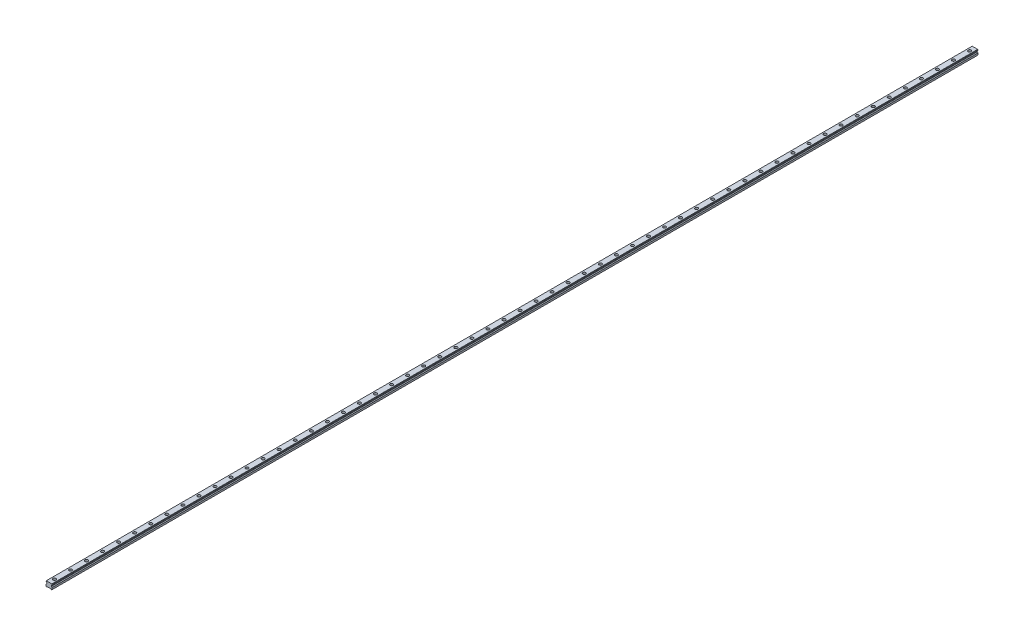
ISO-10303-21;
HEADER;
FILE_DESCRIPTION(('STEP AP214'),'2;1');
FILE_NAME('part.step','',(''),(''),'','','');
FILE_SCHEMA(('AUTOMOTIVE_DESIGN { 1 0 10303 214 1 1 1 1 }'));
ENDSEC;
DATA;
#1=APPLICATION_CONTEXT('core data for automotive mechanical design processes');
#2=APPLICATION_PROTOCOL_DEFINITION('international standard','automotive_design',2000,#1);
#3=PRODUCT_CONTEXT('',#1,'mechanical');
#4=PRODUCT('Part','Part','',(#3));
#5=PRODUCT_RELATED_PRODUCT_CATEGORY('part','',(#4));
#6=PRODUCT_DEFINITION_FORMATION('','',#4);
#7=PRODUCT_DEFINITION_CONTEXT('part definition',#1,'design');
#8=PRODUCT_DEFINITION('design','',#6,#7);
#9=PRODUCT_DEFINITION_SHAPE('','',#8);
#10=(LENGTH_UNIT() NAMED_UNIT(*) SI_UNIT(.MILLI.,.METRE.));
#11=(NAMED_UNIT(*) PLANE_ANGLE_UNIT() SI_UNIT($,.RADIAN.));
#12=(NAMED_UNIT(*) SI_UNIT($,.STERADIAN.) SOLID_ANGLE_UNIT());
#13=UNCERTAINTY_MEASURE_WITH_UNIT(LENGTH_MEASURE(1.E-05),#10,'distance_accuracy_value','');
#14=(GEOMETRIC_REPRESENTATION_CONTEXT(3) GLOBAL_UNCERTAINTY_ASSIGNED_CONTEXT((#13)) GLOBAL_UNIT_ASSIGNED_CONTEXT((#10,
#11,#12)) REPRESENTATION_CONTEXT('',''));
#15=CARTESIAN_POINT('',(0.,0.,0.));
#16=DIRECTION('',(0.,0.,1.));
#17=DIRECTION('',(1.,0.,0.));
#18=AXIS2_PLACEMENT_3D('',#15,#16,#17);
#19=CARTESIAN_POINT('',(0.,10.2,-1710.));
#20=DIRECTION('',(0.,1.,0.));
#21=DIRECTION('',(0.,0.,1.));
#22=AXIS2_PLACEMENT_3D('',#19,#20,#21);
#23=PLANE('',#22);
#24=CARTESIAN_POINT('',(0.,10.2,-1710.));
#25=DIRECTION('',(0.,1.,0.));
#26=DIRECTION('',(0.,0.,1.));
#27=AXIS2_PLACEMENT_3D('',#24,#25,#26);
#28=CIRCLE('',#27,3.49999999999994);
#29=CARTESIAN_POINT('',(0.,10.2,-1706.5));
#30=VERTEX_POINT('',#29);
#31=EDGE_CURVE('E806',#30,#30,#28,.T.);
#32=ORIENTED_EDGE('',*,*,#31,.F.);
#33=EDGE_LOOP('',(#32));
#34=FACE_BOUND('',#33,.T.);
#35=CARTESIAN_POINT('',(0.,10.2,-1710.));
#36=DIRECTION('',(0.,1.,0.));
#37=DIRECTION('',(0.,0.,1.));
#38=AXIS2_PLACEMENT_3D('',#35,#36,#37);
#39=CIRCLE('',#38,5.49999999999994);
#40=CARTESIAN_POINT('',(0.,10.2,-1704.5));
#41=VERTEX_POINT('',#40);
#42=EDGE_CURVE('E11',#41,#41,#39,.T.);
#43=ORIENTED_EDGE('',*,*,#42,.T.);
#44=EDGE_LOOP('',(#43));
#45=FACE_BOUND('',#44,.T.);
#46=ADVANCED_FACE('F39',(#34,#45),#23,.T.);
#47=CARTESIAN_POINT('',(0.,10.2,-1710.));
#48=DIRECTION('',(0.,1.,0.));
#49=DIRECTION('',(0.,0.,1.));
#50=AXIS2_PLACEMENT_3D('',#47,#48,#49);
#51=CYLINDRICAL_SURFACE('',#50,5.49999999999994);
#52=ORIENTED_EDGE('',*,*,#42,.F.);
#53=EDGE_LOOP('',(#52));
#54=FACE_BOUND('',#53,.T.);
#55=CARTESIAN_POINT('',(0.,19.2,-1710.));
#56=DIRECTION('',(0.,1.,0.));
#57=DIRECTION('',(0.,0.,1.));
#58=AXIS2_PLACEMENT_3D('',#55,#56,#57);
#59=CIRCLE('',#58,5.49999999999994);
#60=CARTESIAN_POINT('',(0.,19.2,-1704.5));
#61=VERTEX_POINT('',#60);
#62=EDGE_CURVE('E48',#61,#61,#59,.T.);
#63=ORIENTED_EDGE('',*,*,#62,.T.);
#64=EDGE_LOOP('',(#63));
#65=FACE_BOUND('',#64,.T.);
#66=ADVANCED_FACE('F1584',(#54,#65),#51,.F.);
#67=CARTESIAN_POINT('',(0.,10.2,-1650.));
#68=DIRECTION('',(0.,1.,0.));
#69=DIRECTION('',(0.,0.,1.));
#70=AXIS2_PLACEMENT_3D('',#67,#68,#69);
#71=PLANE('',#70);
#72=CARTESIAN_POINT('',(0.,10.2,-1650.));
#73=DIRECTION('',(0.,1.,0.));
#74=DIRECTION('',(0.,0.,1.));
#75=AXIS2_PLACEMENT_3D('',#72,#73,#74);
#76=CIRCLE('',#75,3.49999999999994);
#77=CARTESIAN_POINT('',(0.,10.2,-1646.5));
#78=VERTEX_POINT('',#77);
#79=EDGE_CURVE('E811',#78,#78,#76,.T.);
#80=ORIENTED_EDGE('',*,*,#79,.F.);
#81=EDGE_LOOP('',(#80));
#82=FACE_BOUND('',#81,.T.);
#83=CARTESIAN_POINT('',(0.,10.2,-1650.));
#84=DIRECTION('',(0.,1.,0.));
#85=DIRECTION('',(0.,0.,1.));
#86=AXIS2_PLACEMENT_3D('',#83,#84,#85);
#87=CIRCLE('',#86,5.49999999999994);
#88=CARTESIAN_POINT('',(0.,10.2,-1644.5));
#89=VERTEX_POINT('',#88);
#90=EDGE_CURVE('E790',#89,#89,#87,.T.);
#91=ORIENTED_EDGE('',*,*,#90,.T.);
#92=EDGE_LOOP('',(#91));
#93=FACE_BOUND('',#92,.T.);
#94=ADVANCED_FACE('F1586',(#82,#93),#71,.T.);
#95=CARTESIAN_POINT('',(0.,10.2,-1650.));
#96=DIRECTION('',(0.,1.,0.));
#97=DIRECTION('',(0.,0.,1.));
#98=AXIS2_PLACEMENT_3D('',#95,#96,#97);
#99=CYLINDRICAL_SURFACE('',#98,5.49999999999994);
#100=ORIENTED_EDGE('',*,*,#90,.F.);
#101=EDGE_LOOP('',(#100));
#102=FACE_BOUND('',#101,.T.);
#103=CARTESIAN_POINT('',(0.,19.2,-1650.));
#104=DIRECTION('',(0.,1.,0.));
#105=DIRECTION('',(0.,0.,1.));
#106=AXIS2_PLACEMENT_3D('',#103,#104,#105);
#107=CIRCLE('',#106,5.49999999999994);
#108=CARTESIAN_POINT('',(0.,19.2,-1644.5));
#109=VERTEX_POINT('',#108);
#110=EDGE_CURVE('E786',#109,#109,#107,.T.);
#111=ORIENTED_EDGE('',*,*,#110,.T.);
#112=EDGE_LOOP('',(#111));
#113=FACE_BOUND('',#112,.T.);
#114=ADVANCED_FACE('F1592',(#102,#113),#99,.F.);
#115=CARTESIAN_POINT('',(0.,10.2,-1590.));
#116=DIRECTION('',(0.,1.,0.));
#117=DIRECTION('',(0.,0.,1.));
#118=AXIS2_PLACEMENT_3D('',#115,#116,#117);
#119=PLANE('',#118);
#120=CARTESIAN_POINT('',(0.,10.2,-1590.));
#121=DIRECTION('',(0.,1.,0.));
#122=DIRECTION('',(0.,0.,1.));
#123=AXIS2_PLACEMENT_3D('',#120,#121,#122);
#124=CIRCLE('',#123,3.49999999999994);
#125=CARTESIAN_POINT('',(0.,10.2,-1586.5));
#126=VERTEX_POINT('',#125);
#127=EDGE_CURVE('E816',#126,#126,#124,.T.);
#128=ORIENTED_EDGE('',*,*,#127,.F.);
#129=EDGE_LOOP('',(#128));
#130=FACE_BOUND('',#129,.T.);
#131=CARTESIAN_POINT('',(0.,10.2,-1590.));
#132=DIRECTION('',(0.,1.,0.));
#133=DIRECTION('',(0.,0.,1.));
#134=AXIS2_PLACEMENT_3D('',#131,#132,#133);
#135=CIRCLE('',#134,5.49999999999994);
#136=CARTESIAN_POINT('',(0.,10.2,-1584.5));
#137=VERTEX_POINT('',#136);
#138=EDGE_CURVE('E782',#137,#137,#135,.T.);
#139=ORIENTED_EDGE('',*,*,#138,.T.);
#140=EDGE_LOOP('',(#139));
#141=FACE_BOUND('',#140,.T.);
#142=ADVANCED_FACE('F1600',(#130,#141),#119,.T.);
#143=CARTESIAN_POINT('',(0.,10.2,-1590.));
#144=DIRECTION('',(0.,1.,0.));
#145=DIRECTION('',(0.,0.,1.));
#146=AXIS2_PLACEMENT_3D('',#143,#144,#145);
#147=CYLINDRICAL_SURFACE('',#146,5.49999999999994);
#148=ORIENTED_EDGE('',*,*,#138,.F.);
#149=EDGE_LOOP('',(#148));
#150=FACE_BOUND('',#149,.T.);
#151=CARTESIAN_POINT('',(0.,19.2,-1590.));
#152=DIRECTION('',(0.,1.,0.));
#153=DIRECTION('',(0.,0.,1.));
#154=AXIS2_PLACEMENT_3D('',#151,#152,#153);
#155=CIRCLE('',#154,5.49999999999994);
#156=CARTESIAN_POINT('',(0.,19.2,-1584.5));
#157=VERTEX_POINT('',#156);
#158=EDGE_CURVE('E778',#157,#157,#155,.T.);
#159=ORIENTED_EDGE('',*,*,#158,.T.);
#160=EDGE_LOOP('',(#159));
#161=FACE_BOUND('',#160,.T.);
#162=ADVANCED_FACE('F1604',(#150,#161),#147,.F.);
#163=CARTESIAN_POINT('',(0.,10.2,-1530.));
#164=DIRECTION('',(0.,1.,0.));
#165=DIRECTION('',(0.,0.,1.));
#166=AXIS2_PLACEMENT_3D('',#163,#164,#165);
#167=PLANE('',#166);
#168=CARTESIAN_POINT('',(0.,10.2,-1530.));
#169=DIRECTION('',(0.,1.,0.));
#170=DIRECTION('',(0.,0.,1.));
#171=AXIS2_PLACEMENT_3D('',#168,#169,#170);
#172=CIRCLE('',#171,3.49999999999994);
#173=CARTESIAN_POINT('',(0.,10.2,-1526.5));
#174=VERTEX_POINT('',#173);
#175=EDGE_CURVE('E821',#174,#174,#172,.T.);
#176=ORIENTED_EDGE('',*,*,#175,.F.);
#177=EDGE_LOOP('',(#176));
#178=FACE_BOUND('',#177,.T.);
#179=CARTESIAN_POINT('',(0.,10.2,-1530.));
#180=DIRECTION('',(0.,1.,0.));
#181=DIRECTION('',(0.,0.,1.));
#182=AXIS2_PLACEMENT_3D('',#179,#180,#181);
#183=CIRCLE('',#182,5.49999999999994);
#184=CARTESIAN_POINT('',(0.,10.2,-1524.5));
#185=VERTEX_POINT('',#184);
#186=EDGE_CURVE('E774',#185,#185,#183,.T.);
#187=ORIENTED_EDGE('',*,*,#186,.T.);
#188=EDGE_LOOP('',(#187));
#189=FACE_BOUND('',#188,.T.);
#190=ADVANCED_FACE('F1608',(#178,#189),#167,.T.);
#191=CARTESIAN_POINT('',(0.,10.2,-1530.));
#192=DIRECTION('',(0.,1.,0.));
#193=DIRECTION('',(0.,0.,1.));
#194=AXIS2_PLACEMENT_3D('',#191,#192,#193);
#195=CYLINDRICAL_SURFACE('',#194,5.49999999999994);
#196=ORIENTED_EDGE('',*,*,#186,.F.);
#197=EDGE_LOOP('',(#196));
#198=FACE_BOUND('',#197,.T.);
#199=CARTESIAN_POINT('',(0.,19.2,-1530.));
#200=DIRECTION('',(0.,1.,0.));
#201=DIRECTION('',(0.,0.,1.));
#202=AXIS2_PLACEMENT_3D('',#199,#200,#201);
#203=CIRCLE('',#202,5.49999999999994);
#204=CARTESIAN_POINT('',(0.,19.2,-1524.5));
#205=VERTEX_POINT('',#204);
#206=EDGE_CURVE('E770',#205,#205,#203,.T.);
#207=ORIENTED_EDGE('',*,*,#206,.T.);
#208=EDGE_LOOP('',(#207));
#209=FACE_BOUND('',#208,.T.);
#210=ADVANCED_FACE('F1612',(#198,#209),#195,.F.);
#211=CARTESIAN_POINT('',(0.,10.2,-1470.));
#212=DIRECTION('',(0.,1.,0.));
#213=DIRECTION('',(0.,0.,1.));
#214=AXIS2_PLACEMENT_3D('',#211,#212,#213);
#215=PLANE('',#214);
#216=CARTESIAN_POINT('',(0.,10.2,-1470.));
#217=DIRECTION('',(0.,1.,0.));
#218=DIRECTION('',(0.,0.,1.));
#219=AXIS2_PLACEMENT_3D('',#216,#217,#218);
#220=CIRCLE('',#219,3.49999999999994);
#221=CARTESIAN_POINT('',(0.,10.2,-1466.5));
#222=VERTEX_POINT('',#221);
#223=EDGE_CURVE('E826',#222,#222,#220,.T.);
#224=ORIENTED_EDGE('',*,*,#223,.F.);
#225=EDGE_LOOP('',(#224));
#226=FACE_BOUND('',#225,.T.);
#227=CARTESIAN_POINT('',(0.,10.2,-1470.));
#228=DIRECTION('',(0.,1.,0.));
#229=DIRECTION('',(0.,0.,1.));
#230=AXIS2_PLACEMENT_3D('',#227,#228,#229);
#231=CIRCLE('',#230,5.49999999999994);
#232=CARTESIAN_POINT('',(0.,10.2,-1464.5));
#233=VERTEX_POINT('',#232);
#234=EDGE_CURVE('E766',#233,#233,#231,.T.);
#235=ORIENTED_EDGE('',*,*,#234,.T.);
#236=EDGE_LOOP('',(#235));
#237=FACE_BOUND('',#236,.T.);
#238=ADVANCED_FACE('F1616',(#226,#237),#215,.T.);
#239=CARTESIAN_POINT('',(0.,10.2,-1470.));
#240=DIRECTION('',(0.,1.,0.));
#241=DIRECTION('',(0.,0.,1.));
#242=AXIS2_PLACEMENT_3D('',#239,#240,#241);
#243=CYLINDRICAL_SURFACE('',#242,5.49999999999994);
#244=ORIENTED_EDGE('',*,*,#234,.F.);
#245=EDGE_LOOP('',(#244));
#246=FACE_BOUND('',#245,.T.);
#247=CARTESIAN_POINT('',(0.,19.2,-1470.));
#248=DIRECTION('',(0.,1.,0.));
#249=DIRECTION('',(0.,0.,1.));
#250=AXIS2_PLACEMENT_3D('',#247,#248,#249);
#251=CIRCLE('',#250,5.49999999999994);
#252=CARTESIAN_POINT('',(0.,19.2,-1464.5));
#253=VERTEX_POINT('',#252);
#254=EDGE_CURVE('E762',#253,#253,#251,.T.);
#255=ORIENTED_EDGE('',*,*,#254,.T.);
#256=EDGE_LOOP('',(#255));
#257=FACE_BOUND('',#256,.T.);
#258=ADVANCED_FACE('F1620',(#246,#257),#243,.F.);
#259=CARTESIAN_POINT('',(0.,10.2,-1410.));
#260=DIRECTION('',(0.,1.,0.));
#261=DIRECTION('',(0.,0.,1.));
#262=AXIS2_PLACEMENT_3D('',#259,#260,#261);
#263=PLANE('',#262);
#264=CARTESIAN_POINT('',(0.,10.2,-1410.));
#265=DIRECTION('',(0.,1.,0.));
#266=DIRECTION('',(0.,0.,1.));
#267=AXIS2_PLACEMENT_3D('',#264,#265,#266);
#268=CIRCLE('',#267,3.49999999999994);
#269=CARTESIAN_POINT('',(0.,10.2,-1406.5));
#270=VERTEX_POINT('',#269);
#271=EDGE_CURVE('E831',#270,#270,#268,.T.);
#272=ORIENTED_EDGE('',*,*,#271,.F.);
#273=EDGE_LOOP('',(#272));
#274=FACE_BOUND('',#273,.T.);
#275=CARTESIAN_POINT('',(0.,10.2,-1410.));
#276=DIRECTION('',(0.,1.,0.));
#277=DIRECTION('',(0.,0.,1.));
#278=AXIS2_PLACEMENT_3D('',#275,#276,#277);
#279=CIRCLE('',#278,5.49999999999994);
#280=CARTESIAN_POINT('',(0.,10.2,-1404.5));
#281=VERTEX_POINT('',#280);
#282=EDGE_CURVE('E758',#281,#281,#279,.T.);
#283=ORIENTED_EDGE('',*,*,#282,.T.);
#284=EDGE_LOOP('',(#283));
#285=FACE_BOUND('',#284,.T.);
#286=ADVANCED_FACE('F1624',(#274,#285),#263,.T.);
#287=CARTESIAN_POINT('',(0.,10.2,-1410.));
#288=DIRECTION('',(0.,1.,0.));
#289=DIRECTION('',(0.,0.,1.));
#290=AXIS2_PLACEMENT_3D('',#287,#288,#289);
#291=CYLINDRICAL_SURFACE('',#290,5.49999999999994);
#292=ORIENTED_EDGE('',*,*,#282,.F.);
#293=EDGE_LOOP('',(#292));
#294=FACE_BOUND('',#293,.T.);
#295=CARTESIAN_POINT('',(0.,19.2,-1410.));
#296=DIRECTION('',(0.,1.,0.));
#297=DIRECTION('',(0.,0.,1.));
#298=AXIS2_PLACEMENT_3D('',#295,#296,#297);
#299=CIRCLE('',#298,5.49999999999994);
#300=CARTESIAN_POINT('',(0.,19.2,-1404.5));
#301=VERTEX_POINT('',#300);
#302=EDGE_CURVE('E754',#301,#301,#299,.T.);
#303=ORIENTED_EDGE('',*,*,#302,.T.);
#304=EDGE_LOOP('',(#303));
#305=FACE_BOUND('',#304,.T.);
#306=ADVANCED_FACE('F1628',(#294,#305),#291,.F.);
#307=CARTESIAN_POINT('',(0.,10.2,-1350.));
#308=DIRECTION('',(0.,1.,0.));
#309=DIRECTION('',(0.,0.,1.));
#310=AXIS2_PLACEMENT_3D('',#307,#308,#309);
#311=PLANE('',#310);
#312=CARTESIAN_POINT('',(0.,10.2,-1350.));
#313=DIRECTION('',(0.,1.,0.));
#314=DIRECTION('',(0.,0.,1.));
#315=AXIS2_PLACEMENT_3D('',#312,#313,#314);
#316=CIRCLE('',#315,3.49999999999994);
#317=CARTESIAN_POINT('',(0.,10.2,-1346.5));
#318=VERTEX_POINT('',#317);
#319=EDGE_CURVE('E836',#318,#318,#316,.T.);
#320=ORIENTED_EDGE('',*,*,#319,.F.);
#321=EDGE_LOOP('',(#320));
#322=FACE_BOUND('',#321,.T.);
#323=CARTESIAN_POINT('',(0.,10.2,-1350.));
#324=DIRECTION('',(0.,1.,0.));
#325=DIRECTION('',(0.,0.,1.));
#326=AXIS2_PLACEMENT_3D('',#323,#324,#325);
#327=CIRCLE('',#326,5.49999999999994);
#328=CARTESIAN_POINT('',(0.,10.2,-1344.5));
#329=VERTEX_POINT('',#328);
#330=EDGE_CURVE('E750',#329,#329,#327,.T.);
#331=ORIENTED_EDGE('',*,*,#330,.T.);
#332=EDGE_LOOP('',(#331));
#333=FACE_BOUND('',#332,.T.);
#334=ADVANCED_FACE('F1632',(#322,#333),#311,.T.);
#335=CARTESIAN_POINT('',(0.,10.2,-1350.));
#336=DIRECTION('',(0.,1.,0.));
#337=DIRECTION('',(0.,0.,1.));
#338=AXIS2_PLACEMENT_3D('',#335,#336,#337);
#339=CYLINDRICAL_SURFACE('',#338,5.49999999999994);
#340=ORIENTED_EDGE('',*,*,#330,.F.);
#341=EDGE_LOOP('',(#340));
#342=FACE_BOUND('',#341,.T.);
#343=CARTESIAN_POINT('',(0.,19.2,-1350.));
#344=DIRECTION('',(0.,1.,0.));
#345=DIRECTION('',(0.,0.,1.));
#346=AXIS2_PLACEMENT_3D('',#343,#344,#345);
#347=CIRCLE('',#346,5.49999999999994);
#348=CARTESIAN_POINT('',(0.,19.2,-1344.5));
#349=VERTEX_POINT('',#348);
#350=EDGE_CURVE('E746',#349,#349,#347,.T.);
#351=ORIENTED_EDGE('',*,*,#350,.T.);
#352=EDGE_LOOP('',(#351));
#353=FACE_BOUND('',#352,.T.);
#354=ADVANCED_FACE('F1636',(#342,#353),#339,.F.);
#355=CARTESIAN_POINT('',(0.,10.2,-1290.));
#356=DIRECTION('',(0.,1.,0.));
#357=DIRECTION('',(0.,0.,1.));
#358=AXIS2_PLACEMENT_3D('',#355,#356,#357);
#359=PLANE('',#358);
#360=CARTESIAN_POINT('',(0.,10.2,-1290.));
#361=DIRECTION('',(0.,1.,0.));
#362=DIRECTION('',(0.,0.,1.));
#363=AXIS2_PLACEMENT_3D('',#360,#361,#362);
#364=CIRCLE('',#363,3.49999999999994);
#365=CARTESIAN_POINT('',(0.,10.2,-1286.5));
#366=VERTEX_POINT('',#365);
#367=EDGE_CURVE('E841',#366,#366,#364,.T.);
#368=ORIENTED_EDGE('',*,*,#367,.F.);
#369=EDGE_LOOP('',(#368));
#370=FACE_BOUND('',#369,.T.);
#371=CARTESIAN_POINT('',(0.,10.2,-1290.));
#372=DIRECTION('',(0.,1.,0.));
#373=DIRECTION('',(0.,0.,1.));
#374=AXIS2_PLACEMENT_3D('',#371,#372,#373);
#375=CIRCLE('',#374,5.49999999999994);
#376=CARTESIAN_POINT('',(0.,10.2,-1284.5));
#377=VERTEX_POINT('',#376);
#378=EDGE_CURVE('E742',#377,#377,#375,.T.);
#379=ORIENTED_EDGE('',*,*,#378,.T.);
#380=EDGE_LOOP('',(#379));
#381=FACE_BOUND('',#380,.T.);
#382=ADVANCED_FACE('F1640',(#370,#381),#359,.T.);
#383=CARTESIAN_POINT('',(0.,10.2,-1290.));
#384=DIRECTION('',(0.,1.,0.));
#385=DIRECTION('',(0.,0.,1.));
#386=AXIS2_PLACEMENT_3D('',#383,#384,#385);
#387=CYLINDRICAL_SURFACE('',#386,5.49999999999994);
#388=ORIENTED_EDGE('',*,*,#378,.F.);
#389=EDGE_LOOP('',(#388));
#390=FACE_BOUND('',#389,.T.);
#391=CARTESIAN_POINT('',(0.,19.2,-1290.));
#392=DIRECTION('',(0.,1.,0.));
#393=DIRECTION('',(0.,0.,1.));
#394=AXIS2_PLACEMENT_3D('',#391,#392,#393);
#395=CIRCLE('',#394,5.49999999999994);
#396=CARTESIAN_POINT('',(0.,19.2,-1284.5));
#397=VERTEX_POINT('',#396);
#398=EDGE_CURVE('E738',#397,#397,#395,.T.);
#399=ORIENTED_EDGE('',*,*,#398,.T.);
#400=EDGE_LOOP('',(#399));
#401=FACE_BOUND('',#400,.T.);
#402=ADVANCED_FACE('F1644',(#390,#401),#387,.F.);
#403=CARTESIAN_POINT('',(0.,10.2,-1230.));
#404=DIRECTION('',(0.,1.,0.));
#405=DIRECTION('',(0.,0.,1.));
#406=AXIS2_PLACEMENT_3D('',#403,#404,#405);
#407=PLANE('',#406);
#408=CARTESIAN_POINT('',(0.,10.2,-1230.));
#409=DIRECTION('',(0.,1.,0.));
#410=DIRECTION('',(0.,0.,1.));
#411=AXIS2_PLACEMENT_3D('',#408,#409,#410);
#412=CIRCLE('',#411,3.49999999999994);
#413=CARTESIAN_POINT('',(0.,10.2,-1226.5));
#414=VERTEX_POINT('',#413);
#415=EDGE_CURVE('E846',#414,#414,#412,.T.);
#416=ORIENTED_EDGE('',*,*,#415,.F.);
#417=EDGE_LOOP('',(#416));
#418=FACE_BOUND('',#417,.T.);
#419=CARTESIAN_POINT('',(0.,10.2,-1230.));
#420=DIRECTION('',(0.,1.,0.));
#421=DIRECTION('',(0.,0.,1.));
#422=AXIS2_PLACEMENT_3D('',#419,#420,#421);
#423=CIRCLE('',#422,5.49999999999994);
#424=CARTESIAN_POINT('',(0.,10.2,-1224.5));
#425=VERTEX_POINT('',#424);
#426=EDGE_CURVE('E734',#425,#425,#423,.T.);
#427=ORIENTED_EDGE('',*,*,#426,.T.);
#428=EDGE_LOOP('',(#427));
#429=FACE_BOUND('',#428,.T.);
#430=ADVANCED_FACE('F1648',(#418,#429),#407,.T.);
#431=CARTESIAN_POINT('',(0.,10.2,-1230.));
#432=DIRECTION('',(0.,1.,0.));
#433=DIRECTION('',(0.,0.,1.));
#434=AXIS2_PLACEMENT_3D('',#431,#432,#433);
#435=CYLINDRICAL_SURFACE('',#434,5.49999999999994);
#436=ORIENTED_EDGE('',*,*,#426,.F.);
#437=EDGE_LOOP('',(#436));
#438=FACE_BOUND('',#437,.T.);
#439=CARTESIAN_POINT('',(0.,19.2,-1230.));
#440=DIRECTION('',(0.,1.,0.));
#441=DIRECTION('',(0.,0.,1.));
#442=AXIS2_PLACEMENT_3D('',#439,#440,#441);
#443=CIRCLE('',#442,5.49999999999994);
#444=CARTESIAN_POINT('',(0.,19.2,-1224.5));
#445=VERTEX_POINT('',#444);
#446=EDGE_CURVE('E730',#445,#445,#443,.T.);
#447=ORIENTED_EDGE('',*,*,#446,.T.);
#448=EDGE_LOOP('',(#447));
#449=FACE_BOUND('',#448,.T.);
#450=ADVANCED_FACE('F1652',(#438,#449),#435,.F.);
#451=CARTESIAN_POINT('',(0.,10.2,-1170.));
#452=DIRECTION('',(0.,1.,0.));
#453=DIRECTION('',(0.,0.,1.));
#454=AXIS2_PLACEMENT_3D('',#451,#452,#453);
#455=PLANE('',#454);
#456=CARTESIAN_POINT('',(0.,10.2,-1170.));
#457=DIRECTION('',(0.,1.,0.));
#458=DIRECTION('',(0.,0.,1.));
#459=AXIS2_PLACEMENT_3D('',#456,#457,#458);
#460=CIRCLE('',#459,3.49999999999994);
#461=CARTESIAN_POINT('',(0.,10.2,-1166.5));
#462=VERTEX_POINT('',#461);
#463=EDGE_CURVE('E851',#462,#462,#460,.T.);
#464=ORIENTED_EDGE('',*,*,#463,.F.);
#465=EDGE_LOOP('',(#464));
#466=FACE_BOUND('',#465,.T.);
#467=CARTESIAN_POINT('',(0.,10.2,-1170.));
#468=DIRECTION('',(0.,1.,0.));
#469=DIRECTION('',(0.,0.,1.));
#470=AXIS2_PLACEMENT_3D('',#467,#468,#469);
#471=CIRCLE('',#470,5.49999999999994);
#472=CARTESIAN_POINT('',(0.,10.2,-1164.5));
#473=VERTEX_POINT('',#472);
#474=EDGE_CURVE('E726',#473,#473,#471,.T.);
#475=ORIENTED_EDGE('',*,*,#474,.T.);
#476=EDGE_LOOP('',(#475));
#477=FACE_BOUND('',#476,.T.);
#478=ADVANCED_FACE('F1656',(#466,#477),#455,.T.);
#479=CARTESIAN_POINT('',(0.,10.2,-1170.));
#480=DIRECTION('',(0.,1.,0.));
#481=DIRECTION('',(0.,0.,1.));
#482=AXIS2_PLACEMENT_3D('',#479,#480,#481);
#483=CYLINDRICAL_SURFACE('',#482,5.49999999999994);
#484=ORIENTED_EDGE('',*,*,#474,.F.);
#485=EDGE_LOOP('',(#484));
#486=FACE_BOUND('',#485,.T.);
#487=CARTESIAN_POINT('',(0.,19.2,-1170.));
#488=DIRECTION('',(0.,1.,0.));
#489=DIRECTION('',(0.,0.,1.));
#490=AXIS2_PLACEMENT_3D('',#487,#488,#489);
#491=CIRCLE('',#490,5.49999999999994);
#492=CARTESIAN_POINT('',(0.,19.2,-1164.5));
#493=VERTEX_POINT('',#492);
#494=EDGE_CURVE('E722',#493,#493,#491,.T.);
#495=ORIENTED_EDGE('',*,*,#494,.T.);
#496=EDGE_LOOP('',(#495));
#497=FACE_BOUND('',#496,.T.);
#498=ADVANCED_FACE('F1660',(#486,#497),#483,.F.);
#499=CARTESIAN_POINT('',(0.,10.2,-1110.));
#500=DIRECTION('',(0.,1.,0.));
#501=DIRECTION('',(0.,0.,1.));
#502=AXIS2_PLACEMENT_3D('',#499,#500,#501);
#503=PLANE('',#502);
#504=CARTESIAN_POINT('',(0.,10.2,-1110.));
#505=DIRECTION('',(0.,1.,0.));
#506=DIRECTION('',(0.,0.,1.));
#507=AXIS2_PLACEMENT_3D('',#504,#505,#506);
#508=CIRCLE('',#507,3.49999999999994);
#509=CARTESIAN_POINT('',(0.,10.2,-1106.5));
#510=VERTEX_POINT('',#509);
#511=EDGE_CURVE('E856',#510,#510,#508,.T.);
#512=ORIENTED_EDGE('',*,*,#511,.F.);
#513=EDGE_LOOP('',(#512));
#514=FACE_BOUND('',#513,.T.);
#515=CARTESIAN_POINT('',(0.,10.2,-1110.));
#516=DIRECTION('',(0.,1.,0.));
#517=DIRECTION('',(0.,0.,1.));
#518=AXIS2_PLACEMENT_3D('',#515,#516,#517);
#519=CIRCLE('',#518,5.49999999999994);
#520=CARTESIAN_POINT('',(0.,10.2,-1104.5));
#521=VERTEX_POINT('',#520);
#522=EDGE_CURVE('E718',#521,#521,#519,.T.);
#523=ORIENTED_EDGE('',*,*,#522,.T.);
#524=EDGE_LOOP('',(#523));
#525=FACE_BOUND('',#524,.T.);
#526=ADVANCED_FACE('F1664',(#514,#525),#503,.T.);
#527=CARTESIAN_POINT('',(0.,10.2,-1110.));
#528=DIRECTION('',(0.,1.,0.));
#529=DIRECTION('',(0.,0.,1.));
#530=AXIS2_PLACEMENT_3D('',#527,#528,#529);
#531=CYLINDRICAL_SURFACE('',#530,5.49999999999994);
#532=ORIENTED_EDGE('',*,*,#522,.F.);
#533=EDGE_LOOP('',(#532));
#534=FACE_BOUND('',#533,.T.);
#535=CARTESIAN_POINT('',(0.,19.2,-1110.));
#536=DIRECTION('',(0.,1.,0.));
#537=DIRECTION('',(0.,0.,1.));
#538=AXIS2_PLACEMENT_3D('',#535,#536,#537);
#539=CIRCLE('',#538,5.49999999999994);
#540=CARTESIAN_POINT('',(0.,19.2,-1104.5));
#541=VERTEX_POINT('',#540);
#542=EDGE_CURVE('E714',#541,#541,#539,.T.);
#543=ORIENTED_EDGE('',*,*,#542,.T.);
#544=EDGE_LOOP('',(#543));
#545=FACE_BOUND('',#544,.T.);
#546=ADVANCED_FACE('F1668',(#534,#545),#531,.F.);
#547=CARTESIAN_POINT('',(0.,10.2,-1050.));
#548=DIRECTION('',(0.,1.,0.));
#549=DIRECTION('',(0.,0.,1.));
#550=AXIS2_PLACEMENT_3D('',#547,#548,#549);
#551=PLANE('',#550);
#552=CARTESIAN_POINT('',(0.,10.2,-1050.));
#553=DIRECTION('',(0.,1.,0.));
#554=DIRECTION('',(0.,0.,1.));
#555=AXIS2_PLACEMENT_3D('',#552,#553,#554);
#556=CIRCLE('',#555,3.49999999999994);
#557=CARTESIAN_POINT('',(0.,10.2,-1046.5));
#558=VERTEX_POINT('',#557);
#559=EDGE_CURVE('E861',#558,#558,#556,.T.);
#560=ORIENTED_EDGE('',*,*,#559,.F.);
#561=EDGE_LOOP('',(#560));
#562=FACE_BOUND('',#561,.T.);
#563=CARTESIAN_POINT('',(0.,10.2,-1050.));
#564=DIRECTION('',(0.,1.,0.));
#565=DIRECTION('',(0.,0.,1.));
#566=AXIS2_PLACEMENT_3D('',#563,#564,#565);
#567=CIRCLE('',#566,5.49999999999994);
#568=CARTESIAN_POINT('',(0.,10.2,-1044.5));
#569=VERTEX_POINT('',#568);
#570=EDGE_CURVE('E710',#569,#569,#567,.T.);
#571=ORIENTED_EDGE('',*,*,#570,.T.);
#572=EDGE_LOOP('',(#571));
#573=FACE_BOUND('',#572,.T.);
#574=ADVANCED_FACE('F1672',(#562,#573),#551,.T.);
#575=CARTESIAN_POINT('',(0.,10.2,-1050.));
#576=DIRECTION('',(0.,1.,0.));
#577=DIRECTION('',(0.,0.,1.));
#578=AXIS2_PLACEMENT_3D('',#575,#576,#577);
#579=CYLINDRICAL_SURFACE('',#578,5.49999999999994);
#580=ORIENTED_EDGE('',*,*,#570,.F.);
#581=EDGE_LOOP('',(#580));
#582=FACE_BOUND('',#581,.T.);
#583=CARTESIAN_POINT('',(0.,19.2,-1050.));
#584=DIRECTION('',(0.,1.,0.));
#585=DIRECTION('',(0.,0.,1.));
#586=AXIS2_PLACEMENT_3D('',#583,#584,#585);
#587=CIRCLE('',#586,5.49999999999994);
#588=CARTESIAN_POINT('',(0.,19.2,-1044.5));
#589=VERTEX_POINT('',#588);
#590=EDGE_CURVE('E706',#589,#589,#587,.T.);
#591=ORIENTED_EDGE('',*,*,#590,.T.);
#592=EDGE_LOOP('',(#591));
#593=FACE_BOUND('',#592,.T.);
#594=ADVANCED_FACE('F1676',(#582,#593),#579,.F.);
#595=CARTESIAN_POINT('',(0.,10.2,-990.));
#596=DIRECTION('',(0.,1.,0.));
#597=DIRECTION('',(0.,0.,1.));
#598=AXIS2_PLACEMENT_3D('',#595,#596,#597);
#599=PLANE('',#598);
#600=CARTESIAN_POINT('',(0.,10.2,-990.));
#601=DIRECTION('',(0.,1.,0.));
#602=DIRECTION('',(0.,0.,1.));
#603=AXIS2_PLACEMENT_3D('',#600,#601,#602);
#604=CIRCLE('',#603,3.49999999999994);
#605=CARTESIAN_POINT('',(0.,10.2,-986.5));
#606=VERTEX_POINT('',#605);
#607=EDGE_CURVE('E866',#606,#606,#604,.T.);
#608=ORIENTED_EDGE('',*,*,#607,.F.);
#609=EDGE_LOOP('',(#608));
#610=FACE_BOUND('',#609,.T.);
#611=CARTESIAN_POINT('',(0.,10.2,-990.));
#612=DIRECTION('',(0.,1.,0.));
#613=DIRECTION('',(0.,0.,1.));
#614=AXIS2_PLACEMENT_3D('',#611,#612,#613);
#615=CIRCLE('',#614,5.49999999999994);
#616=CARTESIAN_POINT('',(0.,10.2,-984.5));
#617=VERTEX_POINT('',#616);
#618=EDGE_CURVE('E702',#617,#617,#615,.T.);
#619=ORIENTED_EDGE('',*,*,#618,.T.);
#620=EDGE_LOOP('',(#619));
#621=FACE_BOUND('',#620,.T.);
#622=ADVANCED_FACE('F1680',(#610,#621),#599,.T.);
#623=CARTESIAN_POINT('',(0.,10.2,-990.));
#624=DIRECTION('',(0.,1.,0.));
#625=DIRECTION('',(0.,0.,1.));
#626=AXIS2_PLACEMENT_3D('',#623,#624,#625);
#627=CYLINDRICAL_SURFACE('',#626,5.49999999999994);
#628=ORIENTED_EDGE('',*,*,#618,.F.);
#629=EDGE_LOOP('',(#628));
#630=FACE_BOUND('',#629,.T.);
#631=CARTESIAN_POINT('',(0.,19.2,-990.));
#632=DIRECTION('',(0.,1.,0.));
#633=DIRECTION('',(0.,0.,1.));
#634=AXIS2_PLACEMENT_3D('',#631,#632,#633);
#635=CIRCLE('',#634,5.49999999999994);
#636=CARTESIAN_POINT('',(0.,19.2,-984.5));
#637=VERTEX_POINT('',#636);
#638=EDGE_CURVE('E698',#637,#637,#635,.T.);
#639=ORIENTED_EDGE('',*,*,#638,.T.);
#640=EDGE_LOOP('',(#639));
#641=FACE_BOUND('',#640,.T.);
#642=ADVANCED_FACE('F1684',(#630,#641),#627,.F.);
#643=CARTESIAN_POINT('',(0.,10.2,-930.));
#644=DIRECTION('',(0.,1.,0.));
#645=DIRECTION('',(0.,0.,1.));
#646=AXIS2_PLACEMENT_3D('',#643,#644,#645);
#647=PLANE('',#646);
#648=CARTESIAN_POINT('',(0.,10.2,-930.));
#649=DIRECTION('',(0.,1.,0.));
#650=DIRECTION('',(0.,0.,1.));
#651=AXIS2_PLACEMENT_3D('',#648,#649,#650);
#652=CIRCLE('',#651,3.49999999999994);
#653=CARTESIAN_POINT('',(0.,10.2,-926.5));
#654=VERTEX_POINT('',#653);
#655=EDGE_CURVE('E871',#654,#654,#652,.T.);
#656=ORIENTED_EDGE('',*,*,#655,.F.);
#657=EDGE_LOOP('',(#656));
#658=FACE_BOUND('',#657,.T.);
#659=CARTESIAN_POINT('',(0.,10.2,-930.));
#660=DIRECTION('',(0.,1.,0.));
#661=DIRECTION('',(0.,0.,1.));
#662=AXIS2_PLACEMENT_3D('',#659,#660,#661);
#663=CIRCLE('',#662,5.49999999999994);
#664=CARTESIAN_POINT('',(0.,10.2,-924.5));
#665=VERTEX_POINT('',#664);
#666=EDGE_CURVE('E694',#665,#665,#663,.T.);
#667=ORIENTED_EDGE('',*,*,#666,.T.);
#668=EDGE_LOOP('',(#667));
#669=FACE_BOUND('',#668,.T.);
#670=ADVANCED_FACE('F1688',(#658,#669),#647,.T.);
#671=CARTESIAN_POINT('',(0.,10.2,-930.));
#672=DIRECTION('',(0.,1.,0.));
#673=DIRECTION('',(0.,0.,1.));
#674=AXIS2_PLACEMENT_3D('',#671,#672,#673);
#675=CYLINDRICAL_SURFACE('',#674,5.49999999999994);
#676=ORIENTED_EDGE('',*,*,#666,.F.);
#677=EDGE_LOOP('',(#676));
#678=FACE_BOUND('',#677,.T.);
#679=CARTESIAN_POINT('',(0.,19.2,-930.));
#680=DIRECTION('',(0.,1.,0.));
#681=DIRECTION('',(0.,0.,1.));
#682=AXIS2_PLACEMENT_3D('',#679,#680,#681);
#683=CIRCLE('',#682,5.49999999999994);
#684=CARTESIAN_POINT('',(0.,19.2,-924.5));
#685=VERTEX_POINT('',#684);
#686=EDGE_CURVE('E690',#685,#685,#683,.T.);
#687=ORIENTED_EDGE('',*,*,#686,.T.);
#688=EDGE_LOOP('',(#687));
#689=FACE_BOUND('',#688,.T.);
#690=ADVANCED_FACE('F1692',(#678,#689),#675,.F.);
#691=CARTESIAN_POINT('',(0.,10.2,-870.));
#692=DIRECTION('',(0.,1.,0.));
#693=DIRECTION('',(0.,0.,1.));
#694=AXIS2_PLACEMENT_3D('',#691,#692,#693);
#695=PLANE('',#694);
#696=CARTESIAN_POINT('',(0.,10.2,-870.));
#697=DIRECTION('',(0.,1.,0.));
#698=DIRECTION('',(0.,0.,1.));
#699=AXIS2_PLACEMENT_3D('',#696,#697,#698);
#700=CIRCLE('',#699,3.49999999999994);
#701=CARTESIAN_POINT('',(0.,10.2,-866.5));
#702=VERTEX_POINT('',#701);
#703=EDGE_CURVE('E876',#702,#702,#700,.T.);
#704=ORIENTED_EDGE('',*,*,#703,.F.);
#705=EDGE_LOOP('',(#704));
#706=FACE_BOUND('',#705,.T.);
#707=CARTESIAN_POINT('',(0.,10.2,-870.));
#708=DIRECTION('',(0.,1.,0.));
#709=DIRECTION('',(0.,0.,1.));
#710=AXIS2_PLACEMENT_3D('',#707,#708,#709);
#711=CIRCLE('',#710,5.49999999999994);
#712=CARTESIAN_POINT('',(0.,10.2,-864.5));
#713=VERTEX_POINT('',#712);
#714=EDGE_CURVE('E686',#713,#713,#711,.T.);
#715=ORIENTED_EDGE('',*,*,#714,.T.);
#716=EDGE_LOOP('',(#715));
#717=FACE_BOUND('',#716,.T.);
#718=ADVANCED_FACE('F1696',(#706,#717),#695,.T.);
#719=CARTESIAN_POINT('',(0.,10.2,-870.));
#720=DIRECTION('',(0.,1.,0.));
#721=DIRECTION('',(0.,0.,1.));
#722=AXIS2_PLACEMENT_3D('',#719,#720,#721);
#723=CYLINDRICAL_SURFACE('',#722,5.49999999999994);
#724=ORIENTED_EDGE('',*,*,#714,.F.);
#725=EDGE_LOOP('',(#724));
#726=FACE_BOUND('',#725,.T.);
#727=CARTESIAN_POINT('',(0.,19.2,-870.));
#728=DIRECTION('',(0.,1.,0.));
#729=DIRECTION('',(0.,0.,1.));
#730=AXIS2_PLACEMENT_3D('',#727,#728,#729);
#731=CIRCLE('',#730,5.49999999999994);
#732=CARTESIAN_POINT('',(0.,19.2,-864.5));
#733=VERTEX_POINT('',#732);
#734=EDGE_CURVE('E682',#733,#733,#731,.T.);
#735=ORIENTED_EDGE('',*,*,#734,.T.);
#736=EDGE_LOOP('',(#735));
#737=FACE_BOUND('',#736,.T.);
#738=ADVANCED_FACE('F1700',(#726,#737),#723,.F.);
#739=CARTESIAN_POINT('',(0.,10.2,-810.));
#740=DIRECTION('',(0.,1.,0.));
#741=DIRECTION('',(0.,0.,1.));
#742=AXIS2_PLACEMENT_3D('',#739,#740,#741);
#743=PLANE('',#742);
#744=CARTESIAN_POINT('',(0.,10.2,-810.));
#745=DIRECTION('',(0.,1.,0.));
#746=DIRECTION('',(0.,0.,1.));
#747=AXIS2_PLACEMENT_3D('',#744,#745,#746);
#748=CIRCLE('',#747,3.49999999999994);
#749=CARTESIAN_POINT('',(0.,10.2,-806.5));
#750=VERTEX_POINT('',#749);
#751=EDGE_CURVE('E881',#750,#750,#748,.T.);
#752=ORIENTED_EDGE('',*,*,#751,.F.);
#753=EDGE_LOOP('',(#752));
#754=FACE_BOUND('',#753,.T.);
#755=CARTESIAN_POINT('',(0.,10.2,-810.));
#756=DIRECTION('',(0.,1.,0.));
#757=DIRECTION('',(0.,0.,1.));
#758=AXIS2_PLACEMENT_3D('',#755,#756,#757);
#759=CIRCLE('',#758,5.49999999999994);
#760=CARTESIAN_POINT('',(0.,10.2,-804.5));
#761=VERTEX_POINT('',#760);
#762=EDGE_CURVE('E678',#761,#761,#759,.T.);
#763=ORIENTED_EDGE('',*,*,#762,.T.);
#764=EDGE_LOOP('',(#763));
#765=FACE_BOUND('',#764,.T.);
#766=ADVANCED_FACE('F1704',(#754,#765),#743,.T.);
#767=CARTESIAN_POINT('',(0.,10.2,-810.));
#768=DIRECTION('',(0.,1.,0.));
#769=DIRECTION('',(0.,0.,1.));
#770=AXIS2_PLACEMENT_3D('',#767,#768,#769);
#771=CYLINDRICAL_SURFACE('',#770,5.49999999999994);
#772=ORIENTED_EDGE('',*,*,#762,.F.);
#773=EDGE_LOOP('',(#772));
#774=FACE_BOUND('',#773,.T.);
#775=CARTESIAN_POINT('',(0.,19.2,-810.));
#776=DIRECTION('',(0.,1.,0.));
#777=DIRECTION('',(0.,0.,1.));
#778=AXIS2_PLACEMENT_3D('',#775,#776,#777);
#779=CIRCLE('',#778,5.49999999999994);
#780=CARTESIAN_POINT('',(0.,19.2,-804.5));
#781=VERTEX_POINT('',#780);
#782=EDGE_CURVE('E674',#781,#781,#779,.T.);
#783=ORIENTED_EDGE('',*,*,#782,.T.);
#784=EDGE_LOOP('',(#783));
#785=FACE_BOUND('',#784,.T.);
#786=ADVANCED_FACE('F1708',(#774,#785),#771,.F.);
#787=CARTESIAN_POINT('',(0.,10.2,-750.));
#788=DIRECTION('',(0.,1.,0.));
#789=DIRECTION('',(0.,0.,1.));
#790=AXIS2_PLACEMENT_3D('',#787,#788,#789);
#791=PLANE('',#790);
#792=CARTESIAN_POINT('',(0.,10.2,-750.));
#793=DIRECTION('',(0.,1.,0.));
#794=DIRECTION('',(0.,0.,1.));
#795=AXIS2_PLACEMENT_3D('',#792,#793,#794);
#796=CIRCLE('',#795,3.49999999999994);
#797=CARTESIAN_POINT('',(0.,10.2,-746.5));
#798=VERTEX_POINT('',#797);
#799=EDGE_CURVE('E886',#798,#798,#796,.T.);
#800=ORIENTED_EDGE('',*,*,#799,.F.);
#801=EDGE_LOOP('',(#800));
#802=FACE_BOUND('',#801,.T.);
#803=CARTESIAN_POINT('',(0.,10.2,-750.));
#804=DIRECTION('',(0.,1.,0.));
#805=DIRECTION('',(0.,0.,1.));
#806=AXIS2_PLACEMENT_3D('',#803,#804,#805);
#807=CIRCLE('',#806,5.49999999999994);
#808=CARTESIAN_POINT('',(0.,10.2,-744.5));
#809=VERTEX_POINT('',#808);
#810=EDGE_CURVE('E670',#809,#809,#807,.T.);
#811=ORIENTED_EDGE('',*,*,#810,.T.);
#812=EDGE_LOOP('',(#811));
#813=FACE_BOUND('',#812,.T.);
#814=ADVANCED_FACE('F1712',(#802,#813),#791,.T.);
#815=CARTESIAN_POINT('',(0.,10.2,-750.));
#816=DIRECTION('',(0.,1.,0.));
#817=DIRECTION('',(0.,0.,1.));
#818=AXIS2_PLACEMENT_3D('',#815,#816,#817);
#819=CYLINDRICAL_SURFACE('',#818,5.49999999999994);
#820=ORIENTED_EDGE('',*,*,#810,.F.);
#821=EDGE_LOOP('',(#820));
#822=FACE_BOUND('',#821,.T.);
#823=CARTESIAN_POINT('',(0.,19.2,-750.));
#824=DIRECTION('',(0.,1.,0.));
#825=DIRECTION('',(0.,0.,1.));
#826=AXIS2_PLACEMENT_3D('',#823,#824,#825);
#827=CIRCLE('',#826,5.49999999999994);
#828=CARTESIAN_POINT('',(0.,19.2,-744.5));
#829=VERTEX_POINT('',#828);
#830=EDGE_CURVE('E666',#829,#829,#827,.T.);
#831=ORIENTED_EDGE('',*,*,#830,.T.);
#832=EDGE_LOOP('',(#831));
#833=FACE_BOUND('',#832,.T.);
#834=ADVANCED_FACE('F1716',(#822,#833),#819,.F.);
#835=CARTESIAN_POINT('',(0.,10.2,-690.));
#836=DIRECTION('',(0.,1.,0.));
#837=DIRECTION('',(0.,0.,1.));
#838=AXIS2_PLACEMENT_3D('',#835,#836,#837);
#839=PLANE('',#838);
#840=CARTESIAN_POINT('',(0.,10.2,-690.));
#841=DIRECTION('',(0.,1.,0.));
#842=DIRECTION('',(0.,0.,1.));
#843=AXIS2_PLACEMENT_3D('',#840,#841,#842);
#844=CIRCLE('',#843,3.49999999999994);
#845=CARTESIAN_POINT('',(0.,10.2,-686.5));
#846=VERTEX_POINT('',#845);
#847=EDGE_CURVE('E891',#846,#846,#844,.T.);
#848=ORIENTED_EDGE('',*,*,#847,.F.);
#849=EDGE_LOOP('',(#848));
#850=FACE_BOUND('',#849,.T.);
#851=CARTESIAN_POINT('',(0.,10.2,-690.));
#852=DIRECTION('',(0.,1.,0.));
#853=DIRECTION('',(0.,0.,1.));
#854=AXIS2_PLACEMENT_3D('',#851,#852,#853);
#855=CIRCLE('',#854,5.49999999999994);
#856=CARTESIAN_POINT('',(0.,10.2,-684.5));
#857=VERTEX_POINT('',#856);
#858=EDGE_CURVE('E662',#857,#857,#855,.T.);
#859=ORIENTED_EDGE('',*,*,#858,.T.);
#860=EDGE_LOOP('',(#859));
#861=FACE_BOUND('',#860,.T.);
#862=ADVANCED_FACE('F1720',(#850,#861),#839,.T.);
#863=CARTESIAN_POINT('',(0.,10.2,-690.));
#864=DIRECTION('',(0.,1.,0.));
#865=DIRECTION('',(0.,0.,1.));
#866=AXIS2_PLACEMENT_3D('',#863,#864,#865);
#867=CYLINDRICAL_SURFACE('',#866,5.49999999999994);
#868=ORIENTED_EDGE('',*,*,#858,.F.);
#869=EDGE_LOOP('',(#868));
#870=FACE_BOUND('',#869,.T.);
#871=CARTESIAN_POINT('',(0.,19.2,-690.));
#872=DIRECTION('',(0.,1.,0.));
#873=DIRECTION('',(0.,0.,1.));
#874=AXIS2_PLACEMENT_3D('',#871,#872,#873);
#875=CIRCLE('',#874,5.49999999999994);
#876=CARTESIAN_POINT('',(0.,19.2,-684.5));
#877=VERTEX_POINT('',#876);
#878=EDGE_CURVE('E658',#877,#877,#875,.T.);
#879=ORIENTED_EDGE('',*,*,#878,.T.);
#880=EDGE_LOOP('',(#879));
#881=FACE_BOUND('',#880,.T.);
#882=ADVANCED_FACE('F1724',(#870,#881),#867,.F.);
#883=CARTESIAN_POINT('',(0.,10.2,-630.));
#884=DIRECTION('',(0.,1.,0.));
#885=DIRECTION('',(0.,0.,1.));
#886=AXIS2_PLACEMENT_3D('',#883,#884,#885);
#887=PLANE('',#886);
#888=CARTESIAN_POINT('',(0.,10.2,-630.));
#889=DIRECTION('',(0.,1.,0.));
#890=DIRECTION('',(0.,0.,1.));
#891=AXIS2_PLACEMENT_3D('',#888,#889,#890);
#892=CIRCLE('',#891,3.49999999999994);
#893=CARTESIAN_POINT('',(0.,10.2,-626.5));
#894=VERTEX_POINT('',#893);
#895=EDGE_CURVE('E896',#894,#894,#892,.T.);
#896=ORIENTED_EDGE('',*,*,#895,.F.);
#897=EDGE_LOOP('',(#896));
#898=FACE_BOUND('',#897,.T.);
#899=CARTESIAN_POINT('',(0.,10.2,-630.));
#900=DIRECTION('',(0.,1.,0.));
#901=DIRECTION('',(0.,0.,1.));
#902=AXIS2_PLACEMENT_3D('',#899,#900,#901);
#903=CIRCLE('',#902,5.49999999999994);
#904=CARTESIAN_POINT('',(0.,10.2,-624.5));
#905=VERTEX_POINT('',#904);
#906=EDGE_CURVE('E654',#905,#905,#903,.T.);
#907=ORIENTED_EDGE('',*,*,#906,.T.);
#908=EDGE_LOOP('',(#907));
#909=FACE_BOUND('',#908,.T.);
#910=ADVANCED_FACE('F1728',(#898,#909),#887,.T.);
#911=CARTESIAN_POINT('',(0.,10.2,-630.));
#912=DIRECTION('',(0.,1.,0.));
#913=DIRECTION('',(0.,0.,1.));
#914=AXIS2_PLACEMENT_3D('',#911,#912,#913);
#915=CYLINDRICAL_SURFACE('',#914,5.49999999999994);
#916=ORIENTED_EDGE('',*,*,#906,.F.);
#917=EDGE_LOOP('',(#916));
#918=FACE_BOUND('',#917,.T.);
#919=CARTESIAN_POINT('',(0.,19.2,-630.));
#920=DIRECTION('',(0.,1.,0.));
#921=DIRECTION('',(0.,0.,1.));
#922=AXIS2_PLACEMENT_3D('',#919,#920,#921);
#923=CIRCLE('',#922,5.49999999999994);
#924=CARTESIAN_POINT('',(0.,19.2,-624.5));
#925=VERTEX_POINT('',#924);
#926=EDGE_CURVE('E650',#925,#925,#923,.T.);
#927=ORIENTED_EDGE('',*,*,#926,.T.);
#928=EDGE_LOOP('',(#927));
#929=FACE_BOUND('',#928,.T.);
#930=ADVANCED_FACE('F1732',(#918,#929),#915,.F.);
#931=CARTESIAN_POINT('',(0.,10.2,-570.));
#932=DIRECTION('',(0.,1.,0.));
#933=DIRECTION('',(0.,0.,1.));
#934=AXIS2_PLACEMENT_3D('',#931,#932,#933);
#935=PLANE('',#934);
#936=CARTESIAN_POINT('',(0.,10.2,-570.));
#937=DIRECTION('',(0.,1.,0.));
#938=DIRECTION('',(0.,0.,1.));
#939=AXIS2_PLACEMENT_3D('',#936,#937,#938);
#940=CIRCLE('',#939,3.49999999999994);
#941=CARTESIAN_POINT('',(0.,10.2,-566.5));
#942=VERTEX_POINT('',#941);
#943=EDGE_CURVE('E901',#942,#942,#940,.T.);
#944=ORIENTED_EDGE('',*,*,#943,.F.);
#945=EDGE_LOOP('',(#944));
#946=FACE_BOUND('',#945,.T.);
#947=CARTESIAN_POINT('',(0.,10.2,-570.));
#948=DIRECTION('',(0.,1.,0.));
#949=DIRECTION('',(0.,0.,1.));
#950=AXIS2_PLACEMENT_3D('',#947,#948,#949);
#951=CIRCLE('',#950,5.49999999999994);
#952=CARTESIAN_POINT('',(0.,10.2,-564.5));
#953=VERTEX_POINT('',#952);
#954=EDGE_CURVE('E646',#953,#953,#951,.T.);
#955=ORIENTED_EDGE('',*,*,#954,.T.);
#956=EDGE_LOOP('',(#955));
#957=FACE_BOUND('',#956,.T.);
#958=ADVANCED_FACE('F1736',(#946,#957),#935,.T.);
#959=CARTESIAN_POINT('',(0.,10.2,-570.));
#960=DIRECTION('',(0.,1.,0.));
#961=DIRECTION('',(0.,0.,1.));
#962=AXIS2_PLACEMENT_3D('',#959,#960,#961);
#963=CYLINDRICAL_SURFACE('',#962,5.49999999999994);
#964=ORIENTED_EDGE('',*,*,#954,.F.);
#965=EDGE_LOOP('',(#964));
#966=FACE_BOUND('',#965,.T.);
#967=CARTESIAN_POINT('',(0.,19.2,-570.));
#968=DIRECTION('',(0.,1.,0.));
#969=DIRECTION('',(0.,0.,1.));
#970=AXIS2_PLACEMENT_3D('',#967,#968,#969);
#971=CIRCLE('',#970,5.49999999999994);
#972=CARTESIAN_POINT('',(0.,19.2,-564.5));
#973=VERTEX_POINT('',#972);
#974=EDGE_CURVE('E642',#973,#973,#971,.T.);
#975=ORIENTED_EDGE('',*,*,#974,.T.);
#976=EDGE_LOOP('',(#975));
#977=FACE_BOUND('',#976,.T.);
#978=ADVANCED_FACE('F1740',(#966,#977),#963,.F.);
#979=CARTESIAN_POINT('',(0.,10.2,-510.));
#980=DIRECTION('',(0.,1.,0.));
#981=DIRECTION('',(0.,0.,1.));
#982=AXIS2_PLACEMENT_3D('',#979,#980,#981);
#983=PLANE('',#982);
#984=CARTESIAN_POINT('',(0.,10.2,-510.));
#985=DIRECTION('',(0.,1.,0.));
#986=DIRECTION('',(0.,0.,1.));
#987=AXIS2_PLACEMENT_3D('',#984,#985,#986);
#988=CIRCLE('',#987,3.49999999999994);
#989=CARTESIAN_POINT('',(0.,10.2,-506.5));
#990=VERTEX_POINT('',#989);
#991=EDGE_CURVE('E906',#990,#990,#988,.T.);
#992=ORIENTED_EDGE('',*,*,#991,.F.);
#993=EDGE_LOOP('',(#992));
#994=FACE_BOUND('',#993,.T.);
#995=CARTESIAN_POINT('',(0.,10.2,-510.));
#996=DIRECTION('',(0.,1.,0.));
#997=DIRECTION('',(0.,0.,1.));
#998=AXIS2_PLACEMENT_3D('',#995,#996,#997);
#999=CIRCLE('',#998,5.49999999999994);
#1000=CARTESIAN_POINT('',(0.,10.2,-504.5));
#1001=VERTEX_POINT('',#1000);
#1002=EDGE_CURVE('E638',#1001,#1001,#999,.T.);
#1003=ORIENTED_EDGE('',*,*,#1002,.T.);
#1004=EDGE_LOOP('',(#1003));
#1005=FACE_BOUND('',#1004,.T.);
#1006=ADVANCED_FACE('F1744',(#994,#1005),#983,.T.);
#1007=CARTESIAN_POINT('',(0.,10.2,-510.));
#1008=DIRECTION('',(0.,1.,0.));
#1009=DIRECTION('',(0.,0.,1.));
#1010=AXIS2_PLACEMENT_3D('',#1007,#1008,#1009);
#1011=CYLINDRICAL_SURFACE('',#1010,5.49999999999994);
#1012=ORIENTED_EDGE('',*,*,#1002,.F.);
#1013=EDGE_LOOP('',(#1012));
#1014=FACE_BOUND('',#1013,.T.);
#1015=CARTESIAN_POINT('',(0.,19.2,-510.));
#1016=DIRECTION('',(0.,1.,0.));
#1017=DIRECTION('',(0.,0.,1.));
#1018=AXIS2_PLACEMENT_3D('',#1015,#1016,#1017);
#1019=CIRCLE('',#1018,5.49999999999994);
#1020=CARTESIAN_POINT('',(0.,19.2,-504.5));
#1021=VERTEX_POINT('',#1020);
#1022=EDGE_CURVE('E634',#1021,#1021,#1019,.T.);
#1023=ORIENTED_EDGE('',*,*,#1022,.T.);
#1024=EDGE_LOOP('',(#1023));
#1025=FACE_BOUND('',#1024,.T.);
#1026=ADVANCED_FACE('F1748',(#1014,#1025),#1011,.F.);
#1027=CARTESIAN_POINT('',(0.,10.2,-450.));
#1028=DIRECTION('',(0.,1.,0.));
#1029=DIRECTION('',(0.,0.,1.));
#1030=AXIS2_PLACEMENT_3D('',#1027,#1028,#1029);
#1031=PLANE('',#1030);
#1032=CARTESIAN_POINT('',(0.,10.2,-450.));
#1033=DIRECTION('',(0.,1.,0.));
#1034=DIRECTION('',(0.,0.,1.));
#1035=AXIS2_PLACEMENT_3D('',#1032,#1033,#1034);
#1036=CIRCLE('',#1035,3.49999999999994);
#1037=CARTESIAN_POINT('',(0.,10.2,-446.5));
#1038=VERTEX_POINT('',#1037);
#1039=EDGE_CURVE('E911',#1038,#1038,#1036,.T.);
#1040=ORIENTED_EDGE('',*,*,#1039,.F.);
#1041=EDGE_LOOP('',(#1040));
#1042=FACE_BOUND('',#1041,.T.);
#1043=CARTESIAN_POINT('',(0.,10.2,-450.));
#1044=DIRECTION('',(0.,1.,0.));
#1045=DIRECTION('',(0.,0.,1.));
#1046=AXIS2_PLACEMENT_3D('',#1043,#1044,#1045);
#1047=CIRCLE('',#1046,5.49999999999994);
#1048=CARTESIAN_POINT('',(0.,10.2,-444.5));
#1049=VERTEX_POINT('',#1048);
#1050=EDGE_CURVE('E630',#1049,#1049,#1047,.T.);
#1051=ORIENTED_EDGE('',*,*,#1050,.T.);
#1052=EDGE_LOOP('',(#1051));
#1053=FACE_BOUND('',#1052,.T.);
#1054=ADVANCED_FACE('F1752',(#1042,#1053),#1031,.T.);
#1055=CARTESIAN_POINT('',(0.,10.2,-450.));
#1056=DIRECTION('',(0.,1.,0.));
#1057=DIRECTION('',(0.,0.,1.));
#1058=AXIS2_PLACEMENT_3D('',#1055,#1056,#1057);
#1059=CYLINDRICAL_SURFACE('',#1058,5.49999999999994);
#1060=ORIENTED_EDGE('',*,*,#1050,.F.);
#1061=EDGE_LOOP('',(#1060));
#1062=FACE_BOUND('',#1061,.T.);
#1063=CARTESIAN_POINT('',(0.,19.2,-450.));
#1064=DIRECTION('',(0.,1.,0.));
#1065=DIRECTION('',(0.,0.,1.));
#1066=AXIS2_PLACEMENT_3D('',#1063,#1064,#1065);
#1067=CIRCLE('',#1066,5.49999999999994);
#1068=CARTESIAN_POINT('',(0.,19.2,-444.5));
#1069=VERTEX_POINT('',#1068);
#1070=EDGE_CURVE('E626',#1069,#1069,#1067,.T.);
#1071=ORIENTED_EDGE('',*,*,#1070,.T.);
#1072=EDGE_LOOP('',(#1071));
#1073=FACE_BOUND('',#1072,.T.);
#1074=ADVANCED_FACE('F1756',(#1062,#1073),#1059,.F.);
#1075=CARTESIAN_POINT('',(0.,10.2,-390.));
#1076=DIRECTION('',(0.,1.,0.));
#1077=DIRECTION('',(0.,0.,1.));
#1078=AXIS2_PLACEMENT_3D('',#1075,#1076,#1077);
#1079=PLANE('',#1078);
#1080=CARTESIAN_POINT('',(0.,10.2,-390.));
#1081=DIRECTION('',(0.,1.,0.));
#1082=DIRECTION('',(0.,0.,1.));
#1083=AXIS2_PLACEMENT_3D('',#1080,#1081,#1082);
#1084=CIRCLE('',#1083,3.49999999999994);
#1085=CARTESIAN_POINT('',(0.,10.2,-386.5));
#1086=VERTEX_POINT('',#1085);
#1087=EDGE_CURVE('E916',#1086,#1086,#1084,.T.);
#1088=ORIENTED_EDGE('',*,*,#1087,.F.);
#1089=EDGE_LOOP('',(#1088));
#1090=FACE_BOUND('',#1089,.T.);
#1091=CARTESIAN_POINT('',(0.,10.2,-390.));
#1092=DIRECTION('',(0.,1.,0.));
#1093=DIRECTION('',(0.,0.,1.));
#1094=AXIS2_PLACEMENT_3D('',#1091,#1092,#1093);
#1095=CIRCLE('',#1094,5.49999999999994);
#1096=CARTESIAN_POINT('',(0.,10.2,-384.5));
#1097=VERTEX_POINT('',#1096);
#1098=EDGE_CURVE('E622',#1097,#1097,#1095,.T.);
#1099=ORIENTED_EDGE('',*,*,#1098,.T.);
#1100=EDGE_LOOP('',(#1099));
#1101=FACE_BOUND('',#1100,.T.);
#1102=ADVANCED_FACE('F1760',(#1090,#1101),#1079,.T.);
#1103=CARTESIAN_POINT('',(0.,10.2,-390.));
#1104=DIRECTION('',(0.,1.,0.));
#1105=DIRECTION('',(0.,0.,1.));
#1106=AXIS2_PLACEMENT_3D('',#1103,#1104,#1105);
#1107=CYLINDRICAL_SURFACE('',#1106,5.49999999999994);
#1108=ORIENTED_EDGE('',*,*,#1098,.F.);
#1109=EDGE_LOOP('',(#1108));
#1110=FACE_BOUND('',#1109,.T.);
#1111=CARTESIAN_POINT('',(0.,19.2,-390.));
#1112=DIRECTION('',(0.,1.,0.));
#1113=DIRECTION('',(0.,0.,1.));
#1114=AXIS2_PLACEMENT_3D('',#1111,#1112,#1113);
#1115=CIRCLE('',#1114,5.49999999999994);
#1116=CARTESIAN_POINT('',(0.,19.2,-384.5));
#1117=VERTEX_POINT('',#1116);
#1118=EDGE_CURVE('E618',#1117,#1117,#1115,.T.);
#1119=ORIENTED_EDGE('',*,*,#1118,.T.);
#1120=EDGE_LOOP('',(#1119));
#1121=FACE_BOUND('',#1120,.T.);
#1122=ADVANCED_FACE('F1764',(#1110,#1121),#1107,.F.);
#1123=CARTESIAN_POINT('',(0.,10.2,-330.));
#1124=DIRECTION('',(0.,1.,0.));
#1125=DIRECTION('',(0.,0.,1.));
#1126=AXIS2_PLACEMENT_3D('',#1123,#1124,#1125);
#1127=PLANE('',#1126);
#1128=CARTESIAN_POINT('',(0.,10.2,-330.));
#1129=DIRECTION('',(0.,1.,0.));
#1130=DIRECTION('',(0.,0.,1.));
#1131=AXIS2_PLACEMENT_3D('',#1128,#1129,#1130);
#1132=CIRCLE('',#1131,3.49999999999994);
#1133=CARTESIAN_POINT('',(0.,10.2,-326.5));
#1134=VERTEX_POINT('',#1133);
#1135=EDGE_CURVE('E921',#1134,#1134,#1132,.T.);
#1136=ORIENTED_EDGE('',*,*,#1135,.F.);
#1137=EDGE_LOOP('',(#1136));
#1138=FACE_BOUND('',#1137,.T.);
#1139=CARTESIAN_POINT('',(0.,10.2,-330.));
#1140=DIRECTION('',(0.,1.,0.));
#1141=DIRECTION('',(0.,0.,1.));
#1142=AXIS2_PLACEMENT_3D('',#1139,#1140,#1141);
#1143=CIRCLE('',#1142,5.49999999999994);
#1144=CARTESIAN_POINT('',(0.,10.2,-324.5));
#1145=VERTEX_POINT('',#1144);
#1146=EDGE_CURVE('E614',#1145,#1145,#1143,.T.);
#1147=ORIENTED_EDGE('',*,*,#1146,.T.);
#1148=EDGE_LOOP('',(#1147));
#1149=FACE_BOUND('',#1148,.T.);
#1150=ADVANCED_FACE('F1768',(#1138,#1149),#1127,.T.);
#1151=CARTESIAN_POINT('',(0.,10.2,-330.));
#1152=DIRECTION('',(0.,1.,0.));
#1153=DIRECTION('',(0.,0.,1.));
#1154=AXIS2_PLACEMENT_3D('',#1151,#1152,#1153);
#1155=CYLINDRICAL_SURFACE('',#1154,5.49999999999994);
#1156=ORIENTED_EDGE('',*,*,#1146,.F.);
#1157=EDGE_LOOP('',(#1156));
#1158=FACE_BOUND('',#1157,.T.);
#1159=CARTESIAN_POINT('',(0.,19.2,-330.));
#1160=DIRECTION('',(0.,1.,0.));
#1161=DIRECTION('',(0.,0.,1.));
#1162=AXIS2_PLACEMENT_3D('',#1159,#1160,#1161);
#1163=CIRCLE('',#1162,5.49999999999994);
#1164=CARTESIAN_POINT('',(0.,19.2,-324.5));
#1165=VERTEX_POINT('',#1164);
#1166=EDGE_CURVE('E610',#1165,#1165,#1163,.T.);
#1167=ORIENTED_EDGE('',*,*,#1166,.T.);
#1168=EDGE_LOOP('',(#1167));
#1169=FACE_BOUND('',#1168,.T.);
#1170=ADVANCED_FACE('F1772',(#1158,#1169),#1155,.F.);
#1171=CARTESIAN_POINT('',(0.,10.2,-270.));
#1172=DIRECTION('',(0.,1.,0.));
#1173=DIRECTION('',(0.,0.,1.));
#1174=AXIS2_PLACEMENT_3D('',#1171,#1172,#1173);
#1175=PLANE('',#1174);
#1176=CARTESIAN_POINT('',(0.,10.2,-270.));
#1177=DIRECTION('',(0.,1.,0.));
#1178=DIRECTION('',(0.,0.,1.));
#1179=AXIS2_PLACEMENT_3D('',#1176,#1177,#1178);
#1180=CIRCLE('',#1179,3.49999999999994);
#1181=CARTESIAN_POINT('',(0.,10.2,-266.5));
#1182=VERTEX_POINT('',#1181);
#1183=EDGE_CURVE('E926',#1182,#1182,#1180,.T.);
#1184=ORIENTED_EDGE('',*,*,#1183,.F.);
#1185=EDGE_LOOP('',(#1184));
#1186=FACE_BOUND('',#1185,.T.);
#1187=CARTESIAN_POINT('',(0.,10.2,-270.));
#1188=DIRECTION('',(0.,1.,0.));
#1189=DIRECTION('',(0.,0.,1.));
#1190=AXIS2_PLACEMENT_3D('',#1187,#1188,#1189);
#1191=CIRCLE('',#1190,5.49999999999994);
#1192=CARTESIAN_POINT('',(0.,10.2,-264.5));
#1193=VERTEX_POINT('',#1192);
#1194=EDGE_CURVE('E606',#1193,#1193,#1191,.T.);
#1195=ORIENTED_EDGE('',*,*,#1194,.T.);
#1196=EDGE_LOOP('',(#1195));
#1197=FACE_BOUND('',#1196,.T.);
#1198=ADVANCED_FACE('F1776',(#1186,#1197),#1175,.T.);
#1199=CARTESIAN_POINT('',(0.,10.2,-270.));
#1200=DIRECTION('',(0.,1.,0.));
#1201=DIRECTION('',(0.,0.,1.));
#1202=AXIS2_PLACEMENT_3D('',#1199,#1200,#1201);
#1203=CYLINDRICAL_SURFACE('',#1202,5.49999999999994);
#1204=ORIENTED_EDGE('',*,*,#1194,.F.);
#1205=EDGE_LOOP('',(#1204));
#1206=FACE_BOUND('',#1205,.T.);
#1207=CARTESIAN_POINT('',(0.,19.2,-270.));
#1208=DIRECTION('',(0.,1.,0.));
#1209=DIRECTION('',(0.,0.,1.));
#1210=AXIS2_PLACEMENT_3D('',#1207,#1208,#1209);
#1211=CIRCLE('',#1210,5.49999999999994);
#1212=CARTESIAN_POINT('',(0.,19.2,-264.5));
#1213=VERTEX_POINT('',#1212);
#1214=EDGE_CURVE('E602',#1213,#1213,#1211,.T.);
#1215=ORIENTED_EDGE('',*,*,#1214,.T.);
#1216=EDGE_LOOP('',(#1215));
#1217=FACE_BOUND('',#1216,.T.);
#1218=ADVANCED_FACE('F1780',(#1206,#1217),#1203,.F.);
#1219=CARTESIAN_POINT('',(0.,10.2,-210.));
#1220=DIRECTION('',(0.,1.,0.));
#1221=DIRECTION('',(0.,0.,1.));
#1222=AXIS2_PLACEMENT_3D('',#1219,#1220,#1221);
#1223=PLANE('',#1222);
#1224=CARTESIAN_POINT('',(0.,10.2,-210.));
#1225=DIRECTION('',(0.,1.,0.));
#1226=DIRECTION('',(0.,0.,1.));
#1227=AXIS2_PLACEMENT_3D('',#1224,#1225,#1226);
#1228=CIRCLE('',#1227,3.49999999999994);
#1229=CARTESIAN_POINT('',(0.,10.2,-206.5));
#1230=VERTEX_POINT('',#1229);
#1231=EDGE_CURVE('E931',#1230,#1230,#1228,.T.);
#1232=ORIENTED_EDGE('',*,*,#1231,.F.);
#1233=EDGE_LOOP('',(#1232));
#1234=FACE_BOUND('',#1233,.T.);
#1235=CARTESIAN_POINT('',(0.,10.2,-210.));
#1236=DIRECTION('',(0.,1.,0.));
#1237=DIRECTION('',(0.,0.,1.));
#1238=AXIS2_PLACEMENT_3D('',#1235,#1236,#1237);
#1239=CIRCLE('',#1238,5.49999999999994);
#1240=CARTESIAN_POINT('',(0.,10.2,-204.5));
#1241=VERTEX_POINT('',#1240);
#1242=EDGE_CURVE('E598',#1241,#1241,#1239,.T.);
#1243=ORIENTED_EDGE('',*,*,#1242,.T.);
#1244=EDGE_LOOP('',(#1243));
#1245=FACE_BOUND('',#1244,.T.);
#1246=ADVANCED_FACE('F1784',(#1234,#1245),#1223,.T.);
#1247=CARTESIAN_POINT('',(0.,10.2,-210.));
#1248=DIRECTION('',(0.,1.,0.));
#1249=DIRECTION('',(0.,0.,1.));
#1250=AXIS2_PLACEMENT_3D('',#1247,#1248,#1249);
#1251=CYLINDRICAL_SURFACE('',#1250,5.49999999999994);
#1252=ORIENTED_EDGE('',*,*,#1242,.F.);
#1253=EDGE_LOOP('',(#1252));
#1254=FACE_BOUND('',#1253,.T.);
#1255=CARTESIAN_POINT('',(0.,19.2,-210.));
#1256=DIRECTION('',(0.,1.,0.));
#1257=DIRECTION('',(0.,0.,1.));
#1258=AXIS2_PLACEMENT_3D('',#1255,#1256,#1257);
#1259=CIRCLE('',#1258,5.49999999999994);
#1260=CARTESIAN_POINT('',(0.,19.2,-204.5));
#1261=VERTEX_POINT('',#1260);
#1262=EDGE_CURVE('E594',#1261,#1261,#1259,.T.);
#1263=ORIENTED_EDGE('',*,*,#1262,.T.);
#1264=EDGE_LOOP('',(#1263));
#1265=FACE_BOUND('',#1264,.T.);
#1266=ADVANCED_FACE('F1788',(#1254,#1265),#1251,.F.);
#1267=CARTESIAN_POINT('',(0.,10.2,-150.));
#1268=DIRECTION('',(0.,1.,0.));
#1269=DIRECTION('',(0.,0.,1.));
#1270=AXIS2_PLACEMENT_3D('',#1267,#1268,#1269);
#1271=PLANE('',#1270);
#1272=CARTESIAN_POINT('',(0.,10.2,-150.));
#1273=DIRECTION('',(0.,1.,0.));
#1274=DIRECTION('',(0.,0.,1.));
#1275=AXIS2_PLACEMENT_3D('',#1272,#1273,#1274);
#1276=CIRCLE('',#1275,3.49999999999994);
#1277=CARTESIAN_POINT('',(0.,10.2,-146.5));
#1278=VERTEX_POINT('',#1277);
#1279=EDGE_CURVE('E936',#1278,#1278,#1276,.T.);
#1280=ORIENTED_EDGE('',*,*,#1279,.F.);
#1281=EDGE_LOOP('',(#1280));
#1282=FACE_BOUND('',#1281,.T.);
#1283=CARTESIAN_POINT('',(0.,10.2,-150.));
#1284=DIRECTION('',(0.,1.,0.));
#1285=DIRECTION('',(0.,0.,1.));
#1286=AXIS2_PLACEMENT_3D('',#1283,#1284,#1285);
#1287=CIRCLE('',#1286,5.49999999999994);
#1288=CARTESIAN_POINT('',(0.,10.2,-144.5));
#1289=VERTEX_POINT('',#1288);
#1290=EDGE_CURVE('E590',#1289,#1289,#1287,.T.);
#1291=ORIENTED_EDGE('',*,*,#1290,.T.);
#1292=EDGE_LOOP('',(#1291));
#1293=FACE_BOUND('',#1292,.T.);
#1294=ADVANCED_FACE('F1792',(#1282,#1293),#1271,.T.);
#1295=CARTESIAN_POINT('',(0.,10.2,-150.));
#1296=DIRECTION('',(0.,1.,0.));
#1297=DIRECTION('',(0.,0.,1.));
#1298=AXIS2_PLACEMENT_3D('',#1295,#1296,#1297);
#1299=CYLINDRICAL_SURFACE('',#1298,5.49999999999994);
#1300=ORIENTED_EDGE('',*,*,#1290,.F.);
#1301=EDGE_LOOP('',(#1300));
#1302=FACE_BOUND('',#1301,.T.);
#1303=CARTESIAN_POINT('',(0.,19.2,-150.));
#1304=DIRECTION('',(0.,1.,0.));
#1305=DIRECTION('',(0.,0.,1.));
#1306=AXIS2_PLACEMENT_3D('',#1303,#1304,#1305);
#1307=CIRCLE('',#1306,5.49999999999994);
#1308=CARTESIAN_POINT('',(0.,19.2,-144.5));
#1309=VERTEX_POINT('',#1308);
#1310=EDGE_CURVE('E586',#1309,#1309,#1307,.T.);
#1311=ORIENTED_EDGE('',*,*,#1310,.T.);
#1312=EDGE_LOOP('',(#1311));
#1313=FACE_BOUND('',#1312,.T.);
#1314=ADVANCED_FACE('F1796',(#1302,#1313),#1299,.F.);
#1315=CARTESIAN_POINT('',(0.,10.2,-89.9999999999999));
#1316=DIRECTION('',(0.,1.,0.));
#1317=DIRECTION('',(0.,0.,1.));
#1318=AXIS2_PLACEMENT_3D('',#1315,#1316,#1317);
#1319=PLANE('',#1318);
#1320=CARTESIAN_POINT('',(0.,10.2,-89.9999999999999));
#1321=DIRECTION('',(0.,1.,0.));
#1322=DIRECTION('',(0.,0.,1.));
#1323=AXIS2_PLACEMENT_3D('',#1320,#1321,#1322);
#1324=CIRCLE('',#1323,3.49999999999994);
#1325=CARTESIAN_POINT('',(0.,10.2,-86.4999999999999));
#1326=VERTEX_POINT('',#1325);
#1327=EDGE_CURVE('E941',#1326,#1326,#1324,.T.);
#1328=ORIENTED_EDGE('',*,*,#1327,.F.);
#1329=EDGE_LOOP('',(#1328));
#1330=FACE_BOUND('',#1329,.T.);
#1331=CARTESIAN_POINT('',(0.,10.2,-89.9999999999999));
#1332=DIRECTION('',(0.,1.,0.));
#1333=DIRECTION('',(0.,0.,1.));
#1334=AXIS2_PLACEMENT_3D('',#1331,#1332,#1333);
#1335=CIRCLE('',#1334,5.49999999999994);
#1336=CARTESIAN_POINT('',(0.,10.2,-84.4999999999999));
#1337=VERTEX_POINT('',#1336);
#1338=EDGE_CURVE('E582',#1337,#1337,#1335,.T.);
#1339=ORIENTED_EDGE('',*,*,#1338,.T.);
#1340=EDGE_LOOP('',(#1339));
#1341=FACE_BOUND('',#1340,.T.);
#1342=ADVANCED_FACE('F1800',(#1330,#1341),#1319,.T.);
#1343=CARTESIAN_POINT('',(0.,10.2,-89.9999999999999));
#1344=DIRECTION('',(0.,1.,0.));
#1345=DIRECTION('',(0.,0.,1.));
#1346=AXIS2_PLACEMENT_3D('',#1343,#1344,#1345);
#1347=CYLINDRICAL_SURFACE('',#1346,5.49999999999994);
#1348=ORIENTED_EDGE('',*,*,#1338,.F.);
#1349=EDGE_LOOP('',(#1348));
#1350=FACE_BOUND('',#1349,.T.);
#1351=CARTESIAN_POINT('',(0.,19.2,-89.9999999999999));
#1352=DIRECTION('',(0.,1.,0.));
#1353=DIRECTION('',(0.,0.,1.));
#1354=AXIS2_PLACEMENT_3D('',#1351,#1352,#1353);
#1355=CIRCLE('',#1354,5.49999999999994);
#1356=CARTESIAN_POINT('',(0.,19.2,-84.4999999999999));
#1357=VERTEX_POINT('',#1356);
#1358=EDGE_CURVE('E578',#1357,#1357,#1355,.T.);
#1359=ORIENTED_EDGE('',*,*,#1358,.T.);
#1360=EDGE_LOOP('',(#1359));
#1361=FACE_BOUND('',#1360,.T.);
#1362=ADVANCED_FACE('F1804',(#1350,#1361),#1347,.F.);
#1363=CARTESIAN_POINT('',(0.,10.2,-30.));
#1364=DIRECTION('',(0.,1.,0.));
#1365=DIRECTION('',(0.,0.,1.));
#1366=AXIS2_PLACEMENT_3D('',#1363,#1364,#1365);
#1367=PLANE('',#1366);
#1368=CARTESIAN_POINT('',(0.,10.2,-30.));
#1369=DIRECTION('',(0.,1.,0.));
#1370=DIRECTION('',(0.,0.,1.));
#1371=AXIS2_PLACEMENT_3D('',#1368,#1369,#1370);
#1372=CIRCLE('',#1371,3.49999999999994);
#1373=CARTESIAN_POINT('',(0.,10.2,-26.5000000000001));
#1374=VERTEX_POINT('',#1373);
#1375=EDGE_CURVE('E946',#1374,#1374,#1372,.T.);
#1376=ORIENTED_EDGE('',*,*,#1375,.F.);
#1377=EDGE_LOOP('',(#1376));
#1378=FACE_BOUND('',#1377,.T.);
#1379=CARTESIAN_POINT('',(0.,10.2,-30.));
#1380=DIRECTION('',(0.,1.,0.));
#1381=DIRECTION('',(0.,0.,1.));
#1382=AXIS2_PLACEMENT_3D('',#1379,#1380,#1381);
#1383=CIRCLE('',#1382,5.49999999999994);
#1384=CARTESIAN_POINT('',(0.,10.2,-24.5000000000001));
#1385=VERTEX_POINT('',#1384);
#1386=EDGE_CURVE('E574',#1385,#1385,#1383,.T.);
#1387=ORIENTED_EDGE('',*,*,#1386,.T.);
#1388=EDGE_LOOP('',(#1387));
#1389=FACE_BOUND('',#1388,.T.);
#1390=ADVANCED_FACE('F1808',(#1378,#1389),#1367,.T.);
#1391=CARTESIAN_POINT('',(0.,10.2,-30.));
#1392=DIRECTION('',(0.,1.,0.));
#1393=DIRECTION('',(0.,0.,1.));
#1394=AXIS2_PLACEMENT_3D('',#1391,#1392,#1393);
#1395=CYLINDRICAL_SURFACE('',#1394,5.49999999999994);
#1396=ORIENTED_EDGE('',*,*,#1386,.F.);
#1397=EDGE_LOOP('',(#1396));
#1398=FACE_BOUND('',#1397,.T.);
#1399=CARTESIAN_POINT('',(0.,19.2,-30.));
#1400=DIRECTION('',(0.,1.,0.));
#1401=DIRECTION('',(0.,0.,1.));
#1402=AXIS2_PLACEMENT_3D('',#1399,#1400,#1401);
#1403=CIRCLE('',#1402,5.49999999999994);
#1404=CARTESIAN_POINT('',(0.,19.2,-24.5000000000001));
#1405=VERTEX_POINT('',#1404);
#1406=EDGE_CURVE('E570',#1405,#1405,#1403,.T.);
#1407=ORIENTED_EDGE('',*,*,#1406,.T.);
#1408=EDGE_LOOP('',(#1407));
#1409=FACE_BOUND('',#1408,.T.);
#1410=ADVANCED_FACE('F1812',(#1398,#1409),#1395,.F.);
#1411=CARTESIAN_POINT('',(0.,10.2,30.));
#1412=DIRECTION('',(0.,1.,0.));
#1413=DIRECTION('',(0.,0.,1.));
#1414=AXIS2_PLACEMENT_3D('',#1411,#1412,#1413);
#1415=PLANE('',#1414);
#1416=CARTESIAN_POINT('',(0.,10.2,30.));
#1417=DIRECTION('',(0.,1.,0.));
#1418=DIRECTION('',(0.,0.,1.));
#1419=AXIS2_PLACEMENT_3D('',#1416,#1417,#1418);
#1420=CIRCLE('',#1419,3.49999999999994);
#1421=CARTESIAN_POINT('',(0.,10.2,33.5));
#1422=VERTEX_POINT('',#1421);
#1423=EDGE_CURVE('E951',#1422,#1422,#1420,.T.);
#1424=ORIENTED_EDGE('',*,*,#1423,.F.);
#1425=EDGE_LOOP('',(#1424));
#1426=FACE_BOUND('',#1425,.T.);
#1427=CARTESIAN_POINT('',(0.,10.2,30.));
#1428=DIRECTION('',(0.,1.,0.));
#1429=DIRECTION('',(0.,0.,1.));
#1430=AXIS2_PLACEMENT_3D('',#1427,#1428,#1429);
#1431=CIRCLE('',#1430,5.49999999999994);
#1432=CARTESIAN_POINT('',(0.,10.2,35.5));
#1433=VERTEX_POINT('',#1432);
#1434=EDGE_CURVE('E566',#1433,#1433,#1431,.T.);
#1435=ORIENTED_EDGE('',*,*,#1434,.T.);
#1436=EDGE_LOOP('',(#1435));
#1437=FACE_BOUND('',#1436,.T.);
#1438=ADVANCED_FACE('F1816',(#1426,#1437),#1415,.T.);
#1439=CARTESIAN_POINT('',(0.,10.2,30.));
#1440=DIRECTION('',(0.,1.,0.));
#1441=DIRECTION('',(0.,0.,1.));
#1442=AXIS2_PLACEMENT_3D('',#1439,#1440,#1441);
#1443=CYLINDRICAL_SURFACE('',#1442,5.49999999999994);
#1444=ORIENTED_EDGE('',*,*,#1434,.F.);
#1445=EDGE_LOOP('',(#1444));
#1446=FACE_BOUND('',#1445,.T.);
#1447=CARTESIAN_POINT('',(0.,19.2,30.));
#1448=DIRECTION('',(0.,1.,0.));
#1449=DIRECTION('',(0.,0.,1.));
#1450=AXIS2_PLACEMENT_3D('',#1447,#1448,#1449);
#1451=CIRCLE('',#1450,5.49999999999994);
#1452=CARTESIAN_POINT('',(0.,19.2,35.5));
#1453=VERTEX_POINT('',#1452);
#1454=EDGE_CURVE('E562',#1453,#1453,#1451,.T.);
#1455=ORIENTED_EDGE('',*,*,#1454,.T.);
#1456=EDGE_LOOP('',(#1455));
#1457=FACE_BOUND('',#1456,.T.);
#1458=ADVANCED_FACE('F1820',(#1446,#1457),#1443,.F.);
#1459=CARTESIAN_POINT('',(0.,10.2,90.0000000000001));
#1460=DIRECTION('',(0.,1.,0.));
#1461=DIRECTION('',(0.,0.,1.));
#1462=AXIS2_PLACEMENT_3D('',#1459,#1460,#1461);
#1463=PLANE('',#1462);
#1464=CARTESIAN_POINT('',(0.,10.2,90.0000000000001));
#1465=DIRECTION('',(0.,1.,0.));
#1466=DIRECTION('',(0.,0.,1.));
#1467=AXIS2_PLACEMENT_3D('',#1464,#1465,#1466);
#1468=CIRCLE('',#1467,3.49999999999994);
#1469=CARTESIAN_POINT('',(0.,10.2,93.5));
#1470=VERTEX_POINT('',#1469);
#1471=EDGE_CURVE('E956',#1470,#1470,#1468,.T.);
#1472=ORIENTED_EDGE('',*,*,#1471,.F.);
#1473=EDGE_LOOP('',(#1472));
#1474=FACE_BOUND('',#1473,.T.);
#1475=CARTESIAN_POINT('',(0.,10.2,90.0000000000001));
#1476=DIRECTION('',(0.,1.,0.));
#1477=DIRECTION('',(0.,0.,1.));
#1478=AXIS2_PLACEMENT_3D('',#1475,#1476,#1477);
#1479=CIRCLE('',#1478,5.49999999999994);
#1480=CARTESIAN_POINT('',(0.,10.2,95.5));
#1481=VERTEX_POINT('',#1480);
#1482=EDGE_CURVE('E558',#1481,#1481,#1479,.T.);
#1483=ORIENTED_EDGE('',*,*,#1482,.T.);
#1484=EDGE_LOOP('',(#1483));
#1485=FACE_BOUND('',#1484,.T.);
#1486=ADVANCED_FACE('F1824',(#1474,#1485),#1463,.T.);
#1487=CARTESIAN_POINT('',(0.,10.2,90.0000000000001));
#1488=DIRECTION('',(0.,1.,0.));
#1489=DIRECTION('',(0.,0.,1.));
#1490=AXIS2_PLACEMENT_3D('',#1487,#1488,#1489);
#1491=CYLINDRICAL_SURFACE('',#1490,5.49999999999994);
#1492=ORIENTED_EDGE('',*,*,#1482,.F.);
#1493=EDGE_LOOP('',(#1492));
#1494=FACE_BOUND('',#1493,.T.);
#1495=CARTESIAN_POINT('',(0.,19.2,90.0000000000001));
#1496=DIRECTION('',(0.,1.,0.));
#1497=DIRECTION('',(0.,0.,1.));
#1498=AXIS2_PLACEMENT_3D('',#1495,#1496,#1497);
#1499=CIRCLE('',#1498,5.49999999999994);
#1500=CARTESIAN_POINT('',(0.,19.2,95.5));
#1501=VERTEX_POINT('',#1500);
#1502=EDGE_CURVE('E554',#1501,#1501,#1499,.T.);
#1503=ORIENTED_EDGE('',*,*,#1502,.T.);
#1504=EDGE_LOOP('',(#1503));
#1505=FACE_BOUND('',#1504,.T.);
#1506=ADVANCED_FACE('F1828',(#1494,#1505),#1491,.F.);
#1507=CARTESIAN_POINT('',(0.,10.2,150.));
#1508=DIRECTION('',(0.,1.,0.));
#1509=DIRECTION('',(0.,0.,1.));
#1510=AXIS2_PLACEMENT_3D('',#1507,#1508,#1509);
#1511=PLANE('',#1510);
#1512=CARTESIAN_POINT('',(0.,10.2,150.));
#1513=DIRECTION('',(0.,1.,0.));
#1514=DIRECTION('',(0.,0.,1.));
#1515=AXIS2_PLACEMENT_3D('',#1512,#1513,#1514);
#1516=CIRCLE('',#1515,3.49999999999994);
#1517=CARTESIAN_POINT('',(0.,10.2,153.5));
#1518=VERTEX_POINT('',#1517);
#1519=EDGE_CURVE('E961',#1518,#1518,#1516,.T.);
#1520=ORIENTED_EDGE('',*,*,#1519,.F.);
#1521=EDGE_LOOP('',(#1520));
#1522=FACE_BOUND('',#1521,.T.);
#1523=CARTESIAN_POINT('',(0.,10.2,150.));
#1524=DIRECTION('',(0.,1.,0.));
#1525=DIRECTION('',(0.,0.,1.));
#1526=AXIS2_PLACEMENT_3D('',#1523,#1524,#1525);
#1527=CIRCLE('',#1526,5.49999999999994);
#1528=CARTESIAN_POINT('',(0.,10.2,155.5));
#1529=VERTEX_POINT('',#1528);
#1530=EDGE_CURVE('E550',#1529,#1529,#1527,.T.);
#1531=ORIENTED_EDGE('',*,*,#1530,.T.);
#1532=EDGE_LOOP('',(#1531));
#1533=FACE_BOUND('',#1532,.T.);
#1534=ADVANCED_FACE('F1832',(#1522,#1533),#1511,.T.);
#1535=CARTESIAN_POINT('',(0.,10.2,150.));
#1536=DIRECTION('',(0.,1.,0.));
#1537=DIRECTION('',(0.,0.,1.));
#1538=AXIS2_PLACEMENT_3D('',#1535,#1536,#1537);
#1539=CYLINDRICAL_SURFACE('',#1538,5.49999999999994);
#1540=ORIENTED_EDGE('',*,*,#1530,.F.);
#1541=EDGE_LOOP('',(#1540));
#1542=FACE_BOUND('',#1541,.T.);
#1543=CARTESIAN_POINT('',(0.,19.2,150.));
#1544=DIRECTION('',(0.,1.,0.));
#1545=DIRECTION('',(0.,0.,1.));
#1546=AXIS2_PLACEMENT_3D('',#1543,#1544,#1545);
#1547=CIRCLE('',#1546,5.49999999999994);
#1548=CARTESIAN_POINT('',(0.,19.2,155.5));
#1549=VERTEX_POINT('',#1548);
#1550=EDGE_CURVE('E546',#1549,#1549,#1547,.T.);
#1551=ORIENTED_EDGE('',*,*,#1550,.T.);
#1552=EDGE_LOOP('',(#1551));
#1553=FACE_BOUND('',#1552,.T.);
#1554=ADVANCED_FACE('F1836',(#1542,#1553),#1539,.F.);
#1555=CARTESIAN_POINT('',(0.,10.2,210.));
#1556=DIRECTION('',(0.,1.,0.));
#1557=DIRECTION('',(0.,0.,1.));
#1558=AXIS2_PLACEMENT_3D('',#1555,#1556,#1557);
#1559=PLANE('',#1558);
#1560=CARTESIAN_POINT('',(0.,10.2,210.));
#1561=DIRECTION('',(0.,1.,0.));
#1562=DIRECTION('',(0.,0.,1.));
#1563=AXIS2_PLACEMENT_3D('',#1560,#1561,#1562);
#1564=CIRCLE('',#1563,3.49999999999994);
#1565=CARTESIAN_POINT('',(0.,10.2,213.5));
#1566=VERTEX_POINT('',#1565);
#1567=EDGE_CURVE('E966',#1566,#1566,#1564,.T.);
#1568=ORIENTED_EDGE('',*,*,#1567,.F.);
#1569=EDGE_LOOP('',(#1568));
#1570=FACE_BOUND('',#1569,.T.);
#1571=CARTESIAN_POINT('',(0.,10.2,210.));
#1572=DIRECTION('',(0.,1.,0.));
#1573=DIRECTION('',(0.,0.,1.));
#1574=AXIS2_PLACEMENT_3D('',#1571,#1572,#1573);
#1575=CIRCLE('',#1574,5.49999999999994);
#1576=CARTESIAN_POINT('',(0.,10.2,215.5));
#1577=VERTEX_POINT('',#1576);
#1578=EDGE_CURVE('E542',#1577,#1577,#1575,.T.);
#1579=ORIENTED_EDGE('',*,*,#1578,.T.);
#1580=EDGE_LOOP('',(#1579));
#1581=FACE_BOUND('',#1580,.T.);
#1582=ADVANCED_FACE('F1840',(#1570,#1581),#1559,.T.);
#1583=CARTESIAN_POINT('',(0.,10.2,210.));
#1584=DIRECTION('',(0.,1.,0.));
#1585=DIRECTION('',(0.,0.,1.));
#1586=AXIS2_PLACEMENT_3D('',#1583,#1584,#1585);
#1587=CYLINDRICAL_SURFACE('',#1586,5.49999999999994);
#1588=ORIENTED_EDGE('',*,*,#1578,.F.);
#1589=EDGE_LOOP('',(#1588));
#1590=FACE_BOUND('',#1589,.T.);
#1591=CARTESIAN_POINT('',(0.,19.2,210.));
#1592=DIRECTION('',(0.,1.,0.));
#1593=DIRECTION('',(0.,0.,1.));
#1594=AXIS2_PLACEMENT_3D('',#1591,#1592,#1593);
#1595=CIRCLE('',#1594,5.49999999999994);
#1596=CARTESIAN_POINT('',(0.,19.2,215.5));
#1597=VERTEX_POINT('',#1596);
#1598=EDGE_CURVE('E538',#1597,#1597,#1595,.T.);
#1599=ORIENTED_EDGE('',*,*,#1598,.T.);
#1600=EDGE_LOOP('',(#1599));
#1601=FACE_BOUND('',#1600,.T.);
#1602=ADVANCED_FACE('F1844',(#1590,#1601),#1587,.F.);
#1603=CARTESIAN_POINT('',(0.,10.2,270.));
#1604=DIRECTION('',(0.,1.,0.));
#1605=DIRECTION('',(0.,0.,1.));
#1606=AXIS2_PLACEMENT_3D('',#1603,#1604,#1605);
#1607=PLANE('',#1606);
#1608=CARTESIAN_POINT('',(0.,10.2,270.));
#1609=DIRECTION('',(0.,1.,0.));
#1610=DIRECTION('',(0.,0.,1.));
#1611=AXIS2_PLACEMENT_3D('',#1608,#1609,#1610);
#1612=CIRCLE('',#1611,3.49999999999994);
#1613=CARTESIAN_POINT('',(0.,10.2,273.5));
#1614=VERTEX_POINT('',#1613);
#1615=EDGE_CURVE('E971',#1614,#1614,#1612,.T.);
#1616=ORIENTED_EDGE('',*,*,#1615,.F.);
#1617=EDGE_LOOP('',(#1616));
#1618=FACE_BOUND('',#1617,.T.);
#1619=CARTESIAN_POINT('',(0.,10.2,270.));
#1620=DIRECTION('',(0.,1.,0.));
#1621=DIRECTION('',(0.,0.,1.));
#1622=AXIS2_PLACEMENT_3D('',#1619,#1620,#1621);
#1623=CIRCLE('',#1622,5.49999999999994);
#1624=CARTESIAN_POINT('',(0.,10.2,275.5));
#1625=VERTEX_POINT('',#1624);
#1626=EDGE_CURVE('E534',#1625,#1625,#1623,.T.);
#1627=ORIENTED_EDGE('',*,*,#1626,.T.);
#1628=EDGE_LOOP('',(#1627));
#1629=FACE_BOUND('',#1628,.T.);
#1630=ADVANCED_FACE('F1848',(#1618,#1629),#1607,.T.);
#1631=CARTESIAN_POINT('',(0.,10.2,270.));
#1632=DIRECTION('',(0.,1.,0.));
#1633=DIRECTION('',(0.,0.,1.));
#1634=AXIS2_PLACEMENT_3D('',#1631,#1632,#1633);
#1635=CYLINDRICAL_SURFACE('',#1634,5.49999999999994);
#1636=ORIENTED_EDGE('',*,*,#1626,.F.);
#1637=EDGE_LOOP('',(#1636));
#1638=FACE_BOUND('',#1637,.T.);
#1639=CARTESIAN_POINT('',(0.,19.2,270.));
#1640=DIRECTION('',(0.,1.,0.));
#1641=DIRECTION('',(0.,0.,1.));
#1642=AXIS2_PLACEMENT_3D('',#1639,#1640,#1641);
#1643=CIRCLE('',#1642,5.49999999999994);
#1644=CARTESIAN_POINT('',(0.,19.2,275.5));
#1645=VERTEX_POINT('',#1644);
#1646=EDGE_CURVE('E530',#1645,#1645,#1643,.T.);
#1647=ORIENTED_EDGE('',*,*,#1646,.T.);
#1648=EDGE_LOOP('',(#1647));
#1649=FACE_BOUND('',#1648,.T.);
#1650=ADVANCED_FACE('F1852',(#1638,#1649),#1635,.F.);
#1651=CARTESIAN_POINT('',(0.,10.2,330.));
#1652=DIRECTION('',(0.,1.,0.));
#1653=DIRECTION('',(0.,0.,1.));
#1654=AXIS2_PLACEMENT_3D('',#1651,#1652,#1653);
#1655=PLANE('',#1654);
#1656=CARTESIAN_POINT('',(0.,10.2,330.));
#1657=DIRECTION('',(0.,1.,0.));
#1658=DIRECTION('',(0.,0.,1.));
#1659=AXIS2_PLACEMENT_3D('',#1656,#1657,#1658);
#1660=CIRCLE('',#1659,3.49999999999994);
#1661=CARTESIAN_POINT('',(0.,10.2,333.5));
#1662=VERTEX_POINT('',#1661);
#1663=EDGE_CURVE('E976',#1662,#1662,#1660,.T.);
#1664=ORIENTED_EDGE('',*,*,#1663,.F.);
#1665=EDGE_LOOP('',(#1664));
#1666=FACE_BOUND('',#1665,.T.);
#1667=CARTESIAN_POINT('',(0.,10.2,330.));
#1668=DIRECTION('',(0.,1.,0.));
#1669=DIRECTION('',(0.,0.,1.));
#1670=AXIS2_PLACEMENT_3D('',#1667,#1668,#1669);
#1671=CIRCLE('',#1670,5.49999999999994);
#1672=CARTESIAN_POINT('',(0.,10.2,335.5));
#1673=VERTEX_POINT('',#1672);
#1674=EDGE_CURVE('E526',#1673,#1673,#1671,.T.);
#1675=ORIENTED_EDGE('',*,*,#1674,.T.);
#1676=EDGE_LOOP('',(#1675));
#1677=FACE_BOUND('',#1676,.T.);
#1678=ADVANCED_FACE('F1856',(#1666,#1677),#1655,.T.);
#1679=CARTESIAN_POINT('',(0.,10.2,330.));
#1680=DIRECTION('',(0.,1.,0.));
#1681=DIRECTION('',(0.,0.,1.));
#1682=AXIS2_PLACEMENT_3D('',#1679,#1680,#1681);
#1683=CYLINDRICAL_SURFACE('',#1682,5.49999999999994);
#1684=ORIENTED_EDGE('',*,*,#1674,.F.);
#1685=EDGE_LOOP('',(#1684));
#1686=FACE_BOUND('',#1685,.T.);
#1687=CARTESIAN_POINT('',(0.,19.2,330.));
#1688=DIRECTION('',(0.,1.,0.));
#1689=DIRECTION('',(0.,0.,1.));
#1690=AXIS2_PLACEMENT_3D('',#1687,#1688,#1689);
#1691=CIRCLE('',#1690,5.49999999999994);
#1692=CARTESIAN_POINT('',(0.,19.2,335.5));
#1693=VERTEX_POINT('',#1692);
#1694=EDGE_CURVE('E522',#1693,#1693,#1691,.T.);
#1695=ORIENTED_EDGE('',*,*,#1694,.T.);
#1696=EDGE_LOOP('',(#1695));
#1697=FACE_BOUND('',#1696,.T.);
#1698=ADVANCED_FACE('F1860',(#1686,#1697),#1683,.F.);
#1699=CARTESIAN_POINT('',(0.,10.2,390.));
#1700=DIRECTION('',(0.,1.,0.));
#1701=DIRECTION('',(0.,0.,1.));
#1702=AXIS2_PLACEMENT_3D('',#1699,#1700,#1701);
#1703=PLANE('',#1702);
#1704=CARTESIAN_POINT('',(0.,10.2,390.));
#1705=DIRECTION('',(0.,1.,0.));
#1706=DIRECTION('',(0.,0.,1.));
#1707=AXIS2_PLACEMENT_3D('',#1704,#1705,#1706);
#1708=CIRCLE('',#1707,3.49999999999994);
#1709=CARTESIAN_POINT('',(0.,10.2,393.5));
#1710=VERTEX_POINT('',#1709);
#1711=EDGE_CURVE('E981',#1710,#1710,#1708,.T.);
#1712=ORIENTED_EDGE('',*,*,#1711,.F.);
#1713=EDGE_LOOP('',(#1712));
#1714=FACE_BOUND('',#1713,.T.);
#1715=CARTESIAN_POINT('',(0.,10.2,390.));
#1716=DIRECTION('',(0.,1.,0.));
#1717=DIRECTION('',(0.,0.,1.));
#1718=AXIS2_PLACEMENT_3D('',#1715,#1716,#1717);
#1719=CIRCLE('',#1718,5.49999999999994);
#1720=CARTESIAN_POINT('',(0.,10.2,395.5));
#1721=VERTEX_POINT('',#1720);
#1722=EDGE_CURVE('E518',#1721,#1721,#1719,.T.);
#1723=ORIENTED_EDGE('',*,*,#1722,.T.);
#1724=EDGE_LOOP('',(#1723));
#1725=FACE_BOUND('',#1724,.T.);
#1726=ADVANCED_FACE('F1864',(#1714,#1725),#1703,.T.);
#1727=CARTESIAN_POINT('',(0.,10.2,390.));
#1728=DIRECTION('',(0.,1.,0.));
#1729=DIRECTION('',(0.,0.,1.));
#1730=AXIS2_PLACEMENT_3D('',#1727,#1728,#1729);
#1731=CYLINDRICAL_SURFACE('',#1730,5.49999999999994);
#1732=ORIENTED_EDGE('',*,*,#1722,.F.);
#1733=EDGE_LOOP('',(#1732));
#1734=FACE_BOUND('',#1733,.T.);
#1735=CARTESIAN_POINT('',(0.,19.2,390.));
#1736=DIRECTION('',(0.,1.,0.));
#1737=DIRECTION('',(0.,0.,1.));
#1738=AXIS2_PLACEMENT_3D('',#1735,#1736,#1737);
#1739=CIRCLE('',#1738,5.49999999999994);
#1740=CARTESIAN_POINT('',(0.,19.2,395.5));
#1741=VERTEX_POINT('',#1740);
#1742=EDGE_CURVE('E514',#1741,#1741,#1739,.T.);
#1743=ORIENTED_EDGE('',*,*,#1742,.T.);
#1744=EDGE_LOOP('',(#1743));
#1745=FACE_BOUND('',#1744,.T.);
#1746=ADVANCED_FACE('F1868',(#1734,#1745),#1731,.F.);
#1747=CARTESIAN_POINT('',(0.,10.2,450.));
#1748=DIRECTION('',(0.,1.,0.));
#1749=DIRECTION('',(0.,0.,1.));
#1750=AXIS2_PLACEMENT_3D('',#1747,#1748,#1749);
#1751=PLANE('',#1750);
#1752=CARTESIAN_POINT('',(0.,10.2,450.));
#1753=DIRECTION('',(0.,1.,0.));
#1754=DIRECTION('',(0.,0.,1.));
#1755=AXIS2_PLACEMENT_3D('',#1752,#1753,#1754);
#1756=CIRCLE('',#1755,3.49999999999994);
#1757=CARTESIAN_POINT('',(0.,10.2,453.5));
#1758=VERTEX_POINT('',#1757);
#1759=EDGE_CURVE('E986',#1758,#1758,#1756,.T.);
#1760=ORIENTED_EDGE('',*,*,#1759,.F.);
#1761=EDGE_LOOP('',(#1760));
#1762=FACE_BOUND('',#1761,.T.);
#1763=CARTESIAN_POINT('',(0.,10.2,450.));
#1764=DIRECTION('',(0.,1.,0.));
#1765=DIRECTION('',(0.,0.,1.));
#1766=AXIS2_PLACEMENT_3D('',#1763,#1764,#1765);
#1767=CIRCLE('',#1766,5.49999999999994);
#1768=CARTESIAN_POINT('',(0.,10.2,455.5));
#1769=VERTEX_POINT('',#1768);
#1770=EDGE_CURVE('E510',#1769,#1769,#1767,.T.);
#1771=ORIENTED_EDGE('',*,*,#1770,.T.);
#1772=EDGE_LOOP('',(#1771));
#1773=FACE_BOUND('',#1772,.T.);
#1774=ADVANCED_FACE('F1872',(#1762,#1773),#1751,.T.);
#1775=CARTESIAN_POINT('',(0.,10.2,450.));
#1776=DIRECTION('',(0.,1.,0.));
#1777=DIRECTION('',(0.,0.,1.));
#1778=AXIS2_PLACEMENT_3D('',#1775,#1776,#1777);
#1779=CYLINDRICAL_SURFACE('',#1778,5.49999999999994);
#1780=ORIENTED_EDGE('',*,*,#1770,.F.);
#1781=EDGE_LOOP('',(#1780));
#1782=FACE_BOUND('',#1781,.T.);
#1783=CARTESIAN_POINT('',(0.,19.2,450.));
#1784=DIRECTION('',(0.,1.,0.));
#1785=DIRECTION('',(0.,0.,1.));
#1786=AXIS2_PLACEMENT_3D('',#1783,#1784,#1785);
#1787=CIRCLE('',#1786,5.49999999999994);
#1788=CARTESIAN_POINT('',(0.,19.2,455.5));
#1789=VERTEX_POINT('',#1788);
#1790=EDGE_CURVE('E506',#1789,#1789,#1787,.T.);
#1791=ORIENTED_EDGE('',*,*,#1790,.T.);
#1792=EDGE_LOOP('',(#1791));
#1793=FACE_BOUND('',#1792,.T.);
#1794=ADVANCED_FACE('F1876',(#1782,#1793),#1779,.F.);
#1795=CARTESIAN_POINT('',(0.,10.2,510.));
#1796=DIRECTION('',(0.,1.,0.));
#1797=DIRECTION('',(0.,0.,1.));
#1798=AXIS2_PLACEMENT_3D('',#1795,#1796,#1797);
#1799=PLANE('',#1798);
#1800=CARTESIAN_POINT('',(0.,10.2,510.));
#1801=DIRECTION('',(0.,1.,0.));
#1802=DIRECTION('',(0.,0.,1.));
#1803=AXIS2_PLACEMENT_3D('',#1800,#1801,#1802);
#1804=CIRCLE('',#1803,3.49999999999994);
#1805=CARTESIAN_POINT('',(0.,10.2,513.5));
#1806=VERTEX_POINT('',#1805);
#1807=EDGE_CURVE('E991',#1806,#1806,#1804,.T.);
#1808=ORIENTED_EDGE('',*,*,#1807,.F.);
#1809=EDGE_LOOP('',(#1808));
#1810=FACE_BOUND('',#1809,.T.);
#1811=CARTESIAN_POINT('',(0.,10.2,510.));
#1812=DIRECTION('',(0.,1.,0.));
#1813=DIRECTION('',(0.,0.,1.));
#1814=AXIS2_PLACEMENT_3D('',#1811,#1812,#1813);
#1815=CIRCLE('',#1814,5.49999999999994);
#1816=CARTESIAN_POINT('',(0.,10.2,515.5));
#1817=VERTEX_POINT('',#1816);
#1818=EDGE_CURVE('E502',#1817,#1817,#1815,.T.);
#1819=ORIENTED_EDGE('',*,*,#1818,.T.);
#1820=EDGE_LOOP('',(#1819));
#1821=FACE_BOUND('',#1820,.T.);
#1822=ADVANCED_FACE('F1880',(#1810,#1821),#1799,.T.);
#1823=CARTESIAN_POINT('',(0.,10.2,510.));
#1824=DIRECTION('',(0.,1.,0.));
#1825=DIRECTION('',(0.,0.,1.));
#1826=AXIS2_PLACEMENT_3D('',#1823,#1824,#1825);
#1827=CYLINDRICAL_SURFACE('',#1826,5.49999999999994);
#1828=ORIENTED_EDGE('',*,*,#1818,.F.);
#1829=EDGE_LOOP('',(#1828));
#1830=FACE_BOUND('',#1829,.T.);
#1831=CARTESIAN_POINT('',(0.,19.2,510.));
#1832=DIRECTION('',(0.,1.,0.));
#1833=DIRECTION('',(0.,0.,1.));
#1834=AXIS2_PLACEMENT_3D('',#1831,#1832,#1833);
#1835=CIRCLE('',#1834,5.49999999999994);
#1836=CARTESIAN_POINT('',(0.,19.2,515.5));
#1837=VERTEX_POINT('',#1836);
#1838=EDGE_CURVE('E498',#1837,#1837,#1835,.T.);
#1839=ORIENTED_EDGE('',*,*,#1838,.T.);
#1840=EDGE_LOOP('',(#1839));
#1841=FACE_BOUND('',#1840,.T.);
#1842=ADVANCED_FACE('F1884',(#1830,#1841),#1827,.F.);
#1843=CARTESIAN_POINT('',(0.,10.2,570.));
#1844=DIRECTION('',(0.,1.,0.));
#1845=DIRECTION('',(0.,0.,1.));
#1846=AXIS2_PLACEMENT_3D('',#1843,#1844,#1845);
#1847=PLANE('',#1846);
#1848=CARTESIAN_POINT('',(0.,10.2,570.));
#1849=DIRECTION('',(0.,1.,0.));
#1850=DIRECTION('',(0.,0.,1.));
#1851=AXIS2_PLACEMENT_3D('',#1848,#1849,#1850);
#1852=CIRCLE('',#1851,3.49999999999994);
#1853=CARTESIAN_POINT('',(0.,10.2,573.5));
#1854=VERTEX_POINT('',#1853);
#1855=EDGE_CURVE('E996',#1854,#1854,#1852,.T.);
#1856=ORIENTED_EDGE('',*,*,#1855,.F.);
#1857=EDGE_LOOP('',(#1856));
#1858=FACE_BOUND('',#1857,.T.);
#1859=CARTESIAN_POINT('',(0.,10.2,570.));
#1860=DIRECTION('',(0.,1.,0.));
#1861=DIRECTION('',(0.,0.,1.));
#1862=AXIS2_PLACEMENT_3D('',#1859,#1860,#1861);
#1863=CIRCLE('',#1862,5.49999999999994);
#1864=CARTESIAN_POINT('',(0.,10.2,575.5));
#1865=VERTEX_POINT('',#1864);
#1866=EDGE_CURVE('E494',#1865,#1865,#1863,.T.);
#1867=ORIENTED_EDGE('',*,*,#1866,.T.);
#1868=EDGE_LOOP('',(#1867));
#1869=FACE_BOUND('',#1868,.T.);
#1870=ADVANCED_FACE('F1888',(#1858,#1869),#1847,.T.);
#1871=CARTESIAN_POINT('',(0.,10.2,570.));
#1872=DIRECTION('',(0.,1.,0.));
#1873=DIRECTION('',(0.,0.,1.));
#1874=AXIS2_PLACEMENT_3D('',#1871,#1872,#1873);
#1875=CYLINDRICAL_SURFACE('',#1874,5.49999999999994);
#1876=ORIENTED_EDGE('',*,*,#1866,.F.);
#1877=EDGE_LOOP('',(#1876));
#1878=FACE_BOUND('',#1877,.T.);
#1879=CARTESIAN_POINT('',(0.,19.2,570.));
#1880=DIRECTION('',(0.,1.,0.));
#1881=DIRECTION('',(0.,0.,1.));
#1882=AXIS2_PLACEMENT_3D('',#1879,#1880,#1881);
#1883=CIRCLE('',#1882,5.49999999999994);
#1884=CARTESIAN_POINT('',(0.,19.2,575.5));
#1885=VERTEX_POINT('',#1884);
#1886=EDGE_CURVE('E490',#1885,#1885,#1883,.T.);
#1887=ORIENTED_EDGE('',*,*,#1886,.T.);
#1888=EDGE_LOOP('',(#1887));
#1889=FACE_BOUND('',#1888,.T.);
#1890=ADVANCED_FACE('F1892',(#1878,#1889),#1875,.F.);
#1891=CARTESIAN_POINT('',(0.,10.2,630.));
#1892=DIRECTION('',(0.,1.,0.));
#1893=DIRECTION('',(0.,0.,1.));
#1894=AXIS2_PLACEMENT_3D('',#1891,#1892,#1893);
#1895=PLANE('',#1894);
#1896=CARTESIAN_POINT('',(0.,10.2,630.));
#1897=DIRECTION('',(0.,1.,0.));
#1898=DIRECTION('',(0.,0.,1.));
#1899=AXIS2_PLACEMENT_3D('',#1896,#1897,#1898);
#1900=CIRCLE('',#1899,3.49999999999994);
#1901=CARTESIAN_POINT('',(0.,10.2,633.5));
#1902=VERTEX_POINT('',#1901);
#1903=EDGE_CURVE('E1001',#1902,#1902,#1900,.T.);
#1904=ORIENTED_EDGE('',*,*,#1903,.F.);
#1905=EDGE_LOOP('',(#1904));
#1906=FACE_BOUND('',#1905,.T.);
#1907=CARTESIAN_POINT('',(0.,10.2,630.));
#1908=DIRECTION('',(0.,1.,0.));
#1909=DIRECTION('',(0.,0.,1.));
#1910=AXIS2_PLACEMENT_3D('',#1907,#1908,#1909);
#1911=CIRCLE('',#1910,5.49999999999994);
#1912=CARTESIAN_POINT('',(0.,10.2,635.5));
#1913=VERTEX_POINT('',#1912);
#1914=EDGE_CURVE('E486',#1913,#1913,#1911,.T.);
#1915=ORIENTED_EDGE('',*,*,#1914,.T.);
#1916=EDGE_LOOP('',(#1915));
#1917=FACE_BOUND('',#1916,.T.);
#1918=ADVANCED_FACE('F1896',(#1906,#1917),#1895,.T.);
#1919=CARTESIAN_POINT('',(0.,10.2,630.));
#1920=DIRECTION('',(0.,1.,0.));
#1921=DIRECTION('',(0.,0.,1.));
#1922=AXIS2_PLACEMENT_3D('',#1919,#1920,#1921);
#1923=CYLINDRICAL_SURFACE('',#1922,5.49999999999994);
#1924=ORIENTED_EDGE('',*,*,#1914,.F.);
#1925=EDGE_LOOP('',(#1924));
#1926=FACE_BOUND('',#1925,.T.);
#1927=CARTESIAN_POINT('',(0.,19.2,630.));
#1928=DIRECTION('',(0.,1.,0.));
#1929=DIRECTION('',(0.,0.,1.));
#1930=AXIS2_PLACEMENT_3D('',#1927,#1928,#1929);
#1931=CIRCLE('',#1930,5.49999999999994);
#1932=CARTESIAN_POINT('',(0.,19.2,635.5));
#1933=VERTEX_POINT('',#1932);
#1934=EDGE_CURVE('E482',#1933,#1933,#1931,.T.);
#1935=ORIENTED_EDGE('',*,*,#1934,.T.);
#1936=EDGE_LOOP('',(#1935));
#1937=FACE_BOUND('',#1936,.T.);
#1938=ADVANCED_FACE('F1900',(#1926,#1937),#1923,.F.);
#1939=CARTESIAN_POINT('',(0.,10.2,690.));
#1940=DIRECTION('',(0.,1.,0.));
#1941=DIRECTION('',(0.,0.,1.));
#1942=AXIS2_PLACEMENT_3D('',#1939,#1940,#1941);
#1943=PLANE('',#1942);
#1944=CARTESIAN_POINT('',(0.,10.2,690.));
#1945=DIRECTION('',(0.,1.,0.));
#1946=DIRECTION('',(0.,0.,1.));
#1947=AXIS2_PLACEMENT_3D('',#1944,#1945,#1946);
#1948=CIRCLE('',#1947,3.49999999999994);
#1949=CARTESIAN_POINT('',(0.,10.2,693.5));
#1950=VERTEX_POINT('',#1949);
#1951=EDGE_CURVE('E1006',#1950,#1950,#1948,.T.);
#1952=ORIENTED_EDGE('',*,*,#1951,.F.);
#1953=EDGE_LOOP('',(#1952));
#1954=FACE_BOUND('',#1953,.T.);
#1955=CARTESIAN_POINT('',(0.,10.2,690.));
#1956=DIRECTION('',(0.,1.,0.));
#1957=DIRECTION('',(0.,0.,1.));
#1958=AXIS2_PLACEMENT_3D('',#1955,#1956,#1957);
#1959=CIRCLE('',#1958,5.49999999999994);
#1960=CARTESIAN_POINT('',(0.,10.2,695.5));
#1961=VERTEX_POINT('',#1960);
#1962=EDGE_CURVE('E478',#1961,#1961,#1959,.T.);
#1963=ORIENTED_EDGE('',*,*,#1962,.T.);
#1964=EDGE_LOOP('',(#1963));
#1965=FACE_BOUND('',#1964,.T.);
#1966=ADVANCED_FACE('F1904',(#1954,#1965),#1943,.T.);
#1967=CARTESIAN_POINT('',(0.,10.2,690.));
#1968=DIRECTION('',(0.,1.,0.));
#1969=DIRECTION('',(0.,0.,1.));
#1970=AXIS2_PLACEMENT_3D('',#1967,#1968,#1969);
#1971=CYLINDRICAL_SURFACE('',#1970,5.49999999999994);
#1972=ORIENTED_EDGE('',*,*,#1962,.F.);
#1973=EDGE_LOOP('',(#1972));
#1974=FACE_BOUND('',#1973,.T.);
#1975=CARTESIAN_POINT('',(0.,19.2,690.));
#1976=DIRECTION('',(0.,1.,0.));
#1977=DIRECTION('',(0.,0.,1.));
#1978=AXIS2_PLACEMENT_3D('',#1975,#1976,#1977);
#1979=CIRCLE('',#1978,5.49999999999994);
#1980=CARTESIAN_POINT('',(0.,19.2,695.5));
#1981=VERTEX_POINT('',#1980);
#1982=EDGE_CURVE('E474',#1981,#1981,#1979,.T.);
#1983=ORIENTED_EDGE('',*,*,#1982,.T.);
#1984=EDGE_LOOP('',(#1983));
#1985=FACE_BOUND('',#1984,.T.);
#1986=ADVANCED_FACE('F1908',(#1974,#1985),#1971,.F.);
#1987=CARTESIAN_POINT('',(0.,10.2,750.));
#1988=DIRECTION('',(0.,1.,0.));
#1989=DIRECTION('',(0.,0.,1.));
#1990=AXIS2_PLACEMENT_3D('',#1987,#1988,#1989);
#1991=PLANE('',#1990);
#1992=CARTESIAN_POINT('',(0.,10.2,750.));
#1993=DIRECTION('',(0.,1.,0.));
#1994=DIRECTION('',(0.,0.,1.));
#1995=AXIS2_PLACEMENT_3D('',#1992,#1993,#1994);
#1996=CIRCLE('',#1995,3.49999999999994);
#1997=CARTESIAN_POINT('',(0.,10.2,753.5));
#1998=VERTEX_POINT('',#1997);
#1999=EDGE_CURVE('E1011',#1998,#1998,#1996,.T.);
#2000=ORIENTED_EDGE('',*,*,#1999,.F.);
#2001=EDGE_LOOP('',(#2000));
#2002=FACE_BOUND('',#2001,.T.);
#2003=CARTESIAN_POINT('',(0.,10.2,750.));
#2004=DIRECTION('',(0.,1.,0.));
#2005=DIRECTION('',(0.,0.,1.));
#2006=AXIS2_PLACEMENT_3D('',#2003,#2004,#2005);
#2007=CIRCLE('',#2006,5.49999999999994);
#2008=CARTESIAN_POINT('',(0.,10.2,755.5));
#2009=VERTEX_POINT('',#2008);
#2010=EDGE_CURVE('E470',#2009,#2009,#2007,.T.);
#2011=ORIENTED_EDGE('',*,*,#2010,.T.);
#2012=EDGE_LOOP('',(#2011));
#2013=FACE_BOUND('',#2012,.T.);
#2014=ADVANCED_FACE('F1912',(#2002,#2013),#1991,.T.);
#2015=CARTESIAN_POINT('',(0.,10.2,750.));
#2016=DIRECTION('',(0.,1.,0.));
#2017=DIRECTION('',(0.,0.,1.));
#2018=AXIS2_PLACEMENT_3D('',#2015,#2016,#2017);
#2019=CYLINDRICAL_SURFACE('',#2018,5.49999999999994);
#2020=ORIENTED_EDGE('',*,*,#2010,.F.);
#2021=EDGE_LOOP('',(#2020));
#2022=FACE_BOUND('',#2021,.T.);
#2023=CARTESIAN_POINT('',(0.,19.2,750.));
#2024=DIRECTION('',(0.,1.,0.));
#2025=DIRECTION('',(0.,0.,1.));
#2026=AXIS2_PLACEMENT_3D('',#2023,#2024,#2025);
#2027=CIRCLE('',#2026,5.49999999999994);
#2028=CARTESIAN_POINT('',(0.,19.2,755.5));
#2029=VERTEX_POINT('',#2028);
#2030=EDGE_CURVE('E466',#2029,#2029,#2027,.T.);
#2031=ORIENTED_EDGE('',*,*,#2030,.T.);
#2032=EDGE_LOOP('',(#2031));
#2033=FACE_BOUND('',#2032,.T.);
#2034=ADVANCED_FACE('F1916',(#2022,#2033),#2019,.F.);
#2035=CARTESIAN_POINT('',(0.,10.2,810.));
#2036=DIRECTION('',(0.,1.,0.));
#2037=DIRECTION('',(0.,0.,1.));
#2038=AXIS2_PLACEMENT_3D('',#2035,#2036,#2037);
#2039=PLANE('',#2038);
#2040=CARTESIAN_POINT('',(0.,10.2,810.));
#2041=DIRECTION('',(0.,1.,0.));
#2042=DIRECTION('',(0.,0.,1.));
#2043=AXIS2_PLACEMENT_3D('',#2040,#2041,#2042);
#2044=CIRCLE('',#2043,3.49999999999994);
#2045=CARTESIAN_POINT('',(0.,10.2,813.5));
#2046=VERTEX_POINT('',#2045);
#2047=EDGE_CURVE('E1016',#2046,#2046,#2044,.T.);
#2048=ORIENTED_EDGE('',*,*,#2047,.F.);
#2049=EDGE_LOOP('',(#2048));
#2050=FACE_BOUND('',#2049,.T.);
#2051=CARTESIAN_POINT('',(0.,10.2,810.));
#2052=DIRECTION('',(0.,1.,0.));
#2053=DIRECTION('',(0.,0.,1.));
#2054=AXIS2_PLACEMENT_3D('',#2051,#2052,#2053);
#2055=CIRCLE('',#2054,5.49999999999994);
#2056=CARTESIAN_POINT('',(0.,10.2,815.5));
#2057=VERTEX_POINT('',#2056);
#2058=EDGE_CURVE('E462',#2057,#2057,#2055,.T.);
#2059=ORIENTED_EDGE('',*,*,#2058,.T.);
#2060=EDGE_LOOP('',(#2059));
#2061=FACE_BOUND('',#2060,.T.);
#2062=ADVANCED_FACE('F1920',(#2050,#2061),#2039,.T.);
#2063=CARTESIAN_POINT('',(0.,10.2,810.));
#2064=DIRECTION('',(0.,1.,0.));
#2065=DIRECTION('',(0.,0.,1.));
#2066=AXIS2_PLACEMENT_3D('',#2063,#2064,#2065);
#2067=CYLINDRICAL_SURFACE('',#2066,5.49999999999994);
#2068=ORIENTED_EDGE('',*,*,#2058,.F.);
#2069=EDGE_LOOP('',(#2068));
#2070=FACE_BOUND('',#2069,.T.);
#2071=CARTESIAN_POINT('',(0.,19.2,810.));
#2072=DIRECTION('',(0.,1.,0.));
#2073=DIRECTION('',(0.,0.,1.));
#2074=AXIS2_PLACEMENT_3D('',#2071,#2072,#2073);
#2075=CIRCLE('',#2074,5.49999999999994);
#2076=CARTESIAN_POINT('',(0.,19.2,815.5));
#2077=VERTEX_POINT('',#2076);
#2078=EDGE_CURVE('E458',#2077,#2077,#2075,.T.);
#2079=ORIENTED_EDGE('',*,*,#2078,.T.);
#2080=EDGE_LOOP('',(#2079));
#2081=FACE_BOUND('',#2080,.T.);
#2082=ADVANCED_FACE('F1924',(#2070,#2081),#2067,.F.);
#2083=CARTESIAN_POINT('',(0.,10.2,870.));
#2084=DIRECTION('',(0.,1.,0.));
#2085=DIRECTION('',(0.,0.,1.));
#2086=AXIS2_PLACEMENT_3D('',#2083,#2084,#2085);
#2087=PLANE('',#2086);
#2088=CARTESIAN_POINT('',(0.,10.2,870.));
#2089=DIRECTION('',(0.,1.,0.));
#2090=DIRECTION('',(0.,0.,1.));
#2091=AXIS2_PLACEMENT_3D('',#2088,#2089,#2090);
#2092=CIRCLE('',#2091,3.49999999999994);
#2093=CARTESIAN_POINT('',(0.,10.2,873.5));
#2094=VERTEX_POINT('',#2093);
#2095=EDGE_CURVE('E1021',#2094,#2094,#2092,.T.);
#2096=ORIENTED_EDGE('',*,*,#2095,.F.);
#2097=EDGE_LOOP('',(#2096));
#2098=FACE_BOUND('',#2097,.T.);
#2099=CARTESIAN_POINT('',(0.,10.2,870.));
#2100=DIRECTION('',(0.,1.,0.));
#2101=DIRECTION('',(0.,0.,1.));
#2102=AXIS2_PLACEMENT_3D('',#2099,#2100,#2101);
#2103=CIRCLE('',#2102,5.49999999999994);
#2104=CARTESIAN_POINT('',(0.,10.2,875.5));
#2105=VERTEX_POINT('',#2104);
#2106=EDGE_CURVE('E454',#2105,#2105,#2103,.T.);
#2107=ORIENTED_EDGE('',*,*,#2106,.T.);
#2108=EDGE_LOOP('',(#2107));
#2109=FACE_BOUND('',#2108,.T.);
#2110=ADVANCED_FACE('F1928',(#2098,#2109),#2087,.T.);
#2111=CARTESIAN_POINT('',(0.,10.2,870.));
#2112=DIRECTION('',(0.,1.,0.));
#2113=DIRECTION('',(0.,0.,1.));
#2114=AXIS2_PLACEMENT_3D('',#2111,#2112,#2113);
#2115=CYLINDRICAL_SURFACE('',#2114,5.49999999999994);
#2116=ORIENTED_EDGE('',*,*,#2106,.F.);
#2117=EDGE_LOOP('',(#2116));
#2118=FACE_BOUND('',#2117,.T.);
#2119=CARTESIAN_POINT('',(0.,19.2,870.));
#2120=DIRECTION('',(0.,1.,0.));
#2121=DIRECTION('',(0.,0.,1.));
#2122=AXIS2_PLACEMENT_3D('',#2119,#2120,#2121);
#2123=CIRCLE('',#2122,5.49999999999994);
#2124=CARTESIAN_POINT('',(0.,19.2,875.5));
#2125=VERTEX_POINT('',#2124);
#2126=EDGE_CURVE('E450',#2125,#2125,#2123,.T.);
#2127=ORIENTED_EDGE('',*,*,#2126,.T.);
#2128=EDGE_LOOP('',(#2127));
#2129=FACE_BOUND('',#2128,.T.);
#2130=ADVANCED_FACE('F1932',(#2118,#2129),#2115,.F.);
#2131=CARTESIAN_POINT('',(0.,10.2,930.));
#2132=DIRECTION('',(0.,1.,0.));
#2133=DIRECTION('',(0.,0.,1.));
#2134=AXIS2_PLACEMENT_3D('',#2131,#2132,#2133);
#2135=PLANE('',#2134);
#2136=CARTESIAN_POINT('',(0.,10.2,930.));
#2137=DIRECTION('',(0.,1.,0.));
#2138=DIRECTION('',(0.,0.,1.));
#2139=AXIS2_PLACEMENT_3D('',#2136,#2137,#2138);
#2140=CIRCLE('',#2139,3.49999999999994);
#2141=CARTESIAN_POINT('',(0.,10.2,933.5));
#2142=VERTEX_POINT('',#2141);
#2143=EDGE_CURVE('E1026',#2142,#2142,#2140,.T.);
#2144=ORIENTED_EDGE('',*,*,#2143,.F.);
#2145=EDGE_LOOP('',(#2144));
#2146=FACE_BOUND('',#2145,.T.);
#2147=CARTESIAN_POINT('',(0.,10.2,930.));
#2148=DIRECTION('',(0.,1.,0.));
#2149=DIRECTION('',(0.,0.,1.));
#2150=AXIS2_PLACEMENT_3D('',#2147,#2148,#2149);
#2151=CIRCLE('',#2150,5.49999999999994);
#2152=CARTESIAN_POINT('',(0.,10.2,935.5));
#2153=VERTEX_POINT('',#2152);
#2154=EDGE_CURVE('E446',#2153,#2153,#2151,.T.);
#2155=ORIENTED_EDGE('',*,*,#2154,.T.);
#2156=EDGE_LOOP('',(#2155));
#2157=FACE_BOUND('',#2156,.T.);
#2158=ADVANCED_FACE('F1936',(#2146,#2157),#2135,.T.);
#2159=CARTESIAN_POINT('',(0.,10.2,930.));
#2160=DIRECTION('',(0.,1.,0.));
#2161=DIRECTION('',(0.,0.,1.));
#2162=AXIS2_PLACEMENT_3D('',#2159,#2160,#2161);
#2163=CYLINDRICAL_SURFACE('',#2162,5.49999999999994);
#2164=ORIENTED_EDGE('',*,*,#2154,.F.);
#2165=EDGE_LOOP('',(#2164));
#2166=FACE_BOUND('',#2165,.T.);
#2167=CARTESIAN_POINT('',(0.,19.2,930.));
#2168=DIRECTION('',(0.,1.,0.));
#2169=DIRECTION('',(0.,0.,1.));
#2170=AXIS2_PLACEMENT_3D('',#2167,#2168,#2169);
#2171=CIRCLE('',#2170,5.49999999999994);
#2172=CARTESIAN_POINT('',(0.,19.2,935.5));
#2173=VERTEX_POINT('',#2172);
#2174=EDGE_CURVE('E442',#2173,#2173,#2171,.T.);
#2175=ORIENTED_EDGE('',*,*,#2174,.T.);
#2176=EDGE_LOOP('',(#2175));
#2177=FACE_BOUND('',#2176,.T.);
#2178=ADVANCED_FACE('F1940',(#2166,#2177),#2163,.F.);
#2179=CARTESIAN_POINT('',(0.,10.2,990.));
#2180=DIRECTION('',(0.,1.,0.));
#2181=DIRECTION('',(0.,0.,1.));
#2182=AXIS2_PLACEMENT_3D('',#2179,#2180,#2181);
#2183=PLANE('',#2182);
#2184=CARTESIAN_POINT('',(0.,10.2,990.));
#2185=DIRECTION('',(0.,1.,0.));
#2186=DIRECTION('',(0.,0.,1.));
#2187=AXIS2_PLACEMENT_3D('',#2184,#2185,#2186);
#2188=CIRCLE('',#2187,3.49999999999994);
#2189=CARTESIAN_POINT('',(0.,10.2,993.5));
#2190=VERTEX_POINT('',#2189);
#2191=EDGE_CURVE('E1031',#2190,#2190,#2188,.T.);
#2192=ORIENTED_EDGE('',*,*,#2191,.F.);
#2193=EDGE_LOOP('',(#2192));
#2194=FACE_BOUND('',#2193,.T.);
#2195=CARTESIAN_POINT('',(0.,10.2,990.));
#2196=DIRECTION('',(0.,1.,0.));
#2197=DIRECTION('',(0.,0.,1.));
#2198=AXIS2_PLACEMENT_3D('',#2195,#2196,#2197);
#2199=CIRCLE('',#2198,5.49999999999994);
#2200=CARTESIAN_POINT('',(0.,10.2,995.5));
#2201=VERTEX_POINT('',#2200);
#2202=EDGE_CURVE('E438',#2201,#2201,#2199,.T.);
#2203=ORIENTED_EDGE('',*,*,#2202,.T.);
#2204=EDGE_LOOP('',(#2203));
#2205=FACE_BOUND('',#2204,.T.);
#2206=ADVANCED_FACE('F1944',(#2194,#2205),#2183,.T.);
#2207=CARTESIAN_POINT('',(0.,10.2,990.));
#2208=DIRECTION('',(0.,1.,0.));
#2209=DIRECTION('',(0.,0.,1.));
#2210=AXIS2_PLACEMENT_3D('',#2207,#2208,#2209);
#2211=CYLINDRICAL_SURFACE('',#2210,5.49999999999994);
#2212=ORIENTED_EDGE('',*,*,#2202,.F.);
#2213=EDGE_LOOP('',(#2212));
#2214=FACE_BOUND('',#2213,.T.);
#2215=CARTESIAN_POINT('',(0.,19.2,990.));
#2216=DIRECTION('',(0.,1.,0.));
#2217=DIRECTION('',(0.,0.,1.));
#2218=AXIS2_PLACEMENT_3D('',#2215,#2216,#2217);
#2219=CIRCLE('',#2218,5.49999999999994);
#2220=CARTESIAN_POINT('',(0.,19.2,995.5));
#2221=VERTEX_POINT('',#2220);
#2222=EDGE_CURVE('E434',#2221,#2221,#2219,.T.);
#2223=ORIENTED_EDGE('',*,*,#2222,.T.);
#2224=EDGE_LOOP('',(#2223));
#2225=FACE_BOUND('',#2224,.T.);
#2226=ADVANCED_FACE('F1948',(#2214,#2225),#2211,.F.);
#2227=CARTESIAN_POINT('',(0.,10.2,1050.));
#2228=DIRECTION('',(0.,1.,0.));
#2229=DIRECTION('',(0.,0.,1.));
#2230=AXIS2_PLACEMENT_3D('',#2227,#2228,#2229);
#2231=PLANE('',#2230);
#2232=CARTESIAN_POINT('',(0.,10.2,1050.));
#2233=DIRECTION('',(0.,1.,0.));
#2234=DIRECTION('',(0.,0.,1.));
#2235=AXIS2_PLACEMENT_3D('',#2232,#2233,#2234);
#2236=CIRCLE('',#2235,3.49999999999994);
#2237=CARTESIAN_POINT('',(0.,10.2,1053.5));
#2238=VERTEX_POINT('',#2237);
#2239=EDGE_CURVE('E1036',#2238,#2238,#2236,.T.);
#2240=ORIENTED_EDGE('',*,*,#2239,.F.);
#2241=EDGE_LOOP('',(#2240));
#2242=FACE_BOUND('',#2241,.T.);
#2243=CARTESIAN_POINT('',(0.,10.2,1050.));
#2244=DIRECTION('',(0.,1.,0.));
#2245=DIRECTION('',(0.,0.,1.));
#2246=AXIS2_PLACEMENT_3D('',#2243,#2244,#2245);
#2247=CIRCLE('',#2246,5.49999999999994);
#2248=CARTESIAN_POINT('',(0.,10.2,1055.5));
#2249=VERTEX_POINT('',#2248);
#2250=EDGE_CURVE('E430',#2249,#2249,#2247,.T.);
#2251=ORIENTED_EDGE('',*,*,#2250,.T.);
#2252=EDGE_LOOP('',(#2251));
#2253=FACE_BOUND('',#2252,.T.);
#2254=ADVANCED_FACE('F1952',(#2242,#2253),#2231,.T.);
#2255=CARTESIAN_POINT('',(0.,10.2,1050.));
#2256=DIRECTION('',(0.,1.,0.));
#2257=DIRECTION('',(0.,0.,1.));
#2258=AXIS2_PLACEMENT_3D('',#2255,#2256,#2257);
#2259=CYLINDRICAL_SURFACE('',#2258,5.49999999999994);
#2260=ORIENTED_EDGE('',*,*,#2250,.F.);
#2261=EDGE_LOOP('',(#2260));
#2262=FACE_BOUND('',#2261,.T.);
#2263=CARTESIAN_POINT('',(0.,19.2,1050.));
#2264=DIRECTION('',(0.,1.,0.));
#2265=DIRECTION('',(0.,0.,1.));
#2266=AXIS2_PLACEMENT_3D('',#2263,#2264,#2265);
#2267=CIRCLE('',#2266,5.49999999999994);
#2268=CARTESIAN_POINT('',(0.,19.2,1055.5));
#2269=VERTEX_POINT('',#2268);
#2270=EDGE_CURVE('E426',#2269,#2269,#2267,.T.);
#2271=ORIENTED_EDGE('',*,*,#2270,.T.);
#2272=EDGE_LOOP('',(#2271));
#2273=FACE_BOUND('',#2272,.T.);
#2274=ADVANCED_FACE('F1956',(#2262,#2273),#2259,.F.);
#2275=CARTESIAN_POINT('',(0.,10.2,1110.));
#2276=DIRECTION('',(0.,1.,0.));
#2277=DIRECTION('',(0.,0.,1.));
#2278=AXIS2_PLACEMENT_3D('',#2275,#2276,#2277);
#2279=PLANE('',#2278);
#2280=CARTESIAN_POINT('',(0.,10.2,1110.));
#2281=DIRECTION('',(0.,1.,0.));
#2282=DIRECTION('',(0.,0.,1.));
#2283=AXIS2_PLACEMENT_3D('',#2280,#2281,#2282);
#2284=CIRCLE('',#2283,3.49999999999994);
#2285=CARTESIAN_POINT('',(0.,10.2,1113.5));
#2286=VERTEX_POINT('',#2285);
#2287=EDGE_CURVE('E1041',#2286,#2286,#2284,.T.);
#2288=ORIENTED_EDGE('',*,*,#2287,.F.);
#2289=EDGE_LOOP('',(#2288));
#2290=FACE_BOUND('',#2289,.T.);
#2291=CARTESIAN_POINT('',(0.,10.2,1110.));
#2292=DIRECTION('',(0.,1.,0.));
#2293=DIRECTION('',(0.,0.,1.));
#2294=AXIS2_PLACEMENT_3D('',#2291,#2292,#2293);
#2295=CIRCLE('',#2294,5.49999999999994);
#2296=CARTESIAN_POINT('',(0.,10.2,1115.5));
#2297=VERTEX_POINT('',#2296);
#2298=EDGE_CURVE('E422',#2297,#2297,#2295,.T.);
#2299=ORIENTED_EDGE('',*,*,#2298,.T.);
#2300=EDGE_LOOP('',(#2299));
#2301=FACE_BOUND('',#2300,.T.);
#2302=ADVANCED_FACE('F1960',(#2290,#2301),#2279,.T.);
#2303=CARTESIAN_POINT('',(0.,10.2,1110.));
#2304=DIRECTION('',(0.,1.,0.));
#2305=DIRECTION('',(0.,0.,1.));
#2306=AXIS2_PLACEMENT_3D('',#2303,#2304,#2305);
#2307=CYLINDRICAL_SURFACE('',#2306,5.49999999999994);
#2308=ORIENTED_EDGE('',*,*,#2298,.F.);
#2309=EDGE_LOOP('',(#2308));
#2310=FACE_BOUND('',#2309,.T.);
#2311=CARTESIAN_POINT('',(0.,19.2,1110.));
#2312=DIRECTION('',(0.,1.,0.));
#2313=DIRECTION('',(0.,0.,1.));
#2314=AXIS2_PLACEMENT_3D('',#2311,#2312,#2313);
#2315=CIRCLE('',#2314,5.49999999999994);
#2316=CARTESIAN_POINT('',(0.,19.2,1115.5));
#2317=VERTEX_POINT('',#2316);
#2318=EDGE_CURVE('E418',#2317,#2317,#2315,.T.);
#2319=ORIENTED_EDGE('',*,*,#2318,.T.);
#2320=EDGE_LOOP('',(#2319));
#2321=FACE_BOUND('',#2320,.T.);
#2322=ADVANCED_FACE('F1964',(#2310,#2321),#2307,.F.);
#2323=CARTESIAN_POINT('',(0.,10.2,1170.));
#2324=DIRECTION('',(0.,1.,0.));
#2325=DIRECTION('',(0.,0.,1.));
#2326=AXIS2_PLACEMENT_3D('',#2323,#2324,#2325);
#2327=PLANE('',#2326);
#2328=CARTESIAN_POINT('',(0.,10.2,1170.));
#2329=DIRECTION('',(0.,1.,0.));
#2330=DIRECTION('',(0.,0.,1.));
#2331=AXIS2_PLACEMENT_3D('',#2328,#2329,#2330);
#2332=CIRCLE('',#2331,3.49999999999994);
#2333=CARTESIAN_POINT('',(0.,10.2,1173.5));
#2334=VERTEX_POINT('',#2333);
#2335=EDGE_CURVE('E1046',#2334,#2334,#2332,.T.);
#2336=ORIENTED_EDGE('',*,*,#2335,.F.);
#2337=EDGE_LOOP('',(#2336));
#2338=FACE_BOUND('',#2337,.T.);
#2339=CARTESIAN_POINT('',(0.,10.2,1170.));
#2340=DIRECTION('',(0.,1.,0.));
#2341=DIRECTION('',(0.,0.,1.));
#2342=AXIS2_PLACEMENT_3D('',#2339,#2340,#2341);
#2343=CIRCLE('',#2342,5.49999999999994);
#2344=CARTESIAN_POINT('',(0.,10.2,1175.5));
#2345=VERTEX_POINT('',#2344);
#2346=EDGE_CURVE('E414',#2345,#2345,#2343,.T.);
#2347=ORIENTED_EDGE('',*,*,#2346,.T.);
#2348=EDGE_LOOP('',(#2347));
#2349=FACE_BOUND('',#2348,.T.);
#2350=ADVANCED_FACE('F1968',(#2338,#2349),#2327,.T.);
#2351=CARTESIAN_POINT('',(0.,10.2,1170.));
#2352=DIRECTION('',(0.,1.,0.));
#2353=DIRECTION('',(0.,0.,1.));
#2354=AXIS2_PLACEMENT_3D('',#2351,#2352,#2353);
#2355=CYLINDRICAL_SURFACE('',#2354,5.49999999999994);
#2356=ORIENTED_EDGE('',*,*,#2346,.F.);
#2357=EDGE_LOOP('',(#2356));
#2358=FACE_BOUND('',#2357,.T.);
#2359=CARTESIAN_POINT('',(0.,19.2,1170.));
#2360=DIRECTION('',(0.,1.,0.));
#2361=DIRECTION('',(0.,0.,1.));
#2362=AXIS2_PLACEMENT_3D('',#2359,#2360,#2361);
#2363=CIRCLE('',#2362,5.49999999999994);
#2364=CARTESIAN_POINT('',(0.,19.2,1175.5));
#2365=VERTEX_POINT('',#2364);
#2366=EDGE_CURVE('E410',#2365,#2365,#2363,.T.);
#2367=ORIENTED_EDGE('',*,*,#2366,.T.);
#2368=EDGE_LOOP('',(#2367));
#2369=FACE_BOUND('',#2368,.T.);
#2370=ADVANCED_FACE('F1972',(#2358,#2369),#2355,.F.);
#2371=CARTESIAN_POINT('',(0.,10.2,1230.));
#2372=DIRECTION('',(0.,1.,0.));
#2373=DIRECTION('',(0.,0.,1.));
#2374=AXIS2_PLACEMENT_3D('',#2371,#2372,#2373);
#2375=PLANE('',#2374);
#2376=CARTESIAN_POINT('',(0.,10.2,1230.));
#2377=DIRECTION('',(0.,1.,0.));
#2378=DIRECTION('',(0.,0.,1.));
#2379=AXIS2_PLACEMENT_3D('',#2376,#2377,#2378);
#2380=CIRCLE('',#2379,3.49999999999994);
#2381=CARTESIAN_POINT('',(0.,10.2,1233.5));
#2382=VERTEX_POINT('',#2381);
#2383=EDGE_CURVE('E1051',#2382,#2382,#2380,.T.);
#2384=ORIENTED_EDGE('',*,*,#2383,.F.);
#2385=EDGE_LOOP('',(#2384));
#2386=FACE_BOUND('',#2385,.T.);
#2387=CARTESIAN_POINT('',(0.,10.2,1230.));
#2388=DIRECTION('',(0.,1.,0.));
#2389=DIRECTION('',(0.,0.,1.));
#2390=AXIS2_PLACEMENT_3D('',#2387,#2388,#2389);
#2391=CIRCLE('',#2390,5.49999999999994);
#2392=CARTESIAN_POINT('',(0.,10.2,1235.5));
#2393=VERTEX_POINT('',#2392);
#2394=EDGE_CURVE('E406',#2393,#2393,#2391,.T.);
#2395=ORIENTED_EDGE('',*,*,#2394,.T.);
#2396=EDGE_LOOP('',(#2395));
#2397=FACE_BOUND('',#2396,.T.);
#2398=ADVANCED_FACE('F1976',(#2386,#2397),#2375,.T.);
#2399=CARTESIAN_POINT('',(0.,10.2,1230.));
#2400=DIRECTION('',(0.,1.,0.));
#2401=DIRECTION('',(0.,0.,1.));
#2402=AXIS2_PLACEMENT_3D('',#2399,#2400,#2401);
#2403=CYLINDRICAL_SURFACE('',#2402,5.49999999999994);
#2404=ORIENTED_EDGE('',*,*,#2394,.F.);
#2405=EDGE_LOOP('',(#2404));
#2406=FACE_BOUND('',#2405,.T.);
#2407=CARTESIAN_POINT('',(0.,19.2,1230.));
#2408=DIRECTION('',(0.,1.,0.));
#2409=DIRECTION('',(0.,0.,1.));
#2410=AXIS2_PLACEMENT_3D('',#2407,#2408,#2409);
#2411=CIRCLE('',#2410,5.49999999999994);
#2412=CARTESIAN_POINT('',(0.,19.2,1235.5));
#2413=VERTEX_POINT('',#2412);
#2414=EDGE_CURVE('E402',#2413,#2413,#2411,.T.);
#2415=ORIENTED_EDGE('',*,*,#2414,.T.);
#2416=EDGE_LOOP('',(#2415));
#2417=FACE_BOUND('',#2416,.T.);
#2418=ADVANCED_FACE('F1980',(#2406,#2417),#2403,.F.);
#2419=CARTESIAN_POINT('',(0.,10.2,1290.));
#2420=DIRECTION('',(0.,1.,0.));
#2421=DIRECTION('',(0.,0.,1.));
#2422=AXIS2_PLACEMENT_3D('',#2419,#2420,#2421);
#2423=PLANE('',#2422);
#2424=CARTESIAN_POINT('',(0.,10.2,1290.));
#2425=DIRECTION('',(0.,1.,0.));
#2426=DIRECTION('',(0.,0.,1.));
#2427=AXIS2_PLACEMENT_3D('',#2424,#2425,#2426);
#2428=CIRCLE('',#2427,3.49999999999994);
#2429=CARTESIAN_POINT('',(0.,10.2,1293.5));
#2430=VERTEX_POINT('',#2429);
#2431=EDGE_CURVE('E1056',#2430,#2430,#2428,.T.);
#2432=ORIENTED_EDGE('',*,*,#2431,.F.);
#2433=EDGE_LOOP('',(#2432));
#2434=FACE_BOUND('',#2433,.T.);
#2435=CARTESIAN_POINT('',(0.,10.2,1290.));
#2436=DIRECTION('',(0.,1.,0.));
#2437=DIRECTION('',(0.,0.,1.));
#2438=AXIS2_PLACEMENT_3D('',#2435,#2436,#2437);
#2439=CIRCLE('',#2438,5.49999999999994);
#2440=CARTESIAN_POINT('',(0.,10.2,1295.5));
#2441=VERTEX_POINT('',#2440);
#2442=EDGE_CURVE('E398',#2441,#2441,#2439,.T.);
#2443=ORIENTED_EDGE('',*,*,#2442,.T.);
#2444=EDGE_LOOP('',(#2443));
#2445=FACE_BOUND('',#2444,.T.);
#2446=ADVANCED_FACE('F1984',(#2434,#2445),#2423,.T.);
#2447=CARTESIAN_POINT('',(0.,10.2,1290.));
#2448=DIRECTION('',(0.,1.,0.));
#2449=DIRECTION('',(0.,0.,1.));
#2450=AXIS2_PLACEMENT_3D('',#2447,#2448,#2449);
#2451=CYLINDRICAL_SURFACE('',#2450,5.49999999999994);
#2452=ORIENTED_EDGE('',*,*,#2442,.F.);
#2453=EDGE_LOOP('',(#2452));
#2454=FACE_BOUND('',#2453,.T.);
#2455=CARTESIAN_POINT('',(0.,19.2,1290.));
#2456=DIRECTION('',(0.,1.,0.));
#2457=DIRECTION('',(0.,0.,1.));
#2458=AXIS2_PLACEMENT_3D('',#2455,#2456,#2457);
#2459=CIRCLE('',#2458,5.49999999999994);
#2460=CARTESIAN_POINT('',(0.,19.2,1295.5));
#2461=VERTEX_POINT('',#2460);
#2462=EDGE_CURVE('E394',#2461,#2461,#2459,.T.);
#2463=ORIENTED_EDGE('',*,*,#2462,.T.);
#2464=EDGE_LOOP('',(#2463));
#2465=FACE_BOUND('',#2464,.T.);
#2466=ADVANCED_FACE('F1468',(#2454,#2465),#2451,.F.);
#2467=CARTESIAN_POINT('',(0.,10.2,1350.));
#2468=DIRECTION('',(0.,1.,0.));
#2469=DIRECTION('',(0.,0.,1.));
#2470=AXIS2_PLACEMENT_3D('',#2467,#2468,#2469);
#2471=PLANE('',#2470);
#2472=CARTESIAN_POINT('',(0.,10.2,1350.));
#2473=DIRECTION('',(0.,1.,0.));
#2474=DIRECTION('',(0.,0.,1.));
#2475=AXIS2_PLACEMENT_3D('',#2472,#2473,#2474);
#2476=CIRCLE('',#2475,3.49999999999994);
#2477=CARTESIAN_POINT('',(0.,10.2,1353.5));
#2478=VERTEX_POINT('',#2477);
#2479=EDGE_CURVE('E1061',#2478,#2478,#2476,.T.);
#2480=ORIENTED_EDGE('',*,*,#2479,.F.);
#2481=EDGE_LOOP('',(#2480));
#2482=FACE_BOUND('',#2481,.T.);
#2483=CARTESIAN_POINT('',(0.,10.2,1350.));
#2484=DIRECTION('',(0.,1.,0.));
#2485=DIRECTION('',(0.,0.,1.));
#2486=AXIS2_PLACEMENT_3D('',#2483,#2484,#2485);
#2487=CIRCLE('',#2486,5.49999999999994);
#2488=CARTESIAN_POINT('',(0.,10.2,1355.5));
#2489=VERTEX_POINT('',#2488);
#2490=EDGE_CURVE('E390',#2489,#2489,#2487,.T.);
#2491=ORIENTED_EDGE('',*,*,#2490,.T.);
#2492=EDGE_LOOP('',(#2491));
#2493=FACE_BOUND('',#2492,.T.);
#2494=ADVANCED_FACE('F1464',(#2482,#2493),#2471,.T.);
#2495=CARTESIAN_POINT('',(0.,10.2,1350.));
#2496=DIRECTION('',(0.,1.,0.));
#2497=DIRECTION('',(0.,0.,1.));
#2498=AXIS2_PLACEMENT_3D('',#2495,#2496,#2497);
#2499=CYLINDRICAL_SURFACE('',#2498,5.49999999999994);
#2500=ORIENTED_EDGE('',*,*,#2490,.F.);
#2501=EDGE_LOOP('',(#2500));
#2502=FACE_BOUND('',#2501,.T.);
#2503=CARTESIAN_POINT('',(0.,19.2,1350.));
#2504=DIRECTION('',(0.,1.,0.));
#2505=DIRECTION('',(0.,0.,1.));
#2506=AXIS2_PLACEMENT_3D('',#2503,#2504,#2505);
#2507=CIRCLE('',#2506,5.49999999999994);
#2508=CARTESIAN_POINT('',(0.,19.2,1355.5));
#2509=VERTEX_POINT('',#2508);
#2510=EDGE_CURVE('E386',#2509,#2509,#2507,.T.);
#2511=ORIENTED_EDGE('',*,*,#2510,.T.);
#2512=EDGE_LOOP('',(#2511));
#2513=FACE_BOUND('',#2512,.T.);
#2514=ADVANCED_FACE('F1467',(#2502,#2513),#2499,.F.);
#2515=CARTESIAN_POINT('',(0.,10.2,1410.));
#2516=DIRECTION('',(0.,1.,0.));
#2517=DIRECTION('',(0.,0.,1.));
#2518=AXIS2_PLACEMENT_3D('',#2515,#2516,#2517);
#2519=PLANE('',#2518);
#2520=CARTESIAN_POINT('',(0.,10.2,1410.));
#2521=DIRECTION('',(0.,1.,0.));
#2522=DIRECTION('',(0.,0.,1.));
#2523=AXIS2_PLACEMENT_3D('',#2520,#2521,#2522);
#2524=CIRCLE('',#2523,3.49999999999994);
#2525=CARTESIAN_POINT('',(0.,10.2,1413.5));
#2526=VERTEX_POINT('',#2525);
#2527=EDGE_CURVE('E1066',#2526,#2526,#2524,.T.);
#2528=ORIENTED_EDGE('',*,*,#2527,.F.);
#2529=EDGE_LOOP('',(#2528));
#2530=FACE_BOUND('',#2529,.T.);
#2531=CARTESIAN_POINT('',(0.,10.2,1410.));
#2532=DIRECTION('',(0.,1.,0.));
#2533=DIRECTION('',(0.,0.,1.));
#2534=AXIS2_PLACEMENT_3D('',#2531,#2532,#2533);
#2535=CIRCLE('',#2534,5.49999999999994);
#2536=CARTESIAN_POINT('',(0.,10.2,1415.5));
#2537=VERTEX_POINT('',#2536);
#2538=EDGE_CURVE('E382',#2537,#2537,#2535,.T.);
#2539=ORIENTED_EDGE('',*,*,#2538,.T.);
#2540=EDGE_LOOP('',(#2539));
#2541=FACE_BOUND('',#2540,.T.);
#2542=ADVANCED_FACE('F1474',(#2530,#2541),#2519,.T.);
#2543=CARTESIAN_POINT('',(0.,10.2,1410.));
#2544=DIRECTION('',(0.,1.,0.));
#2545=DIRECTION('',(0.,0.,1.));
#2546=AXIS2_PLACEMENT_3D('',#2543,#2544,#2545);
#2547=CYLINDRICAL_SURFACE('',#2546,5.49999999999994);
#2548=ORIENTED_EDGE('',*,*,#2538,.F.);
#2549=EDGE_LOOP('',(#2548));
#2550=FACE_BOUND('',#2549,.T.);
#2551=CARTESIAN_POINT('',(0.,19.2,1410.));
#2552=DIRECTION('',(0.,1.,0.));
#2553=DIRECTION('',(0.,0.,1.));
#2554=AXIS2_PLACEMENT_3D('',#2551,#2552,#2553);
#2555=CIRCLE('',#2554,5.49999999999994);
#2556=CARTESIAN_POINT('',(0.,19.2,1415.5));
#2557=VERTEX_POINT('',#2556);
#2558=EDGE_CURVE('E378',#2557,#2557,#2555,.T.);
#2559=ORIENTED_EDGE('',*,*,#2558,.T.);
#2560=EDGE_LOOP('',(#2559));
#2561=FACE_BOUND('',#2560,.T.);
#2562=ADVANCED_FACE('F1994',(#2550,#2561),#2547,.F.);
#2563=CARTESIAN_POINT('',(0.,10.2,1470.));
#2564=DIRECTION('',(0.,1.,0.));
#2565=DIRECTION('',(0.,0.,1.));
#2566=AXIS2_PLACEMENT_3D('',#2563,#2564,#2565);
#2567=PLANE('',#2566);
#2568=CARTESIAN_POINT('',(0.,10.2,1470.));
#2569=DIRECTION('',(0.,1.,0.));
#2570=DIRECTION('',(0.,0.,1.));
#2571=AXIS2_PLACEMENT_3D('',#2568,#2569,#2570);
#2572=CIRCLE('',#2571,3.49999999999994);
#2573=CARTESIAN_POINT('',(0.,10.2,1473.5));
#2574=VERTEX_POINT('',#2573);
#2575=EDGE_CURVE('E1070',#2574,#2574,#2572,.T.);
#2576=ORIENTED_EDGE('',*,*,#2575,.F.);
#2577=EDGE_LOOP('',(#2576));
#2578=FACE_BOUND('',#2577,.T.);
#2579=CARTESIAN_POINT('',(0.,10.2,1470.));
#2580=DIRECTION('',(0.,1.,0.));
#2581=DIRECTION('',(0.,0.,1.));
#2582=AXIS2_PLACEMENT_3D('',#2579,#2580,#2581);
#2583=CIRCLE('',#2582,5.49999999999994);
#2584=CARTESIAN_POINT('',(0.,10.2,1475.5));
#2585=VERTEX_POINT('',#2584);
#2586=EDGE_CURVE('E374',#2585,#2585,#2583,.T.);
#2587=ORIENTED_EDGE('',*,*,#2586,.T.);
#2588=EDGE_LOOP('',(#2587));
#2589=FACE_BOUND('',#2588,.T.);
#2590=ADVANCED_FACE('F1998',(#2578,#2589),#2567,.T.);
#2591=CARTESIAN_POINT('',(0.,10.2,1470.));
#2592=DIRECTION('',(0.,1.,0.));
#2593=DIRECTION('',(0.,0.,1.));
#2594=AXIS2_PLACEMENT_3D('',#2591,#2592,#2593);
#2595=CYLINDRICAL_SURFACE('',#2594,5.49999999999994);
#2596=ORIENTED_EDGE('',*,*,#2586,.F.);
#2597=EDGE_LOOP('',(#2596));
#2598=FACE_BOUND('',#2597,.T.);
#2599=CARTESIAN_POINT('',(0.,19.2,1470.));
#2600=DIRECTION('',(0.,1.,0.));
#2601=DIRECTION('',(0.,0.,1.));
#2602=AXIS2_PLACEMENT_3D('',#2599,#2600,#2601);
#2603=CIRCLE('',#2602,5.49999999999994);
#2604=CARTESIAN_POINT('',(0.,19.2,1475.5));
#2605=VERTEX_POINT('',#2604);
#2606=EDGE_CURVE('E370',#2605,#2605,#2603,.T.);
#2607=ORIENTED_EDGE('',*,*,#2606,.T.);
#2608=EDGE_LOOP('',(#2607));
#2609=FACE_BOUND('',#2608,.T.);
#2610=ADVANCED_FACE('F2002',(#2598,#2609),#2595,.F.);
#2611=CARTESIAN_POINT('',(0.,10.2,1530.));
#2612=DIRECTION('',(0.,1.,0.));
#2613=DIRECTION('',(0.,0.,1.));
#2614=AXIS2_PLACEMENT_3D('',#2611,#2612,#2613);
#2615=PLANE('',#2614);
#2616=CARTESIAN_POINT('',(0.,10.2,1530.));
#2617=DIRECTION('',(0.,1.,0.));
#2618=DIRECTION('',(0.,0.,1.));
#2619=AXIS2_PLACEMENT_3D('',#2616,#2617,#2618);
#2620=CIRCLE('',#2619,3.49999999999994);
#2621=CARTESIAN_POINT('',(0.,10.2,1533.5));
#2622=VERTEX_POINT('',#2621);
#2623=EDGE_CURVE('E1074',#2622,#2622,#2620,.T.);
#2624=ORIENTED_EDGE('',*,*,#2623,.F.);
#2625=EDGE_LOOP('',(#2624));
#2626=FACE_BOUND('',#2625,.T.);
#2627=CARTESIAN_POINT('',(0.,10.2,1530.));
#2628=DIRECTION('',(0.,1.,0.));
#2629=DIRECTION('',(0.,0.,1.));
#2630=AXIS2_PLACEMENT_3D('',#2627,#2628,#2629);
#2631=CIRCLE('',#2630,5.49999999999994);
#2632=CARTESIAN_POINT('',(0.,10.2,1535.5));
#2633=VERTEX_POINT('',#2632);
#2634=EDGE_CURVE('E366',#2633,#2633,#2631,.T.);
#2635=ORIENTED_EDGE('',*,*,#2634,.T.);
#2636=EDGE_LOOP('',(#2635));
#2637=FACE_BOUND('',#2636,.T.);
#2638=ADVANCED_FACE('F2006',(#2626,#2637),#2615,.T.);
#2639=CARTESIAN_POINT('',(0.,10.2,1530.));
#2640=DIRECTION('',(0.,1.,0.));
#2641=DIRECTION('',(0.,0.,1.));
#2642=AXIS2_PLACEMENT_3D('',#2639,#2640,#2641);
#2643=CYLINDRICAL_SURFACE('',#2642,5.49999999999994);
#2644=ORIENTED_EDGE('',*,*,#2634,.F.);
#2645=EDGE_LOOP('',(#2644));
#2646=FACE_BOUND('',#2645,.T.);
#2647=CARTESIAN_POINT('',(0.,19.2,1530.));
#2648=DIRECTION('',(0.,1.,0.));
#2649=DIRECTION('',(0.,0.,1.));
#2650=AXIS2_PLACEMENT_3D('',#2647,#2648,#2649);
#2651=CIRCLE('',#2650,5.49999999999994);
#2652=CARTESIAN_POINT('',(0.,19.2,1535.5));
#2653=VERTEX_POINT('',#2652);
#2654=EDGE_CURVE('E362',#2653,#2653,#2651,.T.);
#2655=ORIENTED_EDGE('',*,*,#2654,.T.);
#2656=EDGE_LOOP('',(#2655));
#2657=FACE_BOUND('',#2656,.T.);
#2658=ADVANCED_FACE('F2010',(#2646,#2657),#2643,.F.);
#2659=CARTESIAN_POINT('',(0.,10.2,1590.));
#2660=DIRECTION('',(0.,1.,0.));
#2661=DIRECTION('',(0.,0.,1.));
#2662=AXIS2_PLACEMENT_3D('',#2659,#2660,#2661);
#2663=PLANE('',#2662);
#2664=CARTESIAN_POINT('',(0.,10.2,1590.));
#2665=DIRECTION('',(0.,1.,0.));
#2666=DIRECTION('',(0.,0.,1.));
#2667=AXIS2_PLACEMENT_3D('',#2664,#2665,#2666);
#2668=CIRCLE('',#2667,3.49999999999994);
#2669=CARTESIAN_POINT('',(0.,10.2,1593.5));
#2670=VERTEX_POINT('',#2669);
#2671=EDGE_CURVE('E1089',#2670,#2670,#2668,.T.);
#2672=ORIENTED_EDGE('',*,*,#2671,.F.);
#2673=EDGE_LOOP('',(#2672));
#2674=FACE_BOUND('',#2673,.T.);
#2675=CARTESIAN_POINT('',(0.,10.2,1590.));
#2676=DIRECTION('',(0.,1.,0.));
#2677=DIRECTION('',(0.,0.,1.));
#2678=AXIS2_PLACEMENT_3D('',#2675,#2676,#2677);
#2679=CIRCLE('',#2678,5.49999999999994);
#2680=CARTESIAN_POINT('',(0.,10.2,1595.5));
#2681=VERTEX_POINT('',#2680);
#2682=EDGE_CURVE('E358',#2681,#2681,#2679,.T.);
#2683=ORIENTED_EDGE('',*,*,#2682,.T.);
#2684=EDGE_LOOP('',(#2683));
#2685=FACE_BOUND('',#2684,.T.);
#2686=ADVANCED_FACE('F2014',(#2674,#2685),#2663,.T.);
#2687=CARTESIAN_POINT('',(0.,10.2,1590.));
#2688=DIRECTION('',(0.,1.,0.));
#2689=DIRECTION('',(0.,0.,1.));
#2690=AXIS2_PLACEMENT_3D('',#2687,#2688,#2689);
#2691=CYLINDRICAL_SURFACE('',#2690,5.49999999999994);
#2692=ORIENTED_EDGE('',*,*,#2682,.F.);
#2693=EDGE_LOOP('',(#2692));
#2694=FACE_BOUND('',#2693,.T.);
#2695=CARTESIAN_POINT('',(0.,19.2,1590.));
#2696=DIRECTION('',(0.,1.,0.));
#2697=DIRECTION('',(0.,0.,1.));
#2698=AXIS2_PLACEMENT_3D('',#2695,#2696,#2697);
#2699=CIRCLE('',#2698,5.49999999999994);
#2700=CARTESIAN_POINT('',(0.,19.2,1595.5));
#2701=VERTEX_POINT('',#2700);
#2702=EDGE_CURVE('E354',#2701,#2701,#2699,.T.);
#2703=ORIENTED_EDGE('',*,*,#2702,.T.);
#2704=EDGE_LOOP('',(#2703));
#2705=FACE_BOUND('',#2704,.T.);
#2706=ADVANCED_FACE('F2018',(#2694,#2705),#2691,.F.);
#2707=CARTESIAN_POINT('',(11.5,0.,1730.));
#2708=DIRECTION('',(0.,1.,0.));
#2709=DIRECTION('',(-1.,0.,0.));
#2710=AXIS2_PLACEMENT_3D('',#2707,#2708,#2709);
#2711=PLANE('',#2710);
#2712=DIRECTION('',(1.,0.,0.));
#2713=VECTOR('',#2712,1.);
#2714=CARTESIAN_POINT('',(11.5,0.,-1730.));
#2715=LINE('',#2714,#2713);
#2716=CARTESIAN_POINT('',(-10.2499999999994,0.,-1730.));
#2717=VERTEX_POINT('',#2716);
#2718=CARTESIAN_POINT('',(-7.00000000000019,0.,-1730.));
#2719=VERTEX_POINT('',#2718);
#2720=EDGE_CURVE('E229',#2717,#2719,#2715,.T.);
#2721=ORIENTED_EDGE('',*,*,#2720,.T.);
#2722=DIRECTION('',(0.,0.,1.));
#2723=VECTOR('',#2722,1.);
#2724=CARTESIAN_POINT('',(-7.00000000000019,0.,-1730.));
#2725=LINE('',#2724,#2723);
#2726=CARTESIAN_POINT('',(-7.00000000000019,0.,1730.));
#2727=VERTEX_POINT('',#2726);
#2728=EDGE_CURVE('E1130',#2719,#2727,#2725,.T.);
#2729=ORIENTED_EDGE('',*,*,#2728,.T.);
#2730=DIRECTION('',(1.,0.,0.));
#2731=VECTOR('',#2730,1.);
#2732=CARTESIAN_POINT('',(11.5,0.,1730.));
#2733=LINE('',#2732,#2731);
#2734=CARTESIAN_POINT('',(-10.2499999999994,0.,1730.));
#2735=VERTEX_POINT('',#2734);
#2736=EDGE_CURVE('E1199',#2735,#2727,#2733,.T.);
#2737=ORIENTED_EDGE('',*,*,#2736,.F.);
#2738=DIRECTION('',(0.,0.,-1.));
#2739=VECTOR('',#2738,1.);
#2740=CARTESIAN_POINT('',(-10.2499999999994,0.,1730.));
#2741=LINE('',#2740,#2739);
#2742=EDGE_CURVE('E289',#2735,#2717,#2741,.T.);
#2743=ORIENTED_EDGE('',*,*,#2742,.T.);
#2744=EDGE_LOOP('',(#2721,#2729,#2737,#2743));
#2745=FACE_BOUND('',#2744,.T.);
#2746=ADVANCED_FACE('F2022',(#2745),#2711,.F.);
#2747=CARTESIAN_POINT('',(-11.5,19.2,1730.));
#2748=DIRECTION('',(1.,0.,0.));
#2749=DIRECTION('',(0.,1.,0.));
#2750=AXIS2_PLACEMENT_3D('',#2747,#2748,#2749);
#2751=PLANE('',#2750);
#2752=DIRECTION('',(0.,-1.,0.));
#2753=VECTOR('',#2752,1.);
#2754=CARTESIAN_POINT('',(-11.5,19.2,1730.));
#2755=LINE('',#2754,#2753);
#2756=CARTESIAN_POINT('',(-11.5,17.9500000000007,1730.));
#2757=VERTEX_POINT('',#2756);
#2758=CARTESIAN_POINT('',(-11.5,16.7,1730.));
#2759=VERTEX_POINT('',#2758);
#2760=EDGE_CURVE('E1195',#2757,#2759,#2755,.T.);
#2761=ORIENTED_EDGE('',*,*,#2760,.F.);
#2762=DIRECTION('',(0.,0.,-1.));
#2763=VECTOR('',#2762,1.);
#2764=CARTESIAN_POINT('',(-11.5,17.9500000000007,1730.));
#2765=LINE('',#2764,#2763);
#2766=CARTESIAN_POINT('',(-11.5,17.9500000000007,-1730.));
#2767=VERTEX_POINT('',#2766);
#2768=EDGE_CURVE('E251',#2757,#2767,#2765,.T.);
#2769=ORIENTED_EDGE('',*,*,#2768,.T.);
#2770=DIRECTION('',(0.,-1.,0.));
#2771=VECTOR('',#2770,1.);
#2772=CARTESIAN_POINT('',(-11.5,19.2,-1730.));
#2773=LINE('',#2772,#2771);
#2774=CARTESIAN_POINT('',(-11.5,16.7,-1730.));
#2775=VERTEX_POINT('',#2774);
#2776=EDGE_CURVE('E230',#2767,#2775,#2773,.T.);
#2777=ORIENTED_EDGE('',*,*,#2776,.T.);
#2778=DIRECTION('',(0.,0.,1.));
#2779=VECTOR('',#2778,1.);
#2780=CARTESIAN_POINT('',(-11.5,16.7,-1730.));
#2781=LINE('',#2780,#2779);
#2782=EDGE_CURVE('E1151',#2775,#2759,#2781,.T.);
#2783=ORIENTED_EDGE('',*,*,#2782,.T.);
#2784=EDGE_LOOP('',(#2761,#2769,#2777,#2783));
#2785=FACE_BOUND('',#2784,.T.);
#2786=ADVANCED_FACE('F1224',(#2785),#2751,.F.);
#2787=CARTESIAN_POINT('',(11.5,19.2,1730.));
#2788=DIRECTION('',(-1.,0.,0.));
#2789=DIRECTION('',(0.,0.,1.));
#2790=AXIS2_PLACEMENT_3D('',#2787,#2788,#2789);
#2791=PLANE('',#2790);
#2792=DIRECTION('',(0.,1.,0.));
#2793=VECTOR('',#2792,1.);
#2794=CARTESIAN_POINT('',(11.5,19.2,1730.));
#2795=LINE('',#2794,#2793);
#2796=CARTESIAN_POINT('',(11.5,1.2500000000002,1730.));
#2797=VERTEX_POINT('',#2796);
#2798=CARTESIAN_POINT('',(11.5,7.95,1730.));
#2799=VERTEX_POINT('',#2798);
#2800=EDGE_CURVE('E1204',#2797,#2799,#2795,.T.);
#2801=ORIENTED_EDGE('',*,*,#2800,.F.);
#2802=DIRECTION('',(0.,0.,-1.));
#2803=VECTOR('',#2802,1.);
#2804=CARTESIAN_POINT('',(11.5,1.2500000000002,1730.));
#2805=LINE('',#2804,#2803);
#2806=CARTESIAN_POINT('',(11.5,1.2500000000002,-1730.));
#2807=VERTEX_POINT('',#2806);
#2808=EDGE_CURVE('E296',#2797,#2807,#2805,.T.);
#2809=ORIENTED_EDGE('',*,*,#2808,.T.);
#2810=DIRECTION('',(0.,1.,0.));
#2811=VECTOR('',#2810,1.);
#2812=CARTESIAN_POINT('',(11.5,19.2,-1730.));
#2813=LINE('',#2812,#2811);
#2814=CARTESIAN_POINT('',(11.5,7.95,-1730.));
#2815=VERTEX_POINT('',#2814);
#2816=EDGE_CURVE('E243',#2807,#2815,#2813,.T.);
#2817=ORIENTED_EDGE('',*,*,#2816,.T.);
#2818=DIRECTION('',(0.,0.,1.));
#2819=VECTOR('',#2818,1.);
#2820=CARTESIAN_POINT('',(11.5,7.95,-1730.));
#2821=LINE('',#2820,#2819);
#2822=EDGE_CURVE('E1181',#2815,#2799,#2821,.T.);
#2823=ORIENTED_EDGE('',*,*,#2822,.T.);
#2824=EDGE_LOOP('',(#2801,#2809,#2817,#2823));
#2825=FACE_BOUND('',#2824,.T.);
#2826=ADVANCED_FACE('F1310',(#2825),#2791,.F.);
#2827=CARTESIAN_POINT('',(-11.5,7.95,-1730.));
#2828=VERTEX_POINT('',#2827);
#2829=CARTESIAN_POINT('',(-11.5,1.2500000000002,-1730.));
#2830=VERTEX_POINT('',#2829);
#2831=EDGE_CURVE('E239',#2828,#2830,#2773,.T.);
#2832=ORIENTED_EDGE('',*,*,#2831,.T.);
#2833=DIRECTION('',(0.,0.,1.));
#2834=VECTOR('',#2833,1.);
#2835=CARTESIAN_POINT('',(-11.5,1.2500000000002,1730.));
#2836=LINE('',#2835,#2834);
#2837=CARTESIAN_POINT('',(-11.5,1.2500000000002,1730.));
#2838=VERTEX_POINT('',#2837);
#2839=EDGE_CURVE('E293',#2830,#2838,#2836,.T.);
#2840=ORIENTED_EDGE('',*,*,#2839,.T.);
#2841=CARTESIAN_POINT('',(-11.5,7.95,1730.));
#2842=VERTEX_POINT('',#2841);
#2843=EDGE_CURVE('E250',#2842,#2838,#2755,.T.);
#2844=ORIENTED_EDGE('',*,*,#2843,.F.);
#2845=DIRECTION('',(0.,0.,1.));
#2846=VECTOR('',#2845,1.);
#2847=CARTESIAN_POINT('',(-11.5,7.95,-1730.));
#2848=LINE('',#2847,#2846);
#2849=EDGE_CURVE('E1163',#2828,#2842,#2848,.T.);
#2850=ORIENTED_EDGE('',*,*,#2849,.F.);
#2851=EDGE_LOOP('',(#2832,#2840,#2844,#2850));
#2852=FACE_BOUND('',#2851,.T.);
#2853=ADVANCED_FACE('F1252',(#2852),#2751,.F.);
#2854=CARTESIAN_POINT('',(7.00000000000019,0.,1730.));
#2855=VERTEX_POINT('',#2854);
#2856=CARTESIAN_POINT('',(10.2499999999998,0.,1730.));
#2857=VERTEX_POINT('',#2856);
#2858=EDGE_CURVE('E219',#2855,#2857,#2733,.T.);
#2859=ORIENTED_EDGE('',*,*,#2858,.F.);
#2860=DIRECTION('',(0.,0.,1.));
#2861=VECTOR('',#2860,1.);
#2862=CARTESIAN_POINT('',(7.00000000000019,0.,-1730.));
#2863=LINE('',#2862,#2861);
#2864=CARTESIAN_POINT('',(7.00000000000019,0.,-1730.));
#2865=VERTEX_POINT('',#2864);
#2866=EDGE_CURVE('E206',#2865,#2855,#2863,.T.);
#2867=ORIENTED_EDGE('',*,*,#2866,.F.);
#2868=CARTESIAN_POINT('',(10.2499999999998,0.,-1730.));
#2869=VERTEX_POINT('',#2868);
#2870=EDGE_CURVE('E217',#2865,#2869,#2715,.T.);
#2871=ORIENTED_EDGE('',*,*,#2870,.T.);
#2872=DIRECTION('',(0.,0.,1.));
#2873=VECTOR('',#2872,1.);
#2874=CARTESIAN_POINT('',(10.2499999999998,0.,1730.));
#2875=LINE('',#2874,#2873);
#2876=EDGE_CURVE('E286',#2869,#2857,#2875,.T.);
#2877=ORIENTED_EDGE('',*,*,#2876,.T.);
#2878=EDGE_LOOP('',(#2859,#2867,#2871,#2877));
#2879=FACE_BOUND('',#2878,.T.);
#2880=ADVANCED_FACE('F215',(#2879),#2711,.F.);
#2881=CARTESIAN_POINT('',(11.5,16.7,-1730.));
#2882=VERTEX_POINT('',#2881);
#2883=CARTESIAN_POINT('',(11.5,17.9499999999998,-1730.));
#2884=VERTEX_POINT('',#2883);
#2885=EDGE_CURVE('E236',#2882,#2884,#2813,.T.);
#2886=ORIENTED_EDGE('',*,*,#2885,.T.);
#2887=DIRECTION('',(0.,0.,1.));
#2888=VECTOR('',#2887,1.);
#2889=CARTESIAN_POINT('',(11.5,17.9499999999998,1730.));
#2890=LINE('',#2889,#2888);
#2891=CARTESIAN_POINT('',(11.5,17.9499999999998,1730.));
#2892=VERTEX_POINT('',#2891);
#2893=EDGE_CURVE('E300',#2884,#2892,#2890,.T.);
#2894=ORIENTED_EDGE('',*,*,#2893,.T.);
#2895=CARTESIAN_POINT('',(11.5,16.7,1730.));
#2896=VERTEX_POINT('',#2895);
#2897=EDGE_CURVE('E1203',#2896,#2892,#2795,.T.);
#2898=ORIENTED_EDGE('',*,*,#2897,.F.);
#2899=DIRECTION('',(0.,0.,1.));
#2900=VECTOR('',#2899,1.);
#2901=CARTESIAN_POINT('',(11.5,16.7,-1730.));
#2902=LINE('',#2901,#2900);
#2903=EDGE_CURVE('E1156',#2882,#2896,#2902,.T.);
#2904=ORIENTED_EDGE('',*,*,#2903,.F.);
#2905=EDGE_LOOP('',(#2886,#2894,#2898,#2904));
#2906=FACE_BOUND('',#2905,.T.);
#2907=ADVANCED_FACE('F1286',(#2906),#2791,.F.);
#2908=CARTESIAN_POINT('',(11.5,19.2,1730.));
#2909=DIRECTION('',(0.,-1.,0.));
#2910=DIRECTION('',(0.,0.,-1.));
#2911=AXIS2_PLACEMENT_3D('',#2908,#2909,#2910);
#2912=PLANE('',#2911);
#2913=CARTESIAN_POINT('',(0.,19.2,1650.));
#2914=DIRECTION('',(0.,1.,0.));
#2915=DIRECTION('',(0.,0.,1.));
#2916=AXIS2_PLACEMENT_3D('',#2913,#2914,#2915);
#2917=CIRCLE('',#2916,5.49999999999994);
#2918=CARTESIAN_POINT('',(0.,19.2,1655.5));
#2919=VERTEX_POINT('',#2918);
#2920=EDGE_CURVE('E1093',#2919,#2919,#2917,.T.);
#2921=ORIENTED_EDGE('',*,*,#2920,.F.);
#2922=EDGE_LOOP('',(#2921));
#2923=FACE_BOUND('',#2922,.T.);
#2924=CARTESIAN_POINT('',(0.,19.2,1710.));
#2925=DIRECTION('',(0.,1.,0.));
#2926=DIRECTION('',(0.,0.,1.));
#2927=AXIS2_PLACEMENT_3D('',#2924,#2925,#2926);
#2928=CIRCLE('',#2927,5.49999999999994);
#2929=CARTESIAN_POINT('',(0.,19.2,1715.5));
#2930=VERTEX_POINT('',#2929);
#2931=EDGE_CURVE('E1109',#2930,#2930,#2928,.T.);
#2932=ORIENTED_EDGE('',*,*,#2931,.F.);
#2933=EDGE_LOOP('',(#2932));
#2934=FACE_BOUND('',#2933,.T.);
#2935=DIRECTION('',(-1.,0.,0.));
#2936=VECTOR('',#2935,1.);
#2937=CARTESIAN_POINT('',(11.5,19.2,-1730.));
#2938=LINE('',#2937,#2936);
#2939=CARTESIAN_POINT('',(10.2499999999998,19.2,-1730.));
#2940=VERTEX_POINT('',#2939);
#2941=CARTESIAN_POINT('',(-10.2500000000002,19.2,-1730.));
#2942=VERTEX_POINT('',#2941);
#2943=EDGE_CURVE('E246',#2940,#2942,#2938,.T.);
#2944=ORIENTED_EDGE('',*,*,#2943,.T.);
#2945=DIRECTION('',(0.,0.,1.));
#2946=VECTOR('',#2945,1.);
#2947=CARTESIAN_POINT('',(-10.2500000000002,19.2,1730.));
#2948=LINE('',#2947,#2946);
#2949=CARTESIAN_POINT('',(-10.2500000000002,19.2,1730.));
#2950=VERTEX_POINT('',#2949);
#2951=EDGE_CURVE('E271',#2942,#2950,#2948,.T.);
#2952=ORIENTED_EDGE('',*,*,#2951,.T.);
#2953=DIRECTION('',(-1.,0.,0.));
#2954=VECTOR('',#2953,1.);
#2955=CARTESIAN_POINT('',(11.5,19.2,1730.));
#2956=LINE('',#2955,#2954);
#2957=CARTESIAN_POINT('',(10.2499999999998,19.2,1730.));
#2958=VERTEX_POINT('',#2957);
#2959=EDGE_CURVE('E256',#2958,#2950,#2956,.T.);
#2960=ORIENTED_EDGE('',*,*,#2959,.F.);
#2961=DIRECTION('',(0.,0.,-1.));
#2962=VECTOR('',#2961,1.);
#2963=CARTESIAN_POINT('',(10.2499999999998,19.2,1730.));
#2964=LINE('',#2963,#2962);
#2965=EDGE_CURVE('E267',#2958,#2940,#2964,.T.);
#2966=ORIENTED_EDGE('',*,*,#2965,.T.);
#2967=EDGE_LOOP('',(#2944,#2952,#2960,#2966));
#2968=FACE_BOUND('',#2967,.T.);
#2969=ORIENTED_EDGE('',*,*,#2702,.F.);
#2970=EDGE_LOOP('',(#2969));
#2971=FACE_BOUND('',#2970,.T.);
#2972=ORIENTED_EDGE('',*,*,#2654,.F.);
#2973=EDGE_LOOP('',(#2972));
#2974=FACE_BOUND('',#2973,.T.);
#2975=ORIENTED_EDGE('',*,*,#2606,.F.);
#2976=EDGE_LOOP('',(#2975));
#2977=FACE_BOUND('',#2976,.T.);
#2978=ORIENTED_EDGE('',*,*,#2558,.F.);
#2979=EDGE_LOOP('',(#2978));
#2980=FACE_BOUND('',#2979,.T.);
#2981=ORIENTED_EDGE('',*,*,#2510,.F.);
#2982=EDGE_LOOP('',(#2981));
#2983=FACE_BOUND('',#2982,.T.);
#2984=ORIENTED_EDGE('',*,*,#2462,.F.);
#2985=EDGE_LOOP('',(#2984));
#2986=FACE_BOUND('',#2985,.T.);
#2987=ORIENTED_EDGE('',*,*,#2414,.F.);
#2988=EDGE_LOOP('',(#2987));
#2989=FACE_BOUND('',#2988,.T.);
#2990=ORIENTED_EDGE('',*,*,#2366,.F.);
#2991=EDGE_LOOP('',(#2990));
#2992=FACE_BOUND('',#2991,.T.);
#2993=ORIENTED_EDGE('',*,*,#2318,.F.);
#2994=EDGE_LOOP('',(#2993));
#2995=FACE_BOUND('',#2994,.T.);
#2996=ORIENTED_EDGE('',*,*,#2270,.F.);
#2997=EDGE_LOOP('',(#2996));
#2998=FACE_BOUND('',#2997,.T.);
#2999=ORIENTED_EDGE('',*,*,#2222,.F.);
#3000=EDGE_LOOP('',(#2999));
#3001=FACE_BOUND('',#3000,.T.);
#3002=ORIENTED_EDGE('',*,*,#2174,.F.);
#3003=EDGE_LOOP('',(#3002));
#3004=FACE_BOUND('',#3003,.T.);
#3005=ORIENTED_EDGE('',*,*,#2126,.F.);
#3006=EDGE_LOOP('',(#3005));
#3007=FACE_BOUND('',#3006,.T.);
#3008=ORIENTED_EDGE('',*,*,#2078,.F.);
#3009=EDGE_LOOP('',(#3008));
#3010=FACE_BOUND('',#3009,.T.);
#3011=ORIENTED_EDGE('',*,*,#2030,.F.);
#3012=EDGE_LOOP('',(#3011));
#3013=FACE_BOUND('',#3012,.T.);
#3014=ORIENTED_EDGE('',*,*,#1982,.F.);
#3015=EDGE_LOOP('',(#3014));
#3016=FACE_BOUND('',#3015,.T.);
#3017=ORIENTED_EDGE('',*,*,#1934,.F.);
#3018=EDGE_LOOP('',(#3017));
#3019=FACE_BOUND('',#3018,.T.);
#3020=ORIENTED_EDGE('',*,*,#1886,.F.);
#3021=EDGE_LOOP('',(#3020));
#3022=FACE_BOUND('',#3021,.T.);
#3023=ORIENTED_EDGE('',*,*,#1838,.F.);
#3024=EDGE_LOOP('',(#3023));
#3025=FACE_BOUND('',#3024,.T.);
#3026=ORIENTED_EDGE('',*,*,#1790,.F.);
#3027=EDGE_LOOP('',(#3026));
#3028=FACE_BOUND('',#3027,.T.);
#3029=ORIENTED_EDGE('',*,*,#1742,.F.);
#3030=EDGE_LOOP('',(#3029));
#3031=FACE_BOUND('',#3030,.T.);
#3032=ORIENTED_EDGE('',*,*,#1694,.F.);
#3033=EDGE_LOOP('',(#3032));
#3034=FACE_BOUND('',#3033,.T.);
#3035=ORIENTED_EDGE('',*,*,#1646,.F.);
#3036=EDGE_LOOP('',(#3035));
#3037=FACE_BOUND('',#3036,.T.);
#3038=ORIENTED_EDGE('',*,*,#1598,.F.);
#3039=EDGE_LOOP('',(#3038));
#3040=FACE_BOUND('',#3039,.T.);
#3041=ORIENTED_EDGE('',*,*,#1550,.F.);
#3042=EDGE_LOOP('',(#3041));
#3043=FACE_BOUND('',#3042,.T.);
#3044=ORIENTED_EDGE('',*,*,#1502,.F.);
#3045=EDGE_LOOP('',(#3044));
#3046=FACE_BOUND('',#3045,.T.);
#3047=ORIENTED_EDGE('',*,*,#1454,.F.);
#3048=EDGE_LOOP('',(#3047));
#3049=FACE_BOUND('',#3048,.T.);
#3050=ORIENTED_EDGE('',*,*,#1406,.F.);
#3051=EDGE_LOOP('',(#3050));
#3052=FACE_BOUND('',#3051,.T.);
#3053=ORIENTED_EDGE('',*,*,#1358,.F.);
#3054=EDGE_LOOP('',(#3053));
#3055=FACE_BOUND('',#3054,.T.);
#3056=ORIENTED_EDGE('',*,*,#1310,.F.);
#3057=EDGE_LOOP('',(#3056));
#3058=FACE_BOUND('',#3057,.T.);
#3059=ORIENTED_EDGE('',*,*,#1262,.F.);
#3060=EDGE_LOOP('',(#3059));
#3061=FACE_BOUND('',#3060,.T.);
#3062=ORIENTED_EDGE('',*,*,#1214,.F.);
#3063=EDGE_LOOP('',(#3062));
#3064=FACE_BOUND('',#3063,.T.);
#3065=ORIENTED_EDGE('',*,*,#1166,.F.);
#3066=EDGE_LOOP('',(#3065));
#3067=FACE_BOUND('',#3066,.T.);
#3068=ORIENTED_EDGE('',*,*,#1118,.F.);
#3069=EDGE_LOOP('',(#3068));
#3070=FACE_BOUND('',#3069,.T.);
#3071=ORIENTED_EDGE('',*,*,#1070,.F.);
#3072=EDGE_LOOP('',(#3071));
#3073=FACE_BOUND('',#3072,.T.);
#3074=ORIENTED_EDGE('',*,*,#1022,.F.);
#3075=EDGE_LOOP('',(#3074));
#3076=FACE_BOUND('',#3075,.T.);
#3077=ORIENTED_EDGE('',*,*,#974,.F.);
#3078=EDGE_LOOP('',(#3077));
#3079=FACE_BOUND('',#3078,.T.);
#3080=ORIENTED_EDGE('',*,*,#926,.F.);
#3081=EDGE_LOOP('',(#3080));
#3082=FACE_BOUND('',#3081,.T.);
#3083=ORIENTED_EDGE('',*,*,#878,.F.);
#3084=EDGE_LOOP('',(#3083));
#3085=FACE_BOUND('',#3084,.T.);
#3086=ORIENTED_EDGE('',*,*,#830,.F.);
#3087=EDGE_LOOP('',(#3086));
#3088=FACE_BOUND('',#3087,.T.);
#3089=ORIENTED_EDGE('',*,*,#782,.F.);
#3090=EDGE_LOOP('',(#3089));
#3091=FACE_BOUND('',#3090,.T.);
#3092=ORIENTED_EDGE('',*,*,#734,.F.);
#3093=EDGE_LOOP('',(#3092));
#3094=FACE_BOUND('',#3093,.T.);
#3095=ORIENTED_EDGE('',*,*,#686,.F.);
#3096=EDGE_LOOP('',(#3095));
#3097=FACE_BOUND('',#3096,.T.);
#3098=ORIENTED_EDGE('',*,*,#638,.F.);
#3099=EDGE_LOOP('',(#3098));
#3100=FACE_BOUND('',#3099,.T.);
#3101=ORIENTED_EDGE('',*,*,#590,.F.);
#3102=EDGE_LOOP('',(#3101));
#3103=FACE_BOUND('',#3102,.T.);
#3104=ORIENTED_EDGE('',*,*,#542,.F.);
#3105=EDGE_LOOP('',(#3104));
#3106=FACE_BOUND('',#3105,.T.);
#3107=ORIENTED_EDGE('',*,*,#494,.F.);
#3108=EDGE_LOOP('',(#3107));
#3109=FACE_BOUND('',#3108,.T.);
#3110=ORIENTED_EDGE('',*,*,#446,.F.);
#3111=EDGE_LOOP('',(#3110));
#3112=FACE_BOUND('',#3111,.T.);
#3113=ORIENTED_EDGE('',*,*,#398,.F.);
#3114=EDGE_LOOP('',(#3113));
#3115=FACE_BOUND('',#3114,.T.);
#3116=ORIENTED_EDGE('',*,*,#350,.F.);
#3117=EDGE_LOOP('',(#3116));
#3118=FACE_BOUND('',#3117,.T.);
#3119=ORIENTED_EDGE('',*,*,#302,.F.);
#3120=EDGE_LOOP('',(#3119));
#3121=FACE_BOUND('',#3120,.T.);
#3122=ORIENTED_EDGE('',*,*,#254,.F.);
#3123=EDGE_LOOP('',(#3122));
#3124=FACE_BOUND('',#3123,.T.);
#3125=ORIENTED_EDGE('',*,*,#206,.F.);
#3126=EDGE_LOOP('',(#3125));
#3127=FACE_BOUND('',#3126,.T.);
#3128=ORIENTED_EDGE('',*,*,#158,.F.);
#3129=EDGE_LOOP('',(#3128));
#3130=FACE_BOUND('',#3129,.T.);
#3131=ORIENTED_EDGE('',*,*,#110,.F.);
#3132=EDGE_LOOP('',(#3131));
#3133=FACE_BOUND('',#3132,.T.);
#3134=ORIENTED_EDGE('',*,*,#62,.F.);
#3135=EDGE_LOOP('',(#3134));
#3136=FACE_BOUND('',#3135,.T.);
#3137=ADVANCED_FACE('F1283',(#2923,#2934,#2968,#2971,#2974,#2977,#2980,#2983,#2986,#2989,#2992,
#2995,#2998,#3001,#3004,#3007,#3010,#3013,#3016,#3019,#3022,#3025,#3028,#3031,#3034,#3037,#3040,
#3043,#3046,#3049,#3052,#3055,#3058,#3061,#3064,#3067,#3070,#3073,#3076,#3079,#3082,#3085,#3088,
#3091,#3094,#3097,#3100,#3103,#3106,#3109,#3112,#3115,#3118,#3121,#3124,#3127,#3130,#3133,
#3136),#2912,.F.);
#3138=CARTESIAN_POINT('',(0.,0.,1730.));
#3139=DIRECTION('',(0.,0.,-1.));
#3140=DIRECTION('',(-1.,0.,0.));
#3141=AXIS2_PLACEMENT_3D('',#3138,#3139,#3140);
#3142=PLANE('',#3141);
#3143=ORIENTED_EDGE('',*,*,#2736,.T.);
#3144=DIRECTION('',(-0.707106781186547,-0.707106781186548,0.));
#3145=VECTOR('',#3144,1.);
#3146=CARTESIAN_POINT('',(-7.00000000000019,0.,1730.));
#3147=LINE('',#3146,#3145);
#3148=CARTESIAN_POINT('',(-5.75,1.2500000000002,1730.));
#3149=VERTEX_POINT('',#3148);
#3150=EDGE_CURVE('E211',#3149,#2727,#3147,.T.);
#3151=ORIENTED_EDGE('',*,*,#3150,.F.);
#3152=DIRECTION('',(-1.,0.,0.));
#3153=VECTOR('',#3152,1.);
#3154=CARTESIAN_POINT('',(-5.75,1.2500000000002,1730.));
#3155=LINE('',#3154,#3153);
#3156=CARTESIAN_POINT('',(5.75,1.2500000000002,1730.));
#3157=VERTEX_POINT('',#3156);
#3158=EDGE_CURVE('E1124',#3157,#3149,#3155,.T.);
#3159=ORIENTED_EDGE('',*,*,#3158,.F.);
#3160=DIRECTION('',(-0.707106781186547,0.707106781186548,0.));
#3161=VECTOR('',#3160,1.);
#3162=CARTESIAN_POINT('',(5.75,1.2500000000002,1730.));
#3163=LINE('',#3162,#3161);
#3164=EDGE_CURVE('E1114',#2855,#3157,#3163,.T.);
#3165=ORIENTED_EDGE('',*,*,#3164,.F.);
#3166=ORIENTED_EDGE('',*,*,#2858,.T.);
#3167=DIRECTION('',(-0.707106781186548,-0.707106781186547,0.));
#3168=VECTOR('',#3167,1.);
#3169=CARTESIAN_POINT('',(11.5,1.2500000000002,1730.));
#3170=LINE('',#3169,#3168);
#3171=EDGE_CURVE('E277',#2857,#2797,#3170,.F.);
#3172=ORIENTED_EDGE('',*,*,#3171,.T.);
#3173=ORIENTED_EDGE('',*,*,#2800,.T.);
#3174=DIRECTION('',(0.707106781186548,-0.707106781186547,0.));
#3175=VECTOR('',#3174,1.);
#3176=CARTESIAN_POINT('',(11.5,7.95,1730.));
#3177=LINE('',#3176,#3175);
#3178=CARTESIAN_POINT('',(8.94944985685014,10.5005501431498,1730.));
#3179=VERTEX_POINT('',#3178);
#3180=EDGE_CURVE('E1134',#3179,#2799,#3177,.T.);
#3181=ORIENTED_EDGE('',*,*,#3180,.F.);
#3182=CARTESIAN_POINT('',(9.83333333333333,11.384433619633,1730.));
#3183=DIRECTION('',(0.,0.,-1.));
#3184=DIRECTION('',(-1.,0.,0.));
#3185=AXIS2_PLACEMENT_3D('',#3182,#3183,#3184);
#3186=CIRCLE('',#3185,1.25);
#3187=CARTESIAN_POINT('',(8.58333333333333,11.384433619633,1730.));
#3188=VERTEX_POINT('',#3187);
#3189=EDGE_CURVE('E331',#3179,#3188,#3186,.T.);
#3190=ORIENTED_EDGE('',*,*,#3189,.T.);
#3191=DIRECTION('',(0.,-1.,0.));
#3192=VECTOR('',#3191,1.);
#3193=CARTESIAN_POINT('',(8.58333333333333,10.8666666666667,1730.));
#3194=LINE('',#3193,#3192);
#3195=CARTESIAN_POINT('',(8.58333333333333,13.265566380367,1730.));
#3196=VERTEX_POINT('',#3195);
#3197=EDGE_CURVE('E1173',#3196,#3188,#3194,.T.);
#3198=ORIENTED_EDGE('',*,*,#3197,.F.);
#3199=CARTESIAN_POINT('',(9.83333333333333,13.265566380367,1730.));
#3200=DIRECTION('',(0.,0.,-1.));
#3201=DIRECTION('',(-1.,0.,0.));
#3202=AXIS2_PLACEMENT_3D('',#3199,#3200,#3201);
#3203=CIRCLE('',#3202,1.25);
#3204=CARTESIAN_POINT('',(8.94944985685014,14.1494498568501,1730.));
#3205=VERTEX_POINT('',#3204);
#3206=EDGE_CURVE('E337',#3196,#3205,#3203,.T.);
#3207=ORIENTED_EDGE('',*,*,#3206,.T.);
#3208=DIRECTION('',(-0.707106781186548,-0.707106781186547,0.));
#3209=VECTOR('',#3208,1.);
#3210=CARTESIAN_POINT('',(8.58333333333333,13.7833333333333,1730.));
#3211=LINE('',#3210,#3209);
#3212=EDGE_CURVE('E1184',#2896,#3205,#3211,.T.);
#3213=ORIENTED_EDGE('',*,*,#3212,.F.);
#3214=ORIENTED_EDGE('',*,*,#2897,.T.);
#3215=DIRECTION('',(0.707106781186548,-0.707106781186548,0.));
#3216=VECTOR('',#3215,1.);
#3217=CARTESIAN_POINT('',(10.2499999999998,19.2,1730.));
#3218=LINE('',#3217,#3216);
#3219=EDGE_CURVE('E274',#2892,#2958,#3218,.F.);
#3220=ORIENTED_EDGE('',*,*,#3219,.T.);
#3221=ORIENTED_EDGE('',*,*,#2959,.T.);
#3222=DIRECTION('',(0.707106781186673,0.707106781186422,0.));
#3223=VECTOR('',#3222,1.);
#3224=CARTESIAN_POINT('',(-11.5,17.9500000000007,1730.));
#3225=LINE('',#3224,#3223);
#3226=EDGE_CURVE('E283',#2950,#2757,#3225,.F.);
#3227=ORIENTED_EDGE('',*,*,#3226,.T.);
#3228=ORIENTED_EDGE('',*,*,#2760,.T.);
#3229=DIRECTION('',(-0.707106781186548,0.707106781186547,0.));
#3230=VECTOR('',#3229,1.);
#3231=CARTESIAN_POINT('',(-8.58333333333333,13.7833333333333,1730.));
#3232=LINE('',#3231,#3230);
#3233=CARTESIAN_POINT('',(-8.94944985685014,14.1494498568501,1730.));
#3234=VERTEX_POINT('',#3233);
#3235=EDGE_CURVE('E1152',#3234,#2759,#3232,.T.);
#3236=ORIENTED_EDGE('',*,*,#3235,.F.);
#3237=CARTESIAN_POINT('',(-9.83333333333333,13.265566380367,1730.));
#3238=DIRECTION('',(0.,0.,-1.));
#3239=DIRECTION('',(-1.,0.,0.));
#3240=AXIS2_PLACEMENT_3D('',#3237,#3238,#3239);
#3241=CIRCLE('',#3240,1.25);
#3242=CARTESIAN_POINT('',(-8.58333333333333,13.265566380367,1730.));
#3243=VERTEX_POINT('',#3242);
#3244=EDGE_CURVE('E349',#3234,#3243,#3241,.T.);
#3245=ORIENTED_EDGE('',*,*,#3244,.T.);
#3246=DIRECTION('',(0.,1.,0.));
#3247=VECTOR('',#3246,1.);
#3248=CARTESIAN_POINT('',(-8.58333333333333,10.8666666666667,1730.));
#3249=LINE('',#3248,#3247);
#3250=CARTESIAN_POINT('',(-8.58333333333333,11.384433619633,1730.));
#3251=VERTEX_POINT('',#3250);
#3252=EDGE_CURVE('E1144',#3251,#3243,#3249,.T.);
#3253=ORIENTED_EDGE('',*,*,#3252,.F.);
#3254=CARTESIAN_POINT('',(-9.83333333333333,11.384433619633,1730.));
#3255=DIRECTION('',(0.,0.,-1.));
#3256=DIRECTION('',(-1.,0.,0.));
#3257=AXIS2_PLACEMENT_3D('',#3254,#3255,#3256);
#3258=CIRCLE('',#3257,1.25);
#3259=CARTESIAN_POINT('',(-8.94944985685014,10.5005501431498,1730.));
#3260=VERTEX_POINT('',#3259);
#3261=EDGE_CURVE('E343',#3251,#3260,#3258,.T.);
#3262=ORIENTED_EDGE('',*,*,#3261,.T.);
#3263=DIRECTION('',(0.707106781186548,0.707106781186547,0.));
#3264=VECTOR('',#3263,1.);
#3265=CARTESIAN_POINT('',(-11.5,7.95,1730.));
#3266=LINE('',#3265,#3264);
#3267=EDGE_CURVE('E1155',#2842,#3260,#3266,.T.);
#3268=ORIENTED_EDGE('',*,*,#3267,.F.);
#3269=ORIENTED_EDGE('',*,*,#2843,.T.);
#3270=DIRECTION('',(-0.707106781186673,0.707106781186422,0.));
#3271=VECTOR('',#3270,1.);
#3272=CARTESIAN_POINT('',(-10.2499999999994,0.,1730.));
#3273=LINE('',#3272,#3271);
#3274=EDGE_CURVE('E280',#2838,#2735,#3273,.F.);
#3275=ORIENTED_EDGE('',*,*,#3274,.T.);
#3276=EDGE_LOOP('',(#3143,#3151,#3159,#3165,#3166,#3172,#3173,#3181,#3190,#3198,#3207,#3213,
#3214,#3220,#3221,#3227,#3228,#3236,#3245,#3253,#3262,#3268,#3269,#3275));
#3277=FACE_BOUND('',#3276,.T.);
#3278=ADVANCED_FACE('F1212',(#3277),#3142,.F.);
#3279=CARTESIAN_POINT('',(0.,0.,-1730.));
#3280=DIRECTION('',(0.,0.,-1.));
#3281=DIRECTION('',(-1.,0.,0.));
#3282=AXIS2_PLACEMENT_3D('',#3279,#3280,#3281);
#3283=PLANE('',#3282);
#3284=DIRECTION('',(-0.707106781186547,-0.707106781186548,0.));
#3285=VECTOR('',#3284,1.);
#3286=CARTESIAN_POINT('',(-7.00000000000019,0.,-1730.));
#3287=LINE('',#3286,#3285);
#3288=CARTESIAN_POINT('',(-5.75,1.2500000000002,-1730.));
#3289=VERTEX_POINT('',#3288);
#3290=EDGE_CURVE('E221',#3289,#2719,#3287,.T.);
#3291=ORIENTED_EDGE('',*,*,#3290,.T.);
#3292=ORIENTED_EDGE('',*,*,#2720,.F.);
#3293=DIRECTION('',(0.707106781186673,-0.707106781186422,0.));
#3294=VECTOR('',#3293,1.);
#3295=CARTESIAN_POINT('',(-5.12499999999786,-5.12499999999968,-1730.));
#3296=LINE('',#3295,#3294);
#3297=EDGE_CURVE('E261',#2717,#2830,#3296,.F.);
#3298=ORIENTED_EDGE('',*,*,#3297,.T.);
#3299=ORIENTED_EDGE('',*,*,#2831,.F.);
#3300=DIRECTION('',(0.707106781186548,0.707106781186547,0.));
#3301=VECTOR('',#3300,1.);
#3302=CARTESIAN_POINT('',(-11.5,7.95,-1730.));
#3303=LINE('',#3302,#3301);
#3304=CARTESIAN_POINT('',(-8.94944985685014,10.5005501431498,-1730.));
#3305=VERTEX_POINT('',#3304);
#3306=EDGE_CURVE('E1143',#2828,#3305,#3303,.T.);
#3307=ORIENTED_EDGE('',*,*,#3306,.T.);
#3308=CARTESIAN_POINT('',(-9.83333333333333,11.384433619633,-1730.));
#3309=DIRECTION('',(0.,0.,-1.));
#3310=DIRECTION('',(-1.,0.,0.));
#3311=AXIS2_PLACEMENT_3D('',#3308,#3309,#3310);
#3312=CIRCLE('',#3311,1.25);
#3313=CARTESIAN_POINT('',(-8.58333333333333,11.384433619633,-1730.));
#3314=VERTEX_POINT('',#3313);
#3315=EDGE_CURVE('E346',#3305,#3314,#3312,.F.);
#3316=ORIENTED_EDGE('',*,*,#3315,.T.);
#3317=DIRECTION('',(0.,1.,0.));
#3318=VECTOR('',#3317,1.);
#3319=CARTESIAN_POINT('',(-8.58333333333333,10.8666666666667,-1730.));
#3320=LINE('',#3319,#3318);
#3321=CARTESIAN_POINT('',(-8.58333333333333,13.265566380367,-1730.));
#3322=VERTEX_POINT('',#3321);
#3323=EDGE_CURVE('E1148',#3314,#3322,#3320,.T.);
#3324=ORIENTED_EDGE('',*,*,#3323,.T.);
#3325=CARTESIAN_POINT('',(-9.83333333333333,13.265566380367,-1730.));
#3326=DIRECTION('',(0.,0.,-1.));
#3327=DIRECTION('',(-1.,0.,0.));
#3328=AXIS2_PLACEMENT_3D('',#3325,#3326,#3327);
#3329=CIRCLE('',#3328,1.25);
#3330=CARTESIAN_POINT('',(-8.94944985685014,14.1494498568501,-1730.));
#3331=VERTEX_POINT('',#3330);
#3332=EDGE_CURVE('E64',#3322,#3331,#3329,.F.);
#3333=ORIENTED_EDGE('',*,*,#3332,.T.);
#3334=DIRECTION('',(-0.707106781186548,0.707106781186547,0.));
#3335=VECTOR('',#3334,1.);
#3336=CARTESIAN_POINT('',(-8.58333333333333,13.7833333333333,-1730.));
#3337=LINE('',#3336,#3335);
#3338=EDGE_CURVE('E1140',#3331,#2775,#3337,.T.);
#3339=ORIENTED_EDGE('',*,*,#3338,.T.);
#3340=ORIENTED_EDGE('',*,*,#2776,.F.);
#3341=DIRECTION('',(-0.707106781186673,-0.707106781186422,0.));
#3342=VECTOR('',#3341,1.);
#3343=CARTESIAN_POINT('',(-14.7249999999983,14.7250000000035,-1730.));
#3344=LINE('',#3343,#3342);
#3345=EDGE_CURVE('E264',#2767,#2942,#3344,.F.);
#3346=ORIENTED_EDGE('',*,*,#3345,.T.);
#3347=ORIENTED_EDGE('',*,*,#2943,.F.);
#3348=DIRECTION('',(-0.707106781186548,0.707106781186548,0.));
#3349=VECTOR('',#3348,1.);
#3350=CARTESIAN_POINT('',(14.7249999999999,14.7249999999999,-1730.));
#3351=LINE('',#3350,#3349);
#3352=EDGE_CURVE('E255',#2940,#2884,#3351,.F.);
#3353=ORIENTED_EDGE('',*,*,#3352,.T.);
#3354=ORIENTED_EDGE('',*,*,#2885,.F.);
#3355=DIRECTION('',(-0.707106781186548,-0.707106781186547,0.));
#3356=VECTOR('',#3355,1.);
#3357=CARTESIAN_POINT('',(8.58333333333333,13.7833333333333,-1730.));
#3358=LINE('',#3357,#3356);
#3359=CARTESIAN_POINT('',(8.94944985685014,14.1494498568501,-1730.));
#3360=VERTEX_POINT('',#3359);
#3361=EDGE_CURVE('E1172',#2882,#3360,#3358,.T.);
#3362=ORIENTED_EDGE('',*,*,#3361,.T.);
#3363=CARTESIAN_POINT('',(9.83333333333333,13.265566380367,-1730.));
#3364=DIRECTION('',(0.,0.,-1.));
#3365=DIRECTION('',(-1.,0.,0.));
#3366=AXIS2_PLACEMENT_3D('',#3363,#3364,#3365);
#3367=CIRCLE('',#3366,1.25);
#3368=CARTESIAN_POINT('',(8.58333333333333,13.265566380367,-1730.));
#3369=VERTEX_POINT('',#3368);
#3370=EDGE_CURVE('E340',#3360,#3369,#3367,.F.);
#3371=ORIENTED_EDGE('',*,*,#3370,.T.);
#3372=DIRECTION('',(0.,-1.,0.));
#3373=VECTOR('',#3372,1.);
#3374=CARTESIAN_POINT('',(8.58333333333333,10.8666666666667,-1730.));
#3375=LINE('',#3374,#3373);
#3376=CARTESIAN_POINT('',(8.58333333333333,11.384433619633,-1730.));
#3377=VERTEX_POINT('',#3376);
#3378=EDGE_CURVE('E1177',#3369,#3377,#3375,.T.);
#3379=ORIENTED_EDGE('',*,*,#3378,.T.);
#3380=CARTESIAN_POINT('',(9.83333333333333,11.384433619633,-1730.));
#3381=DIRECTION('',(0.,0.,-1.));
#3382=DIRECTION('',(-1.,0.,0.));
#3383=AXIS2_PLACEMENT_3D('',#3380,#3381,#3382);
#3384=CIRCLE('',#3383,1.25);
#3385=CARTESIAN_POINT('',(8.94944985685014,10.5005501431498,-1730.));
#3386=VERTEX_POINT('',#3385);
#3387=EDGE_CURVE('E334',#3377,#3386,#3384,.F.);
#3388=ORIENTED_EDGE('',*,*,#3387,.T.);
#3389=DIRECTION('',(0.707106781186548,-0.707106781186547,0.));
#3390=VECTOR('',#3389,1.);
#3391=CARTESIAN_POINT('',(11.5,7.95,-1730.));
#3392=LINE('',#3391,#3390);
#3393=EDGE_CURVE('E1169',#3386,#2815,#3392,.T.);
#3394=ORIENTED_EDGE('',*,*,#3393,.T.);
#3395=ORIENTED_EDGE('',*,*,#2816,.F.);
#3396=DIRECTION('',(0.707106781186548,0.707106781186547,0.));
#3397=VECTOR('',#3396,1.);
#3398=CARTESIAN_POINT('',(5.12499999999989,-5.1249999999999,-1730.));
#3399=LINE('',#3398,#3397);
#3400=EDGE_CURVE('E226',#2807,#2869,#3399,.F.);
#3401=ORIENTED_EDGE('',*,*,#3400,.T.);
#3402=ORIENTED_EDGE('',*,*,#2870,.F.);
#3403=DIRECTION('',(-0.707106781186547,0.707106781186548,0.));
#3404=VECTOR('',#3403,1.);
#3405=CARTESIAN_POINT('',(5.75,1.2500000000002,-1730.));
#3406=LINE('',#3405,#3404);
#3407=CARTESIAN_POINT('',(5.75,1.25000000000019,-1730.));
#3408=VERTEX_POINT('',#3407);
#3409=EDGE_CURVE('E202',#2865,#3408,#3406,.T.);
#3410=ORIENTED_EDGE('',*,*,#3409,.T.);
#3411=DIRECTION('',(-1.,0.,0.));
#3412=VECTOR('',#3411,1.);
#3413=CARTESIAN_POINT('',(-5.75,1.2500000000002,-1730.));
#3414=LINE('',#3413,#3412);
#3415=EDGE_CURVE('E56',#3408,#3289,#3414,.T.);
#3416=ORIENTED_EDGE('',*,*,#3415,.T.);
#3417=EDGE_LOOP('',(#3291,#3292,#3298,#3299,#3307,#3316,#3324,#3333,#3339,#3340,#3346,#3347,
#3353,#3354,#3362,#3371,#3379,#3388,#3394,#3395,#3401,#3402,#3410,#3416));
#3418=FACE_BOUND('',#3417,.T.);
#3419=ADVANCED_FACE('F224',(#3418),#3283,.T.);
#3420=CARTESIAN_POINT('',(11.5,7.95,-1730.));
#3421=DIRECTION('',(-0.707106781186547,-0.707106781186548,0.));
#3422=DIRECTION('',(0.707106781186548,-0.707106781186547,0.));
#3423=AXIS2_PLACEMENT_3D('',#3420,#3421,#3422);
#3424=PLANE('',#3423);
#3425=ORIENTED_EDGE('',*,*,#3393,.F.);
#3426=DIRECTION('',(0.,0.,1.));
#3427=VECTOR('',#3426,1.);
#3428=CARTESIAN_POINT('',(8.94944985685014,10.5005501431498,1730.));
#3429=LINE('',#3428,#3427);
#3430=EDGE_CURVE('E303',#3386,#3179,#3429,.T.);
#3431=ORIENTED_EDGE('',*,*,#3430,.T.);
#3432=ORIENTED_EDGE('',*,*,#3180,.T.);
#3433=ORIENTED_EDGE('',*,*,#2822,.F.);
#3434=EDGE_LOOP('',(#3425,#3431,#3432,#3433));
#3435=FACE_BOUND('',#3434,.T.);
#3436=ADVANCED_FACE('F1306',(#3435),#3424,.F.);
#3437=CARTESIAN_POINT('',(8.58333333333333,10.8666666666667,-1730.));
#3438=DIRECTION('',(-1.,0.,0.));
#3439=DIRECTION('',(0.,0.,1.));
#3440=AXIS2_PLACEMENT_3D('',#3437,#3438,#3439);
#3441=PLANE('',#3440);
#3442=ORIENTED_EDGE('',*,*,#3197,.T.);
#3443=DIRECTION('',(0.,0.,1.));
#3444=VECTOR('',#3443,1.);
#3445=CARTESIAN_POINT('',(8.58333333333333,11.384433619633,-1730.));
#3446=LINE('',#3445,#3444);
#3447=EDGE_CURVE('E311',#3188,#3377,#3446,.F.);
#3448=ORIENTED_EDGE('',*,*,#3447,.T.);
#3449=ORIENTED_EDGE('',*,*,#3378,.F.);
#3450=DIRECTION('',(0.,0.,1.));
#3451=VECTOR('',#3450,1.);
#3452=CARTESIAN_POINT('',(8.58333333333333,13.265566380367,1730.));
#3453=LINE('',#3452,#3451);
#3454=EDGE_CURVE('E307',#3369,#3196,#3453,.T.);
#3455=ORIENTED_EDGE('',*,*,#3454,.T.);
#3456=EDGE_LOOP('',(#3442,#3448,#3449,#3455));
#3457=FACE_BOUND('',#3456,.T.);
#3458=ADVANCED_FACE('F1297',(#3457),#3441,.F.);
#3459=CARTESIAN_POINT('',(8.58333333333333,13.7833333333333,-1730.));
#3460=DIRECTION('',(-0.707106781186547,0.707106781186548,0.));
#3461=DIRECTION('',(-0.707106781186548,-0.707106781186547,0.));
#3462=AXIS2_PLACEMENT_3D('',#3459,#3460,#3461);
#3463=PLANE('',#3462);
#3464=ORIENTED_EDGE('',*,*,#3212,.T.);
#3465=DIRECTION('',(0.,0.,1.));
#3466=VECTOR('',#3465,1.);
#3467=CARTESIAN_POINT('',(8.94944985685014,14.1494498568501,-1730.));
#3468=LINE('',#3467,#3466);
#3469=EDGE_CURVE('E314',#3205,#3360,#3468,.F.);
#3470=ORIENTED_EDGE('',*,*,#3469,.T.);
#3471=ORIENTED_EDGE('',*,*,#3361,.F.);
#3472=ORIENTED_EDGE('',*,*,#2903,.T.);
#3473=EDGE_LOOP('',(#3464,#3470,#3471,#3472));
#3474=FACE_BOUND('',#3473,.T.);
#3475=ADVANCED_FACE('F1288',(#3474),#3463,.F.);
#3476=CARTESIAN_POINT('',(-8.58333333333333,13.7833333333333,-1730.));
#3477=DIRECTION('',(0.707106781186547,0.707106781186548,0.));
#3478=DIRECTION('',(-0.707106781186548,0.707106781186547,0.));
#3479=AXIS2_PLACEMENT_3D('',#3476,#3477,#3478);
#3480=PLANE('',#3479);
#3481=ORIENTED_EDGE('',*,*,#3338,.F.);
#3482=DIRECTION('',(0.,0.,1.));
#3483=VECTOR('',#3482,1.);
#3484=CARTESIAN_POINT('',(-8.94944985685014,14.1494498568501,1730.));
#3485=LINE('',#3484,#3483);
#3486=EDGE_CURVE('E327',#3331,#3234,#3485,.T.);
#3487=ORIENTED_EDGE('',*,*,#3486,.T.);
#3488=ORIENTED_EDGE('',*,*,#3235,.T.);
#3489=ORIENTED_EDGE('',*,*,#2782,.F.);
#3490=EDGE_LOOP('',(#3481,#3487,#3488,#3489));
#3491=FACE_BOUND('',#3490,.T.);
#3492=ADVANCED_FACE('F1229',(#3491),#3480,.F.);
#3493=CARTESIAN_POINT('',(-8.58333333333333,10.8666666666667,-1730.));
#3494=DIRECTION('',(1.,0.,0.));
#3495=DIRECTION('',(0.,0.,-1.));
#3496=AXIS2_PLACEMENT_3D('',#3493,#3494,#3495);
#3497=PLANE('',#3496);
#3498=ORIENTED_EDGE('',*,*,#3323,.F.);
#3499=DIRECTION('',(0.,0.,1.));
#3500=VECTOR('',#3499,1.);
#3501=CARTESIAN_POINT('',(-8.58333333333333,11.384433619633,1730.));
#3502=LINE('',#3501,#3500);
#3503=EDGE_CURVE('E320',#3314,#3251,#3502,.T.);
#3504=ORIENTED_EDGE('',*,*,#3503,.T.);
#3505=ORIENTED_EDGE('',*,*,#3252,.T.);
#3506=DIRECTION('',(0.,0.,1.));
#3507=VECTOR('',#3506,1.);
#3508=CARTESIAN_POINT('',(-8.58333333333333,13.265566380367,-1730.));
#3509=LINE('',#3508,#3507);
#3510=EDGE_CURVE('E317',#3243,#3322,#3509,.F.);
#3511=ORIENTED_EDGE('',*,*,#3510,.T.);
#3512=EDGE_LOOP('',(#3498,#3504,#3505,#3511));
#3513=FACE_BOUND('',#3512,.T.);
#3514=ADVANCED_FACE('F1237',(#3513),#3497,.F.);
#3515=CARTESIAN_POINT('',(-11.5,7.95,-1730.));
#3516=DIRECTION('',(0.707106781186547,-0.707106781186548,0.));
#3517=DIRECTION('',(0.707106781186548,0.707106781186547,0.));
#3518=AXIS2_PLACEMENT_3D('',#3515,#3516,#3517);
#3519=PLANE('',#3518);
#3520=ORIENTED_EDGE('',*,*,#3267,.T.);
#3521=DIRECTION('',(0.,0.,1.));
#3522=VECTOR('',#3521,1.);
#3523=CARTESIAN_POINT('',(-8.94944985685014,10.5005501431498,-1730.));
#3524=LINE('',#3523,#3522);
#3525=EDGE_CURVE('E324',#3260,#3305,#3524,.F.);
#3526=ORIENTED_EDGE('',*,*,#3525,.T.);
#3527=ORIENTED_EDGE('',*,*,#3306,.F.);
#3528=ORIENTED_EDGE('',*,*,#2849,.T.);
#3529=EDGE_LOOP('',(#3520,#3526,#3527,#3528));
#3530=FACE_BOUND('',#3529,.T.);
#3531=ADVANCED_FACE('F1247',(#3530),#3519,.F.);
#3532=CARTESIAN_POINT('',(-11.5,17.9500000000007,1730.));
#3533=DIRECTION('',(0.707106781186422,-0.707106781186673,0.));
#3534=DIRECTION('',(0.,0.,-1.));
#3535=AXIS2_PLACEMENT_3D('',#3532,#3533,#3534);
#3536=PLANE('',#3535);
#3537=ORIENTED_EDGE('',*,*,#3226,.F.);
#3538=ORIENTED_EDGE('',*,*,#2951,.F.);
#3539=ORIENTED_EDGE('',*,*,#3345,.F.);
#3540=ORIENTED_EDGE('',*,*,#2768,.F.);
#3541=EDGE_LOOP('',(#3537,#3538,#3539,#3540));
#3542=FACE_BOUND('',#3541,.T.);
#3543=ADVANCED_FACE('F1221',(#3542),#3536,.F.);
#3544=CARTESIAN_POINT('',(-10.2499999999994,0.,1730.));
#3545=DIRECTION('',(0.707106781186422,0.707106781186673,0.));
#3546=DIRECTION('',(0.,0.,-1.));
#3547=AXIS2_PLACEMENT_3D('',#3544,#3545,#3546);
#3548=PLANE('',#3547);
#3549=ORIENTED_EDGE('',*,*,#3274,.F.);
#3550=ORIENTED_EDGE('',*,*,#2839,.F.);
#3551=ORIENTED_EDGE('',*,*,#3297,.F.);
#3552=ORIENTED_EDGE('',*,*,#2742,.F.);
#3553=EDGE_LOOP('',(#3549,#3550,#3551,#3552));
#3554=FACE_BOUND('',#3553,.T.);
#3555=ADVANCED_FACE('F2037',(#3554),#3548,.F.);
#3556=CARTESIAN_POINT('',(11.5,1.2500000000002,1730.));
#3557=DIRECTION('',(-0.707106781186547,0.707106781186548,0.));
#3558=DIRECTION('',(0.,0.,-1.));
#3559=AXIS2_PLACEMENT_3D('',#3556,#3557,#3558);
#3560=PLANE('',#3559);
#3561=ORIENTED_EDGE('',*,*,#3171,.F.);
#3562=ORIENTED_EDGE('',*,*,#2876,.F.);
#3563=ORIENTED_EDGE('',*,*,#3400,.F.);
#3564=ORIENTED_EDGE('',*,*,#2808,.F.);
#3565=EDGE_LOOP('',(#3561,#3562,#3563,#3564));
#3566=FACE_BOUND('',#3565,.T.);
#3567=ADVANCED_FACE('F1314',(#3566),#3560,.F.);
#3568=CARTESIAN_POINT('',(10.2499999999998,19.2,1730.));
#3569=DIRECTION('',(-0.707106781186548,-0.707106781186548,0.));
#3570=DIRECTION('',(0.,0.,-1.));
#3571=AXIS2_PLACEMENT_3D('',#3568,#3569,#3570);
#3572=PLANE('',#3571);
#3573=ORIENTED_EDGE('',*,*,#3219,.F.);
#3574=ORIENTED_EDGE('',*,*,#2893,.F.);
#3575=ORIENTED_EDGE('',*,*,#3352,.F.);
#3576=ORIENTED_EDGE('',*,*,#2965,.F.);
#3577=EDGE_LOOP('',(#3573,#3574,#3575,#3576));
#3578=FACE_BOUND('',#3577,.T.);
#3579=ADVANCED_FACE('F1282',(#3578),#3572,.F.);
#3580=CARTESIAN_POINT('',(9.83333333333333,11.384433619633,-1730.));
#3581=DIRECTION('',(0.,0.,-1.));
#3582=DIRECTION('',(-1.,0.,0.));
#3583=AXIS2_PLACEMENT_3D('',#3580,#3581,#3582);
#3584=CYLINDRICAL_SURFACE('',#3583,1.25);
#3585=ORIENTED_EDGE('',*,*,#3387,.F.);
#3586=ORIENTED_EDGE('',*,*,#3447,.F.);
#3587=ORIENTED_EDGE('',*,*,#3189,.F.);
#3588=ORIENTED_EDGE('',*,*,#3430,.F.);
#3589=EDGE_LOOP('',(#3585,#3586,#3587,#3588));
#3590=FACE_BOUND('',#3589,.T.);
#3591=ADVANCED_FACE('F1303',(#3590),#3584,.F.);
#3592=CARTESIAN_POINT('',(9.83333333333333,13.265566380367,-1730.));
#3593=DIRECTION('',(0.,0.,-1.));
#3594=DIRECTION('',(-1.,0.,0.));
#3595=AXIS2_PLACEMENT_3D('',#3592,#3593,#3594);
#3596=CYLINDRICAL_SURFACE('',#3595,1.25);
#3597=ORIENTED_EDGE('',*,*,#3370,.F.);
#3598=ORIENTED_EDGE('',*,*,#3469,.F.);
#3599=ORIENTED_EDGE('',*,*,#3206,.F.);
#3600=ORIENTED_EDGE('',*,*,#3454,.F.);
#3601=EDGE_LOOP('',(#3597,#3598,#3599,#3600));
#3602=FACE_BOUND('',#3601,.T.);
#3603=ADVANCED_FACE('F1294',(#3602),#3596,.F.);
#3604=CARTESIAN_POINT('',(-9.83333333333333,11.384433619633,-1730.));
#3605=DIRECTION('',(0.,0.,-1.));
#3606=DIRECTION('',(-1.,0.,0.));
#3607=AXIS2_PLACEMENT_3D('',#3604,#3605,#3606);
#3608=CYLINDRICAL_SURFACE('',#3607,1.25);
#3609=ORIENTED_EDGE('',*,*,#3315,.F.);
#3610=ORIENTED_EDGE('',*,*,#3525,.F.);
#3611=ORIENTED_EDGE('',*,*,#3261,.F.);
#3612=ORIENTED_EDGE('',*,*,#3503,.F.);
#3613=EDGE_LOOP('',(#3609,#3610,#3611,#3612));
#3614=FACE_BOUND('',#3613,.T.);
#3615=ADVANCED_FACE('F1241',(#3614),#3608,.F.);
#3616=CARTESIAN_POINT('',(-9.83333333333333,13.265566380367,-1730.));
#3617=DIRECTION('',(0.,0.,-1.));
#3618=DIRECTION('',(-1.,0.,0.));
#3619=AXIS2_PLACEMENT_3D('',#3616,#3617,#3618);
#3620=CYLINDRICAL_SURFACE('',#3619,1.25);
#3621=ORIENTED_EDGE('',*,*,#3332,.F.);
#3622=ORIENTED_EDGE('',*,*,#3510,.F.);
#3623=ORIENTED_EDGE('',*,*,#3244,.F.);
#3624=ORIENTED_EDGE('',*,*,#3486,.F.);
#3625=EDGE_LOOP('',(#3621,#3622,#3623,#3624));
#3626=FACE_BOUND('',#3625,.T.);
#3627=ADVANCED_FACE('F1232',(#3626),#3620,.F.);
#3628=CARTESIAN_POINT('',(-7.00000000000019,0.,-1730.));
#3629=DIRECTION('',(-0.707106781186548,0.707106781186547,0.));
#3630=DIRECTION('',(-0.707106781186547,-0.707106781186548,0.));
#3631=AXIS2_PLACEMENT_3D('',#3628,#3629,#3630);
#3632=PLANE('',#3631);
#3633=ORIENTED_EDGE('',*,*,#3150,.T.);
#3634=ORIENTED_EDGE('',*,*,#2728,.F.);
#3635=ORIENTED_EDGE('',*,*,#3290,.F.);
#3636=DIRECTION('',(0.,0.,1.));
#3637=VECTOR('',#3636,1.);
#3638=CARTESIAN_POINT('',(-5.75,1.2500000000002,-1730.));
#3639=LINE('',#3638,#3637);
#3640=EDGE_CURVE('E1135',#3289,#3149,#3639,.T.);
#3641=ORIENTED_EDGE('',*,*,#3640,.T.);
#3642=EDGE_LOOP('',(#3633,#3634,#3635,#3641));
#3643=FACE_BOUND('',#3642,.T.);
#3644=ADVANCED_FACE('F2026',(#3643),#3632,.F.);
#3645=CARTESIAN_POINT('',(-5.75,1.2500000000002,-1730.));
#3646=DIRECTION('',(0.,1.,0.));
#3647=DIRECTION('',(0.,0.,1.));
#3648=AXIS2_PLACEMENT_3D('',#3645,#3646,#3647);
#3649=PLANE('',#3648);
#3650=CARTESIAN_POINT('',(0.,1.2500000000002,1650.));
#3651=DIRECTION('',(0.,1.,0.));
#3652=DIRECTION('',(0.,0.,1.));
#3653=AXIS2_PLACEMENT_3D('',#3650,#3651,#3652);
#3654=CIRCLE('',#3653,3.49999999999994);
#3655=CARTESIAN_POINT('',(0.,1.2500000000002,1653.5));
#3656=VERTEX_POINT('',#3655);
#3657=EDGE_CURVE('E801',#3656,#3656,#3654,.T.);
#3658=ORIENTED_EDGE('',*,*,#3657,.T.);
#3659=EDGE_LOOP('',(#3658));
#3660=FACE_BOUND('',#3659,.T.);
#3661=CARTESIAN_POINT('',(0.,1.2500000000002,1590.));
#3662=DIRECTION('',(0.,1.,0.));
#3663=DIRECTION('',(0.,0.,1.));
#3664=AXIS2_PLACEMENT_3D('',#3661,#3662,#3663);
#3665=CIRCLE('',#3664,3.49999999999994);
#3666=CARTESIAN_POINT('',(0.,1.2500000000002,1593.5));
#3667=VERTEX_POINT('',#3666);
#3668=EDGE_CURVE('E42',#3667,#3667,#3665,.T.);
#3669=ORIENTED_EDGE('',*,*,#3668,.T.);
#3670=EDGE_LOOP('',(#3669));
#3671=FACE_BOUND('',#3670,.T.);
#3672=CARTESIAN_POINT('',(0.,1.2500000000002,1530.));
#3673=DIRECTION('',(0.,1.,0.));
#3674=DIRECTION('',(0.,0.,1.));
#3675=AXIS2_PLACEMENT_3D('',#3672,#3673,#3674);
#3676=CIRCLE('',#3675,3.49999999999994);
#3677=CARTESIAN_POINT('',(0.,1.2500000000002,1533.5));
#3678=VERTEX_POINT('',#3677);
#3679=EDGE_CURVE('E1071',#3678,#3678,#3676,.T.);
#3680=ORIENTED_EDGE('',*,*,#3679,.T.);
#3681=EDGE_LOOP('',(#3680));
#3682=FACE_BOUND('',#3681,.T.);
#3683=CARTESIAN_POINT('',(0.,1.2500000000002,1470.));
#3684=DIRECTION('',(0.,1.,0.));
#3685=DIRECTION('',(0.,0.,1.));
#3686=AXIS2_PLACEMENT_3D('',#3683,#3684,#3685);
#3687=CIRCLE('',#3686,3.49999999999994);
#3688=CARTESIAN_POINT('',(0.,1.2500000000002,1473.5));
#3689=VERTEX_POINT('',#3688);
#3690=EDGE_CURVE('E1067',#3689,#3689,#3687,.T.);
#3691=ORIENTED_EDGE('',*,*,#3690,.T.);
#3692=EDGE_LOOP('',(#3691));
#3693=FACE_BOUND('',#3692,.T.);
#3694=CARTESIAN_POINT('',(0.,1.2500000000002,1410.));
#3695=DIRECTION('',(0.,1.,0.));
#3696=DIRECTION('',(0.,0.,1.));
#3697=AXIS2_PLACEMENT_3D('',#3694,#3695,#3696);
#3698=CIRCLE('',#3697,3.49999999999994);
#3699=CARTESIAN_POINT('',(0.,1.2500000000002,1413.5));
#3700=VERTEX_POINT('',#3699);
#3701=EDGE_CURVE('E1062',#3700,#3700,#3698,.T.);
#3702=ORIENTED_EDGE('',*,*,#3701,.T.);
#3703=EDGE_LOOP('',(#3702));
#3704=FACE_BOUND('',#3703,.T.);
#3705=CARTESIAN_POINT('',(0.,1.2500000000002,1350.));
#3706=DIRECTION('',(0.,1.,0.));
#3707=DIRECTION('',(0.,0.,1.));
#3708=AXIS2_PLACEMENT_3D('',#3705,#3706,#3707);
#3709=CIRCLE('',#3708,3.49999999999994);
#3710=CARTESIAN_POINT('',(0.,1.2500000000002,1353.5));
#3711=VERTEX_POINT('',#3710);
#3712=EDGE_CURVE('E1057',#3711,#3711,#3709,.T.);
#3713=ORIENTED_EDGE('',*,*,#3712,.T.);
#3714=EDGE_LOOP('',(#3713));
#3715=FACE_BOUND('',#3714,.T.);
#3716=CARTESIAN_POINT('',(0.,1.2500000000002,1290.));
#3717=DIRECTION('',(0.,1.,0.));
#3718=DIRECTION('',(0.,0.,1.));
#3719=AXIS2_PLACEMENT_3D('',#3716,#3717,#3718);
#3720=CIRCLE('',#3719,3.49999999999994);
#3721=CARTESIAN_POINT('',(0.,1.2500000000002,1293.5));
#3722=VERTEX_POINT('',#3721);
#3723=EDGE_CURVE('E1052',#3722,#3722,#3720,.T.);
#3724=ORIENTED_EDGE('',*,*,#3723,.T.);
#3725=EDGE_LOOP('',(#3724));
#3726=FACE_BOUND('',#3725,.T.);
#3727=CARTESIAN_POINT('',(0.,1.2500000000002,1230.));
#3728=DIRECTION('',(0.,1.,0.));
#3729=DIRECTION('',(0.,0.,1.));
#3730=AXIS2_PLACEMENT_3D('',#3727,#3728,#3729);
#3731=CIRCLE('',#3730,3.49999999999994);
#3732=CARTESIAN_POINT('',(0.,1.2500000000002,1233.5));
#3733=VERTEX_POINT('',#3732);
#3734=EDGE_CURVE('E1047',#3733,#3733,#3731,.T.);
#3735=ORIENTED_EDGE('',*,*,#3734,.T.);
#3736=EDGE_LOOP('',(#3735));
#3737=FACE_BOUND('',#3736,.T.);
#3738=CARTESIAN_POINT('',(0.,1.2500000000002,1170.));
#3739=DIRECTION('',(0.,1.,0.));
#3740=DIRECTION('',(0.,0.,1.));
#3741=AXIS2_PLACEMENT_3D('',#3738,#3739,#3740);
#3742=CIRCLE('',#3741,3.49999999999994);
#3743=CARTESIAN_POINT('',(0.,1.2500000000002,1173.5));
#3744=VERTEX_POINT('',#3743);
#3745=EDGE_CURVE('E1042',#3744,#3744,#3742,.T.);
#3746=ORIENTED_EDGE('',*,*,#3745,.T.);
#3747=EDGE_LOOP('',(#3746));
#3748=FACE_BOUND('',#3747,.T.);
#3749=CARTESIAN_POINT('',(0.,1.2500000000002,1110.));
#3750=DIRECTION('',(0.,1.,0.));
#3751=DIRECTION('',(0.,0.,1.));
#3752=AXIS2_PLACEMENT_3D('',#3749,#3750,#3751);
#3753=CIRCLE('',#3752,3.49999999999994);
#3754=CARTESIAN_POINT('',(0.,1.2500000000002,1113.5));
#3755=VERTEX_POINT('',#3754);
#3756=EDGE_CURVE('E1037',#3755,#3755,#3753,.T.);
#3757=ORIENTED_EDGE('',*,*,#3756,.T.);
#3758=EDGE_LOOP('',(#3757));
#3759=FACE_BOUND('',#3758,.T.);
#3760=CARTESIAN_POINT('',(0.,1.2500000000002,1050.));
#3761=DIRECTION('',(0.,1.,0.));
#3762=DIRECTION('',(0.,0.,1.));
#3763=AXIS2_PLACEMENT_3D('',#3760,#3761,#3762);
#3764=CIRCLE('',#3763,3.49999999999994);
#3765=CARTESIAN_POINT('',(0.,1.2500000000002,1053.5));
#3766=VERTEX_POINT('',#3765);
#3767=EDGE_CURVE('E1032',#3766,#3766,#3764,.T.);
#3768=ORIENTED_EDGE('',*,*,#3767,.T.);
#3769=EDGE_LOOP('',(#3768));
#3770=FACE_BOUND('',#3769,.T.);
#3771=CARTESIAN_POINT('',(0.,1.2500000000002,990.));
#3772=DIRECTION('',(0.,1.,0.));
#3773=DIRECTION('',(0.,0.,1.));
#3774=AXIS2_PLACEMENT_3D('',#3771,#3772,#3773);
#3775=CIRCLE('',#3774,3.49999999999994);
#3776=CARTESIAN_POINT('',(0.,1.2500000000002,993.5));
#3777=VERTEX_POINT('',#3776);
#3778=EDGE_CURVE('E1027',#3777,#3777,#3775,.T.);
#3779=ORIENTED_EDGE('',*,*,#3778,.T.);
#3780=EDGE_LOOP('',(#3779));
#3781=FACE_BOUND('',#3780,.T.);
#3782=CARTESIAN_POINT('',(0.,1.2500000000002,930.));
#3783=DIRECTION('',(0.,1.,0.));
#3784=DIRECTION('',(0.,0.,1.));
#3785=AXIS2_PLACEMENT_3D('',#3782,#3783,#3784);
#3786=CIRCLE('',#3785,3.49999999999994);
#3787=CARTESIAN_POINT('',(0.,1.2500000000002,933.5));
#3788=VERTEX_POINT('',#3787);
#3789=EDGE_CURVE('E1022',#3788,#3788,#3786,.T.);
#3790=ORIENTED_EDGE('',*,*,#3789,.T.);
#3791=EDGE_LOOP('',(#3790));
#3792=FACE_BOUND('',#3791,.T.);
#3793=CARTESIAN_POINT('',(0.,1.2500000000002,870.));
#3794=DIRECTION('',(0.,1.,0.));
#3795=DIRECTION('',(0.,0.,1.));
#3796=AXIS2_PLACEMENT_3D('',#3793,#3794,#3795);
#3797=CIRCLE('',#3796,3.49999999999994);
#3798=CARTESIAN_POINT('',(0.,1.2500000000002,873.5));
#3799=VERTEX_POINT('',#3798);
#3800=EDGE_CURVE('E1017',#3799,#3799,#3797,.T.);
#3801=ORIENTED_EDGE('',*,*,#3800,.T.);
#3802=EDGE_LOOP('',(#3801));
#3803=FACE_BOUND('',#3802,.T.);
#3804=CARTESIAN_POINT('',(0.,1.2500000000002,810.));
#3805=DIRECTION('',(0.,1.,0.));
#3806=DIRECTION('',(0.,0.,1.));
#3807=AXIS2_PLACEMENT_3D('',#3804,#3805,#3806);
#3808=CIRCLE('',#3807,3.49999999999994);
#3809=CARTESIAN_POINT('',(0.,1.2500000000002,813.5));
#3810=VERTEX_POINT('',#3809);
#3811=EDGE_CURVE('E1012',#3810,#3810,#3808,.T.);
#3812=ORIENTED_EDGE('',*,*,#3811,.T.);
#3813=EDGE_LOOP('',(#3812));
#3814=FACE_BOUND('',#3813,.T.);
#3815=CARTESIAN_POINT('',(0.,1.2500000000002,750.));
#3816=DIRECTION('',(0.,1.,0.));
#3817=DIRECTION('',(0.,0.,1.));
#3818=AXIS2_PLACEMENT_3D('',#3815,#3816,#3817);
#3819=CIRCLE('',#3818,3.49999999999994);
#3820=CARTESIAN_POINT('',(0.,1.2500000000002,753.5));
#3821=VERTEX_POINT('',#3820);
#3822=EDGE_CURVE('E1007',#3821,#3821,#3819,.T.);
#3823=ORIENTED_EDGE('',*,*,#3822,.T.);
#3824=EDGE_LOOP('',(#3823));
#3825=FACE_BOUND('',#3824,.T.);
#3826=CARTESIAN_POINT('',(0.,1.2500000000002,690.));
#3827=DIRECTION('',(0.,1.,0.));
#3828=DIRECTION('',(0.,0.,1.));
#3829=AXIS2_PLACEMENT_3D('',#3826,#3827,#3828);
#3830=CIRCLE('',#3829,3.49999999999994);
#3831=CARTESIAN_POINT('',(0.,1.2500000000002,693.5));
#3832=VERTEX_POINT('',#3831);
#3833=EDGE_CURVE('E1002',#3832,#3832,#3830,.T.);
#3834=ORIENTED_EDGE('',*,*,#3833,.T.);
#3835=EDGE_LOOP('',(#3834));
#3836=FACE_BOUND('',#3835,.T.);
#3837=CARTESIAN_POINT('',(0.,1.2500000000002,630.));
#3838=DIRECTION('',(0.,1.,0.));
#3839=DIRECTION('',(0.,0.,1.));
#3840=AXIS2_PLACEMENT_3D('',#3837,#3838,#3839);
#3841=CIRCLE('',#3840,3.49999999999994);
#3842=CARTESIAN_POINT('',(0.,1.2500000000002,633.5));
#3843=VERTEX_POINT('',#3842);
#3844=EDGE_CURVE('E997',#3843,#3843,#3841,.T.);
#3845=ORIENTED_EDGE('',*,*,#3844,.T.);
#3846=EDGE_LOOP('',(#3845));
#3847=FACE_BOUND('',#3846,.T.);
#3848=CARTESIAN_POINT('',(0.,1.2500000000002,570.));
#3849=DIRECTION('',(0.,1.,0.));
#3850=DIRECTION('',(0.,0.,1.));
#3851=AXIS2_PLACEMENT_3D('',#3848,#3849,#3850);
#3852=CIRCLE('',#3851,3.49999999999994);
#3853=CARTESIAN_POINT('',(0.,1.2500000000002,573.5));
#3854=VERTEX_POINT('',#3853);
#3855=EDGE_CURVE('E992',#3854,#3854,#3852,.T.);
#3856=ORIENTED_EDGE('',*,*,#3855,.T.);
#3857=EDGE_LOOP('',(#3856));
#3858=FACE_BOUND('',#3857,.T.);
#3859=CARTESIAN_POINT('',(0.,1.2500000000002,510.));
#3860=DIRECTION('',(0.,1.,0.));
#3861=DIRECTION('',(0.,0.,1.));
#3862=AXIS2_PLACEMENT_3D('',#3859,#3860,#3861);
#3863=CIRCLE('',#3862,3.49999999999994);
#3864=CARTESIAN_POINT('',(0.,1.2500000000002,513.5));
#3865=VERTEX_POINT('',#3864);
#3866=EDGE_CURVE('E987',#3865,#3865,#3863,.T.);
#3867=ORIENTED_EDGE('',*,*,#3866,.T.);
#3868=EDGE_LOOP('',(#3867));
#3869=FACE_BOUND('',#3868,.T.);
#3870=CARTESIAN_POINT('',(0.,1.2500000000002,450.));
#3871=DIRECTION('',(0.,1.,0.));
#3872=DIRECTION('',(0.,0.,1.));
#3873=AXIS2_PLACEMENT_3D('',#3870,#3871,#3872);
#3874=CIRCLE('',#3873,3.49999999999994);
#3875=CARTESIAN_POINT('',(0.,1.2500000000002,453.5));
#3876=VERTEX_POINT('',#3875);
#3877=EDGE_CURVE('E982',#3876,#3876,#3874,.T.);
#3878=ORIENTED_EDGE('',*,*,#3877,.T.);
#3879=EDGE_LOOP('',(#3878));
#3880=FACE_BOUND('',#3879,.T.);
#3881=CARTESIAN_POINT('',(0.,1.2500000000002,390.));
#3882=DIRECTION('',(0.,1.,0.));
#3883=DIRECTION('',(0.,0.,1.));
#3884=AXIS2_PLACEMENT_3D('',#3881,#3882,#3883);
#3885=CIRCLE('',#3884,3.49999999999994);
#3886=CARTESIAN_POINT('',(0.,1.2500000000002,393.5));
#3887=VERTEX_POINT('',#3886);
#3888=EDGE_CURVE('E977',#3887,#3887,#3885,.T.);
#3889=ORIENTED_EDGE('',*,*,#3888,.T.);
#3890=EDGE_LOOP('',(#3889));
#3891=FACE_BOUND('',#3890,.T.);
#3892=CARTESIAN_POINT('',(0.,1.2500000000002,330.));
#3893=DIRECTION('',(0.,1.,0.));
#3894=DIRECTION('',(0.,0.,1.));
#3895=AXIS2_PLACEMENT_3D('',#3892,#3893,#3894);
#3896=CIRCLE('',#3895,3.49999999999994);
#3897=CARTESIAN_POINT('',(0.,1.2500000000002,333.5));
#3898=VERTEX_POINT('',#3897);
#3899=EDGE_CURVE('E972',#3898,#3898,#3896,.T.);
#3900=ORIENTED_EDGE('',*,*,#3899,.T.);
#3901=EDGE_LOOP('',(#3900));
#3902=FACE_BOUND('',#3901,.T.);
#3903=CARTESIAN_POINT('',(0.,1.2500000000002,270.));
#3904=DIRECTION('',(0.,1.,0.));
#3905=DIRECTION('',(0.,0.,1.));
#3906=AXIS2_PLACEMENT_3D('',#3903,#3904,#3905);
#3907=CIRCLE('',#3906,3.49999999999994);
#3908=CARTESIAN_POINT('',(0.,1.2500000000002,273.5));
#3909=VERTEX_POINT('',#3908);
#3910=EDGE_CURVE('E967',#3909,#3909,#3907,.T.);
#3911=ORIENTED_EDGE('',*,*,#3910,.T.);
#3912=EDGE_LOOP('',(#3911));
#3913=FACE_BOUND('',#3912,.T.);
#3914=CARTESIAN_POINT('',(0.,1.2500000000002,210.));
#3915=DIRECTION('',(0.,1.,0.));
#3916=DIRECTION('',(0.,0.,1.));
#3917=AXIS2_PLACEMENT_3D('',#3914,#3915,#3916);
#3918=CIRCLE('',#3917,3.49999999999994);
#3919=CARTESIAN_POINT('',(0.,1.2500000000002,213.5));
#3920=VERTEX_POINT('',#3919);
#3921=EDGE_CURVE('E962',#3920,#3920,#3918,.T.);
#3922=ORIENTED_EDGE('',*,*,#3921,.T.);
#3923=EDGE_LOOP('',(#3922));
#3924=FACE_BOUND('',#3923,.T.);
#3925=CARTESIAN_POINT('',(0.,1.2500000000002,150.));
#3926=DIRECTION('',(0.,1.,0.));
#3927=DIRECTION('',(0.,0.,1.));
#3928=AXIS2_PLACEMENT_3D('',#3925,#3926,#3927);
#3929=CIRCLE('',#3928,3.49999999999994);
#3930=CARTESIAN_POINT('',(0.,1.2500000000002,153.5));
#3931=VERTEX_POINT('',#3930);
#3932=EDGE_CURVE('E957',#3931,#3931,#3929,.T.);
#3933=ORIENTED_EDGE('',*,*,#3932,.T.);
#3934=EDGE_LOOP('',(#3933));
#3935=FACE_BOUND('',#3934,.T.);
#3936=CARTESIAN_POINT('',(0.,1.2500000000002,90.0000000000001));
#3937=DIRECTION('',(0.,1.,0.));
#3938=DIRECTION('',(0.,0.,1.));
#3939=AXIS2_PLACEMENT_3D('',#3936,#3937,#3938);
#3940=CIRCLE('',#3939,3.49999999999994);
#3941=CARTESIAN_POINT('',(0.,1.2500000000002,93.5));
#3942=VERTEX_POINT('',#3941);
#3943=EDGE_CURVE('E952',#3942,#3942,#3940,.T.);
#3944=ORIENTED_EDGE('',*,*,#3943,.T.);
#3945=EDGE_LOOP('',(#3944));
#3946=FACE_BOUND('',#3945,.T.);
#3947=CARTESIAN_POINT('',(0.,1.2500000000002,30.));
#3948=DIRECTION('',(0.,1.,0.));
#3949=DIRECTION('',(0.,0.,1.));
#3950=AXIS2_PLACEMENT_3D('',#3947,#3948,#3949);
#3951=CIRCLE('',#3950,3.49999999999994);
#3952=CARTESIAN_POINT('',(0.,1.2500000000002,33.5));
#3953=VERTEX_POINT('',#3952);
#3954=EDGE_CURVE('E947',#3953,#3953,#3951,.T.);
#3955=ORIENTED_EDGE('',*,*,#3954,.T.);
#3956=EDGE_LOOP('',(#3955));
#3957=FACE_BOUND('',#3956,.T.);
#3958=CARTESIAN_POINT('',(0.,1.2500000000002,-30.));
#3959=DIRECTION('',(0.,1.,0.));
#3960=DIRECTION('',(0.,0.,1.));
#3961=AXIS2_PLACEMENT_3D('',#3958,#3959,#3960);
#3962=CIRCLE('',#3961,3.49999999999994);
#3963=CARTESIAN_POINT('',(0.,1.2500000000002,-26.5000000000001));
#3964=VERTEX_POINT('',#3963);
#3965=EDGE_CURVE('E942',#3964,#3964,#3962,.T.);
#3966=ORIENTED_EDGE('',*,*,#3965,.T.);
#3967=EDGE_LOOP('',(#3966));
#3968=FACE_BOUND('',#3967,.T.);
#3969=CARTESIAN_POINT('',(0.,1.2500000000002,-89.9999999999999));
#3970=DIRECTION('',(0.,1.,0.));
#3971=DIRECTION('',(0.,0.,1.));
#3972=AXIS2_PLACEMENT_3D('',#3969,#3970,#3971);
#3973=CIRCLE('',#3972,3.49999999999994);
#3974=CARTESIAN_POINT('',(0.,1.2500000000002,-86.4999999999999));
#3975=VERTEX_POINT('',#3974);
#3976=EDGE_CURVE('E937',#3975,#3975,#3973,.T.);
#3977=ORIENTED_EDGE('',*,*,#3976,.T.);
#3978=EDGE_LOOP('',(#3977));
#3979=FACE_BOUND('',#3978,.T.);
#3980=CARTESIAN_POINT('',(0.,1.2500000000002,-150.));
#3981=DIRECTION('',(0.,1.,0.));
#3982=DIRECTION('',(0.,0.,1.));
#3983=AXIS2_PLACEMENT_3D('',#3980,#3981,#3982);
#3984=CIRCLE('',#3983,3.49999999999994);
#3985=CARTESIAN_POINT('',(0.,1.2500000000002,-146.5));
#3986=VERTEX_POINT('',#3985);
#3987=EDGE_CURVE('E932',#3986,#3986,#3984,.T.);
#3988=ORIENTED_EDGE('',*,*,#3987,.T.);
#3989=EDGE_LOOP('',(#3988));
#3990=FACE_BOUND('',#3989,.T.);
#3991=CARTESIAN_POINT('',(0.,1.2500000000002,-210.));
#3992=DIRECTION('',(0.,1.,0.));
#3993=DIRECTION('',(0.,0.,1.));
#3994=AXIS2_PLACEMENT_3D('',#3991,#3992,#3993);
#3995=CIRCLE('',#3994,3.49999999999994);
#3996=CARTESIAN_POINT('',(0.,1.2500000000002,-206.5));
#3997=VERTEX_POINT('',#3996);
#3998=EDGE_CURVE('E927',#3997,#3997,#3995,.T.);
#3999=ORIENTED_EDGE('',*,*,#3998,.T.);
#4000=EDGE_LOOP('',(#3999));
#4001=FACE_BOUND('',#4000,.T.);
#4002=CARTESIAN_POINT('',(0.,1.2500000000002,-270.));
#4003=DIRECTION('',(0.,1.,0.));
#4004=DIRECTION('',(0.,0.,1.));
#4005=AXIS2_PLACEMENT_3D('',#4002,#4003,#4004);
#4006=CIRCLE('',#4005,3.49999999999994);
#4007=CARTESIAN_POINT('',(0.,1.2500000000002,-266.5));
#4008=VERTEX_POINT('',#4007);
#4009=EDGE_CURVE('E922',#4008,#4008,#4006,.T.);
#4010=ORIENTED_EDGE('',*,*,#4009,.T.);
#4011=EDGE_LOOP('',(#4010));
#4012=FACE_BOUND('',#4011,.T.);
#4013=CARTESIAN_POINT('',(0.,1.2500000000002,-330.));
#4014=DIRECTION('',(0.,1.,0.));
#4015=DIRECTION('',(0.,0.,1.));
#4016=AXIS2_PLACEMENT_3D('',#4013,#4014,#4015);
#4017=CIRCLE('',#4016,3.49999999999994);
#4018=CARTESIAN_POINT('',(0.,1.2500000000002,-326.5));
#4019=VERTEX_POINT('',#4018);
#4020=EDGE_CURVE('E917',#4019,#4019,#4017,.T.);
#4021=ORIENTED_EDGE('',*,*,#4020,.T.);
#4022=EDGE_LOOP('',(#4021));
#4023=FACE_BOUND('',#4022,.T.);
#4024=CARTESIAN_POINT('',(0.,1.2500000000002,-390.));
#4025=DIRECTION('',(0.,1.,0.));
#4026=DIRECTION('',(0.,0.,1.));
#4027=AXIS2_PLACEMENT_3D('',#4024,#4025,#4026);
#4028=CIRCLE('',#4027,3.49999999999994);
#4029=CARTESIAN_POINT('',(0.,1.2500000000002,-386.5));
#4030=VERTEX_POINT('',#4029);
#4031=EDGE_CURVE('E912',#4030,#4030,#4028,.T.);
#4032=ORIENTED_EDGE('',*,*,#4031,.T.);
#4033=EDGE_LOOP('',(#4032));
#4034=FACE_BOUND('',#4033,.T.);
#4035=CARTESIAN_POINT('',(0.,1.2500000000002,-450.));
#4036=DIRECTION('',(0.,1.,0.));
#4037=DIRECTION('',(0.,0.,1.));
#4038=AXIS2_PLACEMENT_3D('',#4035,#4036,#4037);
#4039=CIRCLE('',#4038,3.49999999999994);
#4040=CARTESIAN_POINT('',(0.,1.2500000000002,-446.5));
#4041=VERTEX_POINT('',#4040);
#4042=EDGE_CURVE('E907',#4041,#4041,#4039,.T.);
#4043=ORIENTED_EDGE('',*,*,#4042,.T.);
#4044=EDGE_LOOP('',(#4043));
#4045=FACE_BOUND('',#4044,.T.);
#4046=CARTESIAN_POINT('',(0.,1.2500000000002,-510.));
#4047=DIRECTION('',(0.,1.,0.));
#4048=DIRECTION('',(0.,0.,1.));
#4049=AXIS2_PLACEMENT_3D('',#4046,#4047,#4048);
#4050=CIRCLE('',#4049,3.49999999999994);
#4051=CARTESIAN_POINT('',(0.,1.2500000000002,-506.5));
#4052=VERTEX_POINT('',#4051);
#4053=EDGE_CURVE('E902',#4052,#4052,#4050,.T.);
#4054=ORIENTED_EDGE('',*,*,#4053,.T.);
#4055=EDGE_LOOP('',(#4054));
#4056=FACE_BOUND('',#4055,.T.);
#4057=CARTESIAN_POINT('',(0.,1.2500000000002,-570.));
#4058=DIRECTION('',(0.,1.,0.));
#4059=DIRECTION('',(0.,0.,1.));
#4060=AXIS2_PLACEMENT_3D('',#4057,#4058,#4059);
#4061=CIRCLE('',#4060,3.49999999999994);
#4062=CARTESIAN_POINT('',(0.,1.2500000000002,-566.5));
#4063=VERTEX_POINT('',#4062);
#4064=EDGE_CURVE('E897',#4063,#4063,#4061,.T.);
#4065=ORIENTED_EDGE('',*,*,#4064,.T.);
#4066=EDGE_LOOP('',(#4065));
#4067=FACE_BOUND('',#4066,.T.);
#4068=CARTESIAN_POINT('',(0.,1.2500000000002,-630.));
#4069=DIRECTION('',(0.,1.,0.));
#4070=DIRECTION('',(0.,0.,1.));
#4071=AXIS2_PLACEMENT_3D('',#4068,#4069,#4070);
#4072=CIRCLE('',#4071,3.49999999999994);
#4073=CARTESIAN_POINT('',(0.,1.2500000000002,-626.5));
#4074=VERTEX_POINT('',#4073);
#4075=EDGE_CURVE('E892',#4074,#4074,#4072,.T.);
#4076=ORIENTED_EDGE('',*,*,#4075,.T.);
#4077=EDGE_LOOP('',(#4076));
#4078=FACE_BOUND('',#4077,.T.);
#4079=CARTESIAN_POINT('',(0.,1.2500000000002,-690.));
#4080=DIRECTION('',(0.,1.,0.));
#4081=DIRECTION('',(0.,0.,1.));
#4082=AXIS2_PLACEMENT_3D('',#4079,#4080,#4081);
#4083=CIRCLE('',#4082,3.49999999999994);
#4084=CARTESIAN_POINT('',(0.,1.2500000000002,-686.5));
#4085=VERTEX_POINT('',#4084);
#4086=EDGE_CURVE('E887',#4085,#4085,#4083,.T.);
#4087=ORIENTED_EDGE('',*,*,#4086,.T.);
#4088=EDGE_LOOP('',(#4087));
#4089=FACE_BOUND('',#4088,.T.);
#4090=CARTESIAN_POINT('',(0.,1.2500000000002,-750.));
#4091=DIRECTION('',(0.,1.,0.));
#4092=DIRECTION('',(0.,0.,1.));
#4093=AXIS2_PLACEMENT_3D('',#4090,#4091,#4092);
#4094=CIRCLE('',#4093,3.49999999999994);
#4095=CARTESIAN_POINT('',(0.,1.2500000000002,-746.5));
#4096=VERTEX_POINT('',#4095);
#4097=EDGE_CURVE('E882',#4096,#4096,#4094,.T.);
#4098=ORIENTED_EDGE('',*,*,#4097,.T.);
#4099=EDGE_LOOP('',(#4098));
#4100=FACE_BOUND('',#4099,.T.);
#4101=CARTESIAN_POINT('',(0.,1.2500000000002,-810.));
#4102=DIRECTION('',(0.,1.,0.));
#4103=DIRECTION('',(0.,0.,1.));
#4104=AXIS2_PLACEMENT_3D('',#4101,#4102,#4103);
#4105=CIRCLE('',#4104,3.49999999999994);
#4106=CARTESIAN_POINT('',(0.,1.2500000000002,-806.5));
#4107=VERTEX_POINT('',#4106);
#4108=EDGE_CURVE('E877',#4107,#4107,#4105,.T.);
#4109=ORIENTED_EDGE('',*,*,#4108,.T.);
#4110=EDGE_LOOP('',(#4109));
#4111=FACE_BOUND('',#4110,.T.);
#4112=CARTESIAN_POINT('',(0.,1.2500000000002,-870.));
#4113=DIRECTION('',(0.,1.,0.));
#4114=DIRECTION('',(0.,0.,1.));
#4115=AXIS2_PLACEMENT_3D('',#4112,#4113,#4114);
#4116=CIRCLE('',#4115,3.49999999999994);
#4117=CARTESIAN_POINT('',(0.,1.2500000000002,-866.5));
#4118=VERTEX_POINT('',#4117);
#4119=EDGE_CURVE('E872',#4118,#4118,#4116,.T.);
#4120=ORIENTED_EDGE('',*,*,#4119,.T.);
#4121=EDGE_LOOP('',(#4120));
#4122=FACE_BOUND('',#4121,.T.);
#4123=CARTESIAN_POINT('',(0.,1.2500000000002,-930.));
#4124=DIRECTION('',(0.,1.,0.));
#4125=DIRECTION('',(0.,0.,1.));
#4126=AXIS2_PLACEMENT_3D('',#4123,#4124,#4125);
#4127=CIRCLE('',#4126,3.49999999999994);
#4128=CARTESIAN_POINT('',(0.,1.2500000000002,-926.5));
#4129=VERTEX_POINT('',#4128);
#4130=EDGE_CURVE('E867',#4129,#4129,#4127,.T.);
#4131=ORIENTED_EDGE('',*,*,#4130,.T.);
#4132=EDGE_LOOP('',(#4131));
#4133=FACE_BOUND('',#4132,.T.);
#4134=CARTESIAN_POINT('',(0.,1.2500000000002,-990.));
#4135=DIRECTION('',(0.,1.,0.));
#4136=DIRECTION('',(0.,0.,1.));
#4137=AXIS2_PLACEMENT_3D('',#4134,#4135,#4136);
#4138=CIRCLE('',#4137,3.49999999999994);
#4139=CARTESIAN_POINT('',(0.,1.2500000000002,-986.5));
#4140=VERTEX_POINT('',#4139);
#4141=EDGE_CURVE('E862',#4140,#4140,#4138,.T.);
#4142=ORIENTED_EDGE('',*,*,#4141,.T.);
#4143=EDGE_LOOP('',(#4142));
#4144=FACE_BOUND('',#4143,.T.);
#4145=CARTESIAN_POINT('',(0.,1.2500000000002,-1050.));
#4146=DIRECTION('',(0.,1.,0.));
#4147=DIRECTION('',(0.,0.,1.));
#4148=AXIS2_PLACEMENT_3D('',#4145,#4146,#4147);
#4149=CIRCLE('',#4148,3.49999999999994);
#4150=CARTESIAN_POINT('',(0.,1.2500000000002,-1046.5));
#4151=VERTEX_POINT('',#4150);
#4152=EDGE_CURVE('E857',#4151,#4151,#4149,.T.);
#4153=ORIENTED_EDGE('',*,*,#4152,.T.);
#4154=EDGE_LOOP('',(#4153));
#4155=FACE_BOUND('',#4154,.T.);
#4156=CARTESIAN_POINT('',(0.,1.2500000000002,-1110.));
#4157=DIRECTION('',(0.,1.,0.));
#4158=DIRECTION('',(0.,0.,1.));
#4159=AXIS2_PLACEMENT_3D('',#4156,#4157,#4158);
#4160=CIRCLE('',#4159,3.49999999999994);
#4161=CARTESIAN_POINT('',(0.,1.2500000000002,-1106.5));
#4162=VERTEX_POINT('',#4161);
#4163=EDGE_CURVE('E852',#4162,#4162,#4160,.T.);
#4164=ORIENTED_EDGE('',*,*,#4163,.T.);
#4165=EDGE_LOOP('',(#4164));
#4166=FACE_BOUND('',#4165,.T.);
#4167=CARTESIAN_POINT('',(0.,1.2500000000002,-1170.));
#4168=DIRECTION('',(0.,1.,0.));
#4169=DIRECTION('',(0.,0.,1.));
#4170=AXIS2_PLACEMENT_3D('',#4167,#4168,#4169);
#4171=CIRCLE('',#4170,3.49999999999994);
#4172=CARTESIAN_POINT('',(0.,1.2500000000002,-1166.5));
#4173=VERTEX_POINT('',#4172);
#4174=EDGE_CURVE('E847',#4173,#4173,#4171,.T.);
#4175=ORIENTED_EDGE('',*,*,#4174,.T.);
#4176=EDGE_LOOP('',(#4175));
#4177=FACE_BOUND('',#4176,.T.);
#4178=CARTESIAN_POINT('',(0.,1.2500000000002,-1230.));
#4179=DIRECTION('',(0.,1.,0.));
#4180=DIRECTION('',(0.,0.,1.));
#4181=AXIS2_PLACEMENT_3D('',#4178,#4179,#4180);
#4182=CIRCLE('',#4181,3.49999999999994);
#4183=CARTESIAN_POINT('',(0.,1.2500000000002,-1226.5));
#4184=VERTEX_POINT('',#4183);
#4185=EDGE_CURVE('E842',#4184,#4184,#4182,.T.);
#4186=ORIENTED_EDGE('',*,*,#4185,.T.);
#4187=EDGE_LOOP('',(#4186));
#4188=FACE_BOUND('',#4187,.T.);
#4189=CARTESIAN_POINT('',(0.,1.2500000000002,-1290.));
#4190=DIRECTION('',(0.,1.,0.));
#4191=DIRECTION('',(0.,0.,1.));
#4192=AXIS2_PLACEMENT_3D('',#4189,#4190,#4191);
#4193=CIRCLE('',#4192,3.49999999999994);
#4194=CARTESIAN_POINT('',(0.,1.2500000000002,-1286.5));
#4195=VERTEX_POINT('',#4194);
#4196=EDGE_CURVE('E837',#4195,#4195,#4193,.T.);
#4197=ORIENTED_EDGE('',*,*,#4196,.T.);
#4198=EDGE_LOOP('',(#4197));
#4199=FACE_BOUND('',#4198,.T.);
#4200=CARTESIAN_POINT('',(0.,1.2500000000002,-1350.));
#4201=DIRECTION('',(0.,1.,0.));
#4202=DIRECTION('',(0.,0.,1.));
#4203=AXIS2_PLACEMENT_3D('',#4200,#4201,#4202);
#4204=CIRCLE('',#4203,3.49999999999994);
#4205=CARTESIAN_POINT('',(0.,1.2500000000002,-1346.5));
#4206=VERTEX_POINT('',#4205);
#4207=EDGE_CURVE('E832',#4206,#4206,#4204,.T.);
#4208=ORIENTED_EDGE('',*,*,#4207,.T.);
#4209=EDGE_LOOP('',(#4208));
#4210=FACE_BOUND('',#4209,.T.);
#4211=CARTESIAN_POINT('',(0.,1.2500000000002,-1410.));
#4212=DIRECTION('',(0.,1.,0.));
#4213=DIRECTION('',(0.,0.,1.));
#4214=AXIS2_PLACEMENT_3D('',#4211,#4212,#4213);
#4215=CIRCLE('',#4214,3.49999999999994);
#4216=CARTESIAN_POINT('',(0.,1.2500000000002,-1406.5));
#4217=VERTEX_POINT('',#4216);
#4218=EDGE_CURVE('E827',#4217,#4217,#4215,.T.);
#4219=ORIENTED_EDGE('',*,*,#4218,.T.);
#4220=EDGE_LOOP('',(#4219));
#4221=FACE_BOUND('',#4220,.T.);
#4222=CARTESIAN_POINT('',(0.,1.2500000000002,-1470.));
#4223=DIRECTION('',(0.,1.,0.));
#4224=DIRECTION('',(0.,0.,1.));
#4225=AXIS2_PLACEMENT_3D('',#4222,#4223,#4224);
#4226=CIRCLE('',#4225,3.49999999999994);
#4227=CARTESIAN_POINT('',(0.,1.2500000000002,-1466.5));
#4228=VERTEX_POINT('',#4227);
#4229=EDGE_CURVE('E822',#4228,#4228,#4226,.T.);
#4230=ORIENTED_EDGE('',*,*,#4229,.T.);
#4231=EDGE_LOOP('',(#4230));
#4232=FACE_BOUND('',#4231,.T.);
#4233=CARTESIAN_POINT('',(0.,1.2500000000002,-1530.));
#4234=DIRECTION('',(0.,1.,0.));
#4235=DIRECTION('',(0.,0.,1.));
#4236=AXIS2_PLACEMENT_3D('',#4233,#4234,#4235);
#4237=CIRCLE('',#4236,3.49999999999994);
#4238=CARTESIAN_POINT('',(0.,1.2500000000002,-1526.5));
#4239=VERTEX_POINT('',#4238);
#4240=EDGE_CURVE('E817',#4239,#4239,#4237,.T.);
#4241=ORIENTED_EDGE('',*,*,#4240,.T.);
#4242=EDGE_LOOP('',(#4241));
#4243=FACE_BOUND('',#4242,.T.);
#4244=CARTESIAN_POINT('',(0.,1.2500000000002,-1590.));
#4245=DIRECTION('',(0.,1.,0.));
#4246=DIRECTION('',(0.,0.,1.));
#4247=AXIS2_PLACEMENT_3D('',#4244,#4245,#4246);
#4248=CIRCLE('',#4247,3.49999999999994);
#4249=CARTESIAN_POINT('',(0.,1.2500000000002,-1586.5));
#4250=VERTEX_POINT('',#4249);
#4251=EDGE_CURVE('E812',#4250,#4250,#4248,.T.);
#4252=ORIENTED_EDGE('',*,*,#4251,.T.);
#4253=EDGE_LOOP('',(#4252));
#4254=FACE_BOUND('',#4253,.T.);
#4255=CARTESIAN_POINT('',(0.,1.2500000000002,-1650.));
#4256=DIRECTION('',(0.,1.,0.));
#4257=DIRECTION('',(0.,0.,1.));
#4258=AXIS2_PLACEMENT_3D('',#4255,#4256,#4257);
#4259=CIRCLE('',#4258,3.49999999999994);
#4260=CARTESIAN_POINT('',(0.,1.2500000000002,-1646.5));
#4261=VERTEX_POINT('',#4260);
#4262=EDGE_CURVE('E807',#4261,#4261,#4259,.T.);
#4263=ORIENTED_EDGE('',*,*,#4262,.T.);
#4264=EDGE_LOOP('',(#4263));
#4265=FACE_BOUND('',#4264,.T.);
#4266=CARTESIAN_POINT('',(0.,1.2500000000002,-1710.));
#4267=DIRECTION('',(0.,1.,0.));
#4268=DIRECTION('',(0.,0.,1.));
#4269=AXIS2_PLACEMENT_3D('',#4266,#4267,#4268);
#4270=CIRCLE('',#4269,3.49999999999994);
#4271=CARTESIAN_POINT('',(0.,1.2500000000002,-1706.5));
#4272=VERTEX_POINT('',#4271);
#4273=EDGE_CURVE('E802',#4272,#4272,#4270,.T.);
#4274=ORIENTED_EDGE('',*,*,#4273,.T.);
#4275=EDGE_LOOP('',(#4274));
#4276=FACE_BOUND('',#4275,.T.);
#4277=CARTESIAN_POINT('',(0.,1.2500000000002,1710.));
#4278=DIRECTION('',(0.,1.,0.));
#4279=DIRECTION('',(0.,0.,1.));
#4280=AXIS2_PLACEMENT_3D('',#4277,#4278,#4279);
#4281=CIRCLE('',#4280,3.49999999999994);
#4282=CARTESIAN_POINT('',(0.,1.2500000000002,1713.5));
#4283=VERTEX_POINT('',#4282);
#4284=EDGE_CURVE('E1105',#4283,#4283,#4281,.T.);
#4285=ORIENTED_EDGE('',*,*,#4284,.T.);
#4286=EDGE_LOOP('',(#4285));
#4287=FACE_BOUND('',#4286,.T.);
#4288=ORIENTED_EDGE('',*,*,#3158,.T.);
#4289=ORIENTED_EDGE('',*,*,#3640,.F.);
#4290=ORIENTED_EDGE('',*,*,#3415,.F.);
#4291=DIRECTION('',(0.,0.,1.));
#4292=VECTOR('',#4291,1.);
#4293=CARTESIAN_POINT('',(5.75,1.2500000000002,-1730.));
#4294=LINE('',#4293,#4292);
#4295=EDGE_CURVE('E208',#3408,#3157,#4294,.T.);
#4296=ORIENTED_EDGE('',*,*,#4295,.T.);
#4297=EDGE_LOOP('',(#4288,#4289,#4290,#4296));
#4298=FACE_BOUND('',#4297,.T.);
#4299=ADVANCED_FACE('F2068',(#3660,#3671,#3682,#3693,#3704,#3715,#3726,#3737,#3748,#3759,#3770,
#3781,#3792,#3803,#3814,#3825,#3836,#3847,#3858,#3869,#3880,#3891,#3902,#3913,#3924,#3935,#3946,
#3957,#3968,#3979,#3990,#4001,#4012,#4023,#4034,#4045,#4056,#4067,#4078,#4089,#4100,#4111,#4122,
#4133,#4144,#4155,#4166,#4177,#4188,#4199,#4210,#4221,#4232,#4243,#4254,#4265,#4276,#4287,
#4298),#3649,.F.);
#4300=CARTESIAN_POINT('',(5.75,1.2500000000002,-1730.));
#4301=DIRECTION('',(0.707106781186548,0.707106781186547,0.));
#4302=DIRECTION('',(-0.707106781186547,0.707106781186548,0.));
#4303=AXIS2_PLACEMENT_3D('',#4300,#4301,#4302);
#4304=PLANE('',#4303);
#4305=ORIENTED_EDGE('',*,*,#3164,.T.);
#4306=ORIENTED_EDGE('',*,*,#4295,.F.);
#4307=ORIENTED_EDGE('',*,*,#3409,.F.);
#4308=ORIENTED_EDGE('',*,*,#2866,.T.);
#4309=EDGE_LOOP('',(#4305,#4306,#4307,#4308));
#4310=FACE_BOUND('',#4309,.T.);
#4311=ADVANCED_FACE('F205',(#4310),#4304,.F.);
#4312=CARTESIAN_POINT('',(0.,10.2,1710.));
#4313=DIRECTION('',(0.,1.,0.));
#4314=DIRECTION('',(0.,0.,1.));
#4315=AXIS2_PLACEMENT_3D('',#4312,#4313,#4314);
#4316=CYLINDRICAL_SURFACE('',#4315,5.49999999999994);
#4317=CARTESIAN_POINT('',(0.,10.2,1710.));
#4318=DIRECTION('',(0.,1.,0.));
#4319=DIRECTION('',(0.,0.,1.));
#4320=AXIS2_PLACEMENT_3D('',#4317,#4318,#4319);
#4321=CIRCLE('',#4320,5.49999999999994);
#4322=CARTESIAN_POINT('',(0.,10.2,1715.5));
#4323=VERTEX_POINT('',#4322);
#4324=EDGE_CURVE('E1110',#4323,#4323,#4321,.T.);
#4325=ORIENTED_EDGE('',*,*,#4324,.F.);
#4326=EDGE_LOOP('',(#4325));
#4327=FACE_BOUND('',#4326,.T.);
#4328=ORIENTED_EDGE('',*,*,#2931,.T.);
#4329=EDGE_LOOP('',(#4328));
#4330=FACE_BOUND('',#4329,.T.);
#4331=ADVANCED_FACE('F2067',(#4327,#4330),#4316,.F.);
#4332=CARTESIAN_POINT('',(0.,10.2,1710.));
#4333=DIRECTION('',(0.,1.,0.));
#4334=DIRECTION('',(0.,0.,1.));
#4335=AXIS2_PLACEMENT_3D('',#4332,#4333,#4334);
#4336=PLANE('',#4335);
#4337=CARTESIAN_POINT('',(0.,10.2,1710.));
#4338=DIRECTION('',(0.,1.,0.));
#4339=DIRECTION('',(0.,0.,1.));
#4340=AXIS2_PLACEMENT_3D('',#4337,#4338,#4339);
#4341=CIRCLE('',#4340,3.49999999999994);
#4342=CARTESIAN_POINT('',(0.,10.2,1713.5));
#4343=VERTEX_POINT('',#4342);
#4344=EDGE_CURVE('E1101',#4343,#4343,#4341,.T.);
#4345=ORIENTED_EDGE('',*,*,#4344,.F.);
#4346=EDGE_LOOP('',(#4345));
#4347=FACE_BOUND('',#4346,.T.);
#4348=ORIENTED_EDGE('',*,*,#4324,.T.);
#4349=EDGE_LOOP('',(#4348));
#4350=FACE_BOUND('',#4349,.T.);
#4351=ADVANCED_FACE('F2077',(#4347,#4350),#4336,.T.);
#4352=CARTESIAN_POINT('',(0.,0.,1710.));
#4353=DIRECTION('',(0.,1.,0.));
#4354=DIRECTION('',(0.,0.,1.));
#4355=AXIS2_PLACEMENT_3D('',#4352,#4353,#4354);
#4356=CYLINDRICAL_SURFACE('',#4355,3.49999999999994);
#4357=ORIENTED_EDGE('',*,*,#4344,.T.);
#4358=EDGE_LOOP('',(#4357));
#4359=FACE_BOUND('',#4358,.T.);
#4360=ORIENTED_EDGE('',*,*,#4284,.F.);
#4361=EDGE_LOOP('',(#4360));
#4362=FACE_BOUND('',#4361,.T.);
#4363=ADVANCED_FACE('F2081',(#4359,#4362),#4356,.F.);
#4364=CARTESIAN_POINT('',(0.,10.2,1650.));
#4365=DIRECTION('',(0.,1.,0.));
#4366=DIRECTION('',(0.,0.,1.));
#4367=AXIS2_PLACEMENT_3D('',#4364,#4365,#4366);
#4368=CYLINDRICAL_SURFACE('',#4367,5.49999999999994);
#4369=CARTESIAN_POINT('',(0.,10.2,1650.));
#4370=DIRECTION('',(0.,1.,0.));
#4371=DIRECTION('',(0.,0.,1.));
#4372=AXIS2_PLACEMENT_3D('',#4369,#4370,#4371);
#4373=CIRCLE('',#4372,5.49999999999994);
#4374=CARTESIAN_POINT('',(0.,10.2,1655.5));
#4375=VERTEX_POINT('',#4374);
#4376=EDGE_CURVE('E1097',#4375,#4375,#4373,.T.);
#4377=ORIENTED_EDGE('',*,*,#4376,.F.);
#4378=EDGE_LOOP('',(#4377));
#4379=FACE_BOUND('',#4378,.T.);
#4380=ORIENTED_EDGE('',*,*,#2920,.T.);
#4381=EDGE_LOOP('',(#4380));
#4382=FACE_BOUND('',#4381,.T.);
#4383=ADVANCED_FACE('F2085',(#4379,#4382),#4368,.F.);
#4384=CARTESIAN_POINT('',(0.,10.2,1650.));
#4385=DIRECTION('',(0.,1.,0.));
#4386=DIRECTION('',(0.,0.,1.));
#4387=AXIS2_PLACEMENT_3D('',#4384,#4385,#4386);
#4388=PLANE('',#4387);
#4389=CARTESIAN_POINT('',(0.,10.2,1650.));
#4390=DIRECTION('',(0.,1.,0.));
#4391=DIRECTION('',(0.,0.,1.));
#4392=AXIS2_PLACEMENT_3D('',#4389,#4390,#4391);
#4393=CIRCLE('',#4392,3.49999999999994);
#4394=CARTESIAN_POINT('',(0.,10.2,1653.5));
#4395=VERTEX_POINT('',#4394);
#4396=EDGE_CURVE('E797',#4395,#4395,#4393,.T.);
#4397=ORIENTED_EDGE('',*,*,#4396,.F.);
#4398=EDGE_LOOP('',(#4397));
#4399=FACE_BOUND('',#4398,.T.);
#4400=ORIENTED_EDGE('',*,*,#4376,.T.);
#4401=EDGE_LOOP('',(#4400));
#4402=FACE_BOUND('',#4401,.T.);
#4403=ADVANCED_FACE('F2089',(#4399,#4402),#4388,.T.);
#4404=CARTESIAN_POINT('',(0.,0.,1650.));
#4405=DIRECTION('',(0.,1.,0.));
#4406=DIRECTION('',(0.,0.,1.));
#4407=AXIS2_PLACEMENT_3D('',#4404,#4405,#4406);
#4408=CYLINDRICAL_SURFACE('',#4407,3.49999999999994);
#4409=ORIENTED_EDGE('',*,*,#4396,.T.);
#4410=EDGE_LOOP('',(#4409));
#4411=FACE_BOUND('',#4410,.T.);
#4412=ORIENTED_EDGE('',*,*,#3657,.F.);
#4413=EDGE_LOOP('',(#4412));
#4414=FACE_BOUND('',#4413,.T.);
#4415=ADVANCED_FACE('F2093',(#4411,#4414),#4408,.F.);
#4416=CARTESIAN_POINT('',(0.,0.,-1710.));
#4417=DIRECTION('',(0.,1.,0.));
#4418=DIRECTION('',(0.,0.,1.));
#4419=AXIS2_PLACEMENT_3D('',#4416,#4417,#4418);
#4420=CYLINDRICAL_SURFACE('',#4419,3.49999999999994);
#4421=ORIENTED_EDGE('',*,*,#31,.T.);
#4422=EDGE_LOOP('',(#4421));
#4423=FACE_BOUND('',#4422,.T.);
#4424=ORIENTED_EDGE('',*,*,#4273,.F.);
#4425=EDGE_LOOP('',(#4424));
#4426=FACE_BOUND('',#4425,.T.);
#4427=ADVANCED_FACE('F2095',(#4423,#4426),#4420,.F.);
#4428=CARTESIAN_POINT('',(0.,0.,-1650.));
#4429=DIRECTION('',(0.,1.,0.));
#4430=DIRECTION('',(0.,0.,1.));
#4431=AXIS2_PLACEMENT_3D('',#4428,#4429,#4430);
#4432=CYLINDRICAL_SURFACE('',#4431,3.49999999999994);
#4433=ORIENTED_EDGE('',*,*,#79,.T.);
#4434=EDGE_LOOP('',(#4433));
#4435=FACE_BOUND('',#4434,.T.);
#4436=ORIENTED_EDGE('',*,*,#4262,.F.);
#4437=EDGE_LOOP('',(#4436));
#4438=FACE_BOUND('',#4437,.T.);
#4439=ADVANCED_FACE('F2098',(#4435,#4438),#4432,.F.);
#4440=CARTESIAN_POINT('',(0.,0.,-1590.));
#4441=DIRECTION('',(0.,1.,0.));
#4442=DIRECTION('',(0.,0.,1.));
#4443=AXIS2_PLACEMENT_3D('',#4440,#4441,#4442);
#4444=CYLINDRICAL_SURFACE('',#4443,3.49999999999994);
#4445=ORIENTED_EDGE('',*,*,#127,.T.);
#4446=EDGE_LOOP('',(#4445));
#4447=FACE_BOUND('',#4446,.T.);
#4448=ORIENTED_EDGE('',*,*,#4251,.F.);
#4449=EDGE_LOOP('',(#4448));
#4450=FACE_BOUND('',#4449,.T.);
#4451=ADVANCED_FACE('F2101',(#4447,#4450),#4444,.F.);
#4452=CARTESIAN_POINT('',(0.,0.,-1530.));
#4453=DIRECTION('',(0.,1.,0.));
#4454=DIRECTION('',(0.,0.,1.));
#4455=AXIS2_PLACEMENT_3D('',#4452,#4453,#4454);
#4456=CYLINDRICAL_SURFACE('',#4455,3.49999999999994);
#4457=ORIENTED_EDGE('',*,*,#175,.T.);
#4458=EDGE_LOOP('',(#4457));
#4459=FACE_BOUND('',#4458,.T.);
#4460=ORIENTED_EDGE('',*,*,#4240,.F.);
#4461=EDGE_LOOP('',(#4460));
#4462=FACE_BOUND('',#4461,.T.);
#4463=ADVANCED_FACE('F2105',(#4459,#4462),#4456,.F.);
#4464=CARTESIAN_POINT('',(0.,0.,-1470.));
#4465=DIRECTION('',(0.,1.,0.));
#4466=DIRECTION('',(0.,0.,1.));
#4467=AXIS2_PLACEMENT_3D('',#4464,#4465,#4466);
#4468=CYLINDRICAL_SURFACE('',#4467,3.49999999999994);
#4469=ORIENTED_EDGE('',*,*,#223,.T.);
#4470=EDGE_LOOP('',(#4469));
#4471=FACE_BOUND('',#4470,.T.);
#4472=ORIENTED_EDGE('',*,*,#4229,.F.);
#4473=EDGE_LOOP('',(#4472));
#4474=FACE_BOUND('',#4473,.T.);
#4475=ADVANCED_FACE('F2109',(#4471,#4474),#4468,.F.);
#4476=CARTESIAN_POINT('',(0.,0.,-1410.));
#4477=DIRECTION('',(0.,1.,0.));
#4478=DIRECTION('',(0.,0.,1.));
#4479=AXIS2_PLACEMENT_3D('',#4476,#4477,#4478);
#4480=CYLINDRICAL_SURFACE('',#4479,3.49999999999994);
#4481=ORIENTED_EDGE('',*,*,#271,.T.);
#4482=EDGE_LOOP('',(#4481));
#4483=FACE_BOUND('',#4482,.T.);
#4484=ORIENTED_EDGE('',*,*,#4218,.F.);
#4485=EDGE_LOOP('',(#4484));
#4486=FACE_BOUND('',#4485,.T.);
#4487=ADVANCED_FACE('F2113',(#4483,#4486),#4480,.F.);
#4488=CARTESIAN_POINT('',(0.,0.,-1350.));
#4489=DIRECTION('',(0.,1.,0.));
#4490=DIRECTION('',(0.,0.,1.));
#4491=AXIS2_PLACEMENT_3D('',#4488,#4489,#4490);
#4492=CYLINDRICAL_SURFACE('',#4491,3.49999999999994);
#4493=ORIENTED_EDGE('',*,*,#319,.T.);
#4494=EDGE_LOOP('',(#4493));
#4495=FACE_BOUND('',#4494,.T.);
#4496=ORIENTED_EDGE('',*,*,#4207,.F.);
#4497=EDGE_LOOP('',(#4496));
#4498=FACE_BOUND('',#4497,.T.);
#4499=ADVANCED_FACE('F2117',(#4495,#4498),#4492,.F.);
#4500=CARTESIAN_POINT('',(0.,0.,-1290.));
#4501=DIRECTION('',(0.,1.,0.));
#4502=DIRECTION('',(0.,0.,1.));
#4503=AXIS2_PLACEMENT_3D('',#4500,#4501,#4502);
#4504=CYLINDRICAL_SURFACE('',#4503,3.49999999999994);
#4505=ORIENTED_EDGE('',*,*,#367,.T.);
#4506=EDGE_LOOP('',(#4505));
#4507=FACE_BOUND('',#4506,.T.);
#4508=ORIENTED_EDGE('',*,*,#4196,.F.);
#4509=EDGE_LOOP('',(#4508));
#4510=FACE_BOUND('',#4509,.T.);
#4511=ADVANCED_FACE('F2121',(#4507,#4510),#4504,.F.);
#4512=CARTESIAN_POINT('',(0.,0.,-1230.));
#4513=DIRECTION('',(0.,1.,0.));
#4514=DIRECTION('',(0.,0.,1.));
#4515=AXIS2_PLACEMENT_3D('',#4512,#4513,#4514);
#4516=CYLINDRICAL_SURFACE('',#4515,3.49999999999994);
#4517=ORIENTED_EDGE('',*,*,#415,.T.);
#4518=EDGE_LOOP('',(#4517));
#4519=FACE_BOUND('',#4518,.T.);
#4520=ORIENTED_EDGE('',*,*,#4185,.F.);
#4521=EDGE_LOOP('',(#4520));
#4522=FACE_BOUND('',#4521,.T.);
#4523=ADVANCED_FACE('F2125',(#4519,#4522),#4516,.F.);
#4524=CARTESIAN_POINT('',(0.,0.,-1170.));
#4525=DIRECTION('',(0.,1.,0.));
#4526=DIRECTION('',(0.,0.,1.));
#4527=AXIS2_PLACEMENT_3D('',#4524,#4525,#4526);
#4528=CYLINDRICAL_SURFACE('',#4527,3.49999999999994);
#4529=ORIENTED_EDGE('',*,*,#463,.T.);
#4530=EDGE_LOOP('',(#4529));
#4531=FACE_BOUND('',#4530,.T.);
#4532=ORIENTED_EDGE('',*,*,#4174,.F.);
#4533=EDGE_LOOP('',(#4532));
#4534=FACE_BOUND('',#4533,.T.);
#4535=ADVANCED_FACE('F2129',(#4531,#4534),#4528,.F.);
#4536=CARTESIAN_POINT('',(0.,0.,-1110.));
#4537=DIRECTION('',(0.,1.,0.));
#4538=DIRECTION('',(0.,0.,1.));
#4539=AXIS2_PLACEMENT_3D('',#4536,#4537,#4538);
#4540=CYLINDRICAL_SURFACE('',#4539,3.49999999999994);
#4541=ORIENTED_EDGE('',*,*,#511,.T.);
#4542=EDGE_LOOP('',(#4541));
#4543=FACE_BOUND('',#4542,.T.);
#4544=ORIENTED_EDGE('',*,*,#4163,.F.);
#4545=EDGE_LOOP('',(#4544));
#4546=FACE_BOUND('',#4545,.T.);
#4547=ADVANCED_FACE('F2133',(#4543,#4546),#4540,.F.);
#4548=CARTESIAN_POINT('',(0.,0.,-1050.));
#4549=DIRECTION('',(0.,1.,0.));
#4550=DIRECTION('',(0.,0.,1.));
#4551=AXIS2_PLACEMENT_3D('',#4548,#4549,#4550);
#4552=CYLINDRICAL_SURFACE('',#4551,3.49999999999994);
#4553=ORIENTED_EDGE('',*,*,#559,.T.);
#4554=EDGE_LOOP('',(#4553));
#4555=FACE_BOUND('',#4554,.T.);
#4556=ORIENTED_EDGE('',*,*,#4152,.F.);
#4557=EDGE_LOOP('',(#4556));
#4558=FACE_BOUND('',#4557,.T.);
#4559=ADVANCED_FACE('F2137',(#4555,#4558),#4552,.F.);
#4560=CARTESIAN_POINT('',(0.,0.,-990.));
#4561=DIRECTION('',(0.,1.,0.));
#4562=DIRECTION('',(0.,0.,1.));
#4563=AXIS2_PLACEMENT_3D('',#4560,#4561,#4562);
#4564=CYLINDRICAL_SURFACE('',#4563,3.49999999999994);
#4565=ORIENTED_EDGE('',*,*,#607,.T.);
#4566=EDGE_LOOP('',(#4565));
#4567=FACE_BOUND('',#4566,.T.);
#4568=ORIENTED_EDGE('',*,*,#4141,.F.);
#4569=EDGE_LOOP('',(#4568));
#4570=FACE_BOUND('',#4569,.T.);
#4571=ADVANCED_FACE('F2141',(#4567,#4570),#4564,.F.);
#4572=CARTESIAN_POINT('',(0.,0.,-930.));
#4573=DIRECTION('',(0.,1.,0.));
#4574=DIRECTION('',(0.,0.,1.));
#4575=AXIS2_PLACEMENT_3D('',#4572,#4573,#4574);
#4576=CYLINDRICAL_SURFACE('',#4575,3.49999999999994);
#4577=ORIENTED_EDGE('',*,*,#655,.T.);
#4578=EDGE_LOOP('',(#4577));
#4579=FACE_BOUND('',#4578,.T.);
#4580=ORIENTED_EDGE('',*,*,#4130,.F.);
#4581=EDGE_LOOP('',(#4580));
#4582=FACE_BOUND('',#4581,.T.);
#4583=ADVANCED_FACE('F2145',(#4579,#4582),#4576,.F.);
#4584=CARTESIAN_POINT('',(0.,0.,-870.));
#4585=DIRECTION('',(0.,1.,0.));
#4586=DIRECTION('',(0.,0.,1.));
#4587=AXIS2_PLACEMENT_3D('',#4584,#4585,#4586);
#4588=CYLINDRICAL_SURFACE('',#4587,3.49999999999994);
#4589=ORIENTED_EDGE('',*,*,#703,.T.);
#4590=EDGE_LOOP('',(#4589));
#4591=FACE_BOUND('',#4590,.T.);
#4592=ORIENTED_EDGE('',*,*,#4119,.F.);
#4593=EDGE_LOOP('',(#4592));
#4594=FACE_BOUND('',#4593,.T.);
#4595=ADVANCED_FACE('F2149',(#4591,#4594),#4588,.F.);
#4596=CARTESIAN_POINT('',(0.,0.,-810.));
#4597=DIRECTION('',(0.,1.,0.));
#4598=DIRECTION('',(0.,0.,1.));
#4599=AXIS2_PLACEMENT_3D('',#4596,#4597,#4598);
#4600=CYLINDRICAL_SURFACE('',#4599,3.49999999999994);
#4601=ORIENTED_EDGE('',*,*,#751,.T.);
#4602=EDGE_LOOP('',(#4601));
#4603=FACE_BOUND('',#4602,.T.);
#4604=ORIENTED_EDGE('',*,*,#4108,.F.);
#4605=EDGE_LOOP('',(#4604));
#4606=FACE_BOUND('',#4605,.T.);
#4607=ADVANCED_FACE('F2153',(#4603,#4606),#4600,.F.);
#4608=CARTESIAN_POINT('',(0.,0.,-750.));
#4609=DIRECTION('',(0.,1.,0.));
#4610=DIRECTION('',(0.,0.,1.));
#4611=AXIS2_PLACEMENT_3D('',#4608,#4609,#4610);
#4612=CYLINDRICAL_SURFACE('',#4611,3.49999999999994);
#4613=ORIENTED_EDGE('',*,*,#799,.T.);
#4614=EDGE_LOOP('',(#4613));
#4615=FACE_BOUND('',#4614,.T.);
#4616=ORIENTED_EDGE('',*,*,#4097,.F.);
#4617=EDGE_LOOP('',(#4616));
#4618=FACE_BOUND('',#4617,.T.);
#4619=ADVANCED_FACE('F2157',(#4615,#4618),#4612,.F.);
#4620=CARTESIAN_POINT('',(0.,0.,-690.));
#4621=DIRECTION('',(0.,1.,0.));
#4622=DIRECTION('',(0.,0.,1.));
#4623=AXIS2_PLACEMENT_3D('',#4620,#4621,#4622);
#4624=CYLINDRICAL_SURFACE('',#4623,3.49999999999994);
#4625=ORIENTED_EDGE('',*,*,#847,.T.);
#4626=EDGE_LOOP('',(#4625));
#4627=FACE_BOUND('',#4626,.T.);
#4628=ORIENTED_EDGE('',*,*,#4086,.F.);
#4629=EDGE_LOOP('',(#4628));
#4630=FACE_BOUND('',#4629,.T.);
#4631=ADVANCED_FACE('F2161',(#4627,#4630),#4624,.F.);
#4632=CARTESIAN_POINT('',(0.,0.,-630.));
#4633=DIRECTION('',(0.,1.,0.));
#4634=DIRECTION('',(0.,0.,1.));
#4635=AXIS2_PLACEMENT_3D('',#4632,#4633,#4634);
#4636=CYLINDRICAL_SURFACE('',#4635,3.49999999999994);
#4637=ORIENTED_EDGE('',*,*,#895,.T.);
#4638=EDGE_LOOP('',(#4637));
#4639=FACE_BOUND('',#4638,.T.);
#4640=ORIENTED_EDGE('',*,*,#4075,.F.);
#4641=EDGE_LOOP('',(#4640));
#4642=FACE_BOUND('',#4641,.T.);
#4643=ADVANCED_FACE('F2165',(#4639,#4642),#4636,.F.);
#4644=CARTESIAN_POINT('',(0.,0.,-570.));
#4645=DIRECTION('',(0.,1.,0.));
#4646=DIRECTION('',(0.,0.,1.));
#4647=AXIS2_PLACEMENT_3D('',#4644,#4645,#4646);
#4648=CYLINDRICAL_SURFACE('',#4647,3.49999999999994);
#4649=ORIENTED_EDGE('',*,*,#943,.T.);
#4650=EDGE_LOOP('',(#4649));
#4651=FACE_BOUND('',#4650,.T.);
#4652=ORIENTED_EDGE('',*,*,#4064,.F.);
#4653=EDGE_LOOP('',(#4652));
#4654=FACE_BOUND('',#4653,.T.);
#4655=ADVANCED_FACE('F2169',(#4651,#4654),#4648,.F.);
#4656=CARTESIAN_POINT('',(0.,0.,-510.));
#4657=DIRECTION('',(0.,1.,0.));
#4658=DIRECTION('',(0.,0.,1.));
#4659=AXIS2_PLACEMENT_3D('',#4656,#4657,#4658);
#4660=CYLINDRICAL_SURFACE('',#4659,3.49999999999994);
#4661=ORIENTED_EDGE('',*,*,#991,.T.);
#4662=EDGE_LOOP('',(#4661));
#4663=FACE_BOUND('',#4662,.T.);
#4664=ORIENTED_EDGE('',*,*,#4053,.F.);
#4665=EDGE_LOOP('',(#4664));
#4666=FACE_BOUND('',#4665,.T.);
#4667=ADVANCED_FACE('F2173',(#4663,#4666),#4660,.F.);
#4668=CARTESIAN_POINT('',(0.,0.,-450.));
#4669=DIRECTION('',(0.,1.,0.));
#4670=DIRECTION('',(0.,0.,1.));
#4671=AXIS2_PLACEMENT_3D('',#4668,#4669,#4670);
#4672=CYLINDRICAL_SURFACE('',#4671,3.49999999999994);
#4673=ORIENTED_EDGE('',*,*,#1039,.T.);
#4674=EDGE_LOOP('',(#4673));
#4675=FACE_BOUND('',#4674,.T.);
#4676=ORIENTED_EDGE('',*,*,#4042,.F.);
#4677=EDGE_LOOP('',(#4676));
#4678=FACE_BOUND('',#4677,.T.);
#4679=ADVANCED_FACE('F2177',(#4675,#4678),#4672,.F.);
#4680=CARTESIAN_POINT('',(0.,0.,-390.));
#4681=DIRECTION('',(0.,1.,0.));
#4682=DIRECTION('',(0.,0.,1.));
#4683=AXIS2_PLACEMENT_3D('',#4680,#4681,#4682);
#4684=CYLINDRICAL_SURFACE('',#4683,3.49999999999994);
#4685=ORIENTED_EDGE('',*,*,#1087,.T.);
#4686=EDGE_LOOP('',(#4685));
#4687=FACE_BOUND('',#4686,.T.);
#4688=ORIENTED_EDGE('',*,*,#4031,.F.);
#4689=EDGE_LOOP('',(#4688));
#4690=FACE_BOUND('',#4689,.T.);
#4691=ADVANCED_FACE('F2181',(#4687,#4690),#4684,.F.);
#4692=CARTESIAN_POINT('',(0.,0.,-330.));
#4693=DIRECTION('',(0.,1.,0.));
#4694=DIRECTION('',(0.,0.,1.));
#4695=AXIS2_PLACEMENT_3D('',#4692,#4693,#4694);
#4696=CYLINDRICAL_SURFACE('',#4695,3.49999999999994);
#4697=ORIENTED_EDGE('',*,*,#1135,.T.);
#4698=EDGE_LOOP('',(#4697));
#4699=FACE_BOUND('',#4698,.T.);
#4700=ORIENTED_EDGE('',*,*,#4020,.F.);
#4701=EDGE_LOOP('',(#4700));
#4702=FACE_BOUND('',#4701,.T.);
#4703=ADVANCED_FACE('F2185',(#4699,#4702),#4696,.F.);
#4704=CARTESIAN_POINT('',(0.,0.,-270.));
#4705=DIRECTION('',(0.,1.,0.));
#4706=DIRECTION('',(0.,0.,1.));
#4707=AXIS2_PLACEMENT_3D('',#4704,#4705,#4706);
#4708=CYLINDRICAL_SURFACE('',#4707,3.49999999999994);
#4709=ORIENTED_EDGE('',*,*,#1183,.T.);
#4710=EDGE_LOOP('',(#4709));
#4711=FACE_BOUND('',#4710,.T.);
#4712=ORIENTED_EDGE('',*,*,#4009,.F.);
#4713=EDGE_LOOP('',(#4712));
#4714=FACE_BOUND('',#4713,.T.);
#4715=ADVANCED_FACE('F2189',(#4711,#4714),#4708,.F.);
#4716=CARTESIAN_POINT('',(0.,0.,-210.));
#4717=DIRECTION('',(0.,1.,0.));
#4718=DIRECTION('',(0.,0.,1.));
#4719=AXIS2_PLACEMENT_3D('',#4716,#4717,#4718);
#4720=CYLINDRICAL_SURFACE('',#4719,3.49999999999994);
#4721=ORIENTED_EDGE('',*,*,#1231,.T.);
#4722=EDGE_LOOP('',(#4721));
#4723=FACE_BOUND('',#4722,.T.);
#4724=ORIENTED_EDGE('',*,*,#3998,.F.);
#4725=EDGE_LOOP('',(#4724));
#4726=FACE_BOUND('',#4725,.T.);
#4727=ADVANCED_FACE('F2193',(#4723,#4726),#4720,.F.);
#4728=CARTESIAN_POINT('',(0.,0.,-150.));
#4729=DIRECTION('',(0.,1.,0.));
#4730=DIRECTION('',(0.,0.,1.));
#4731=AXIS2_PLACEMENT_3D('',#4728,#4729,#4730);
#4732=CYLINDRICAL_SURFACE('',#4731,3.49999999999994);
#4733=ORIENTED_EDGE('',*,*,#1279,.T.);
#4734=EDGE_LOOP('',(#4733));
#4735=FACE_BOUND('',#4734,.T.);
#4736=ORIENTED_EDGE('',*,*,#3987,.F.);
#4737=EDGE_LOOP('',(#4736));
#4738=FACE_BOUND('',#4737,.T.);
#4739=ADVANCED_FACE('F2197',(#4735,#4738),#4732,.F.);
#4740=CARTESIAN_POINT('',(0.,0.,-89.9999999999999));
#4741=DIRECTION('',(0.,1.,0.));
#4742=DIRECTION('',(0.,0.,1.));
#4743=AXIS2_PLACEMENT_3D('',#4740,#4741,#4742);
#4744=CYLINDRICAL_SURFACE('',#4743,3.49999999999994);
#4745=ORIENTED_EDGE('',*,*,#1327,.T.);
#4746=EDGE_LOOP('',(#4745));
#4747=FACE_BOUND('',#4746,.T.);
#4748=ORIENTED_EDGE('',*,*,#3976,.F.);
#4749=EDGE_LOOP('',(#4748));
#4750=FACE_BOUND('',#4749,.T.);
#4751=ADVANCED_FACE('F2201',(#4747,#4750),#4744,.F.);
#4752=CARTESIAN_POINT('',(0.,0.,-30.));
#4753=DIRECTION('',(0.,1.,0.));
#4754=DIRECTION('',(0.,0.,1.));
#4755=AXIS2_PLACEMENT_3D('',#4752,#4753,#4754);
#4756=CYLINDRICAL_SURFACE('',#4755,3.49999999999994);
#4757=ORIENTED_EDGE('',*,*,#1375,.T.);
#4758=EDGE_LOOP('',(#4757));
#4759=FACE_BOUND('',#4758,.T.);
#4760=ORIENTED_EDGE('',*,*,#3965,.F.);
#4761=EDGE_LOOP('',(#4760));
#4762=FACE_BOUND('',#4761,.T.);
#4763=ADVANCED_FACE('F2205',(#4759,#4762),#4756,.F.);
#4764=CARTESIAN_POINT('',(0.,0.,30.));
#4765=DIRECTION('',(0.,1.,0.));
#4766=DIRECTION('',(0.,0.,1.));
#4767=AXIS2_PLACEMENT_3D('',#4764,#4765,#4766);
#4768=CYLINDRICAL_SURFACE('',#4767,3.49999999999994);
#4769=ORIENTED_EDGE('',*,*,#1423,.T.);
#4770=EDGE_LOOP('',(#4769));
#4771=FACE_BOUND('',#4770,.T.);
#4772=ORIENTED_EDGE('',*,*,#3954,.F.);
#4773=EDGE_LOOP('',(#4772));
#4774=FACE_BOUND('',#4773,.T.);
#4775=ADVANCED_FACE('F2209',(#4771,#4774),#4768,.F.);
#4776=CARTESIAN_POINT('',(0.,0.,90.0000000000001));
#4777=DIRECTION('',(0.,1.,0.));
#4778=DIRECTION('',(0.,0.,1.));
#4779=AXIS2_PLACEMENT_3D('',#4776,#4777,#4778);
#4780=CYLINDRICAL_SURFACE('',#4779,3.49999999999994);
#4781=ORIENTED_EDGE('',*,*,#1471,.T.);
#4782=EDGE_LOOP('',(#4781));
#4783=FACE_BOUND('',#4782,.T.);
#4784=ORIENTED_EDGE('',*,*,#3943,.F.);
#4785=EDGE_LOOP('',(#4784));
#4786=FACE_BOUND('',#4785,.T.);
#4787=ADVANCED_FACE('F2213',(#4783,#4786),#4780,.F.);
#4788=CARTESIAN_POINT('',(0.,0.,150.));
#4789=DIRECTION('',(0.,1.,0.));
#4790=DIRECTION('',(0.,0.,1.));
#4791=AXIS2_PLACEMENT_3D('',#4788,#4789,#4790);
#4792=CYLINDRICAL_SURFACE('',#4791,3.49999999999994);
#4793=ORIENTED_EDGE('',*,*,#1519,.T.);
#4794=EDGE_LOOP('',(#4793));
#4795=FACE_BOUND('',#4794,.T.);
#4796=ORIENTED_EDGE('',*,*,#3932,.F.);
#4797=EDGE_LOOP('',(#4796));
#4798=FACE_BOUND('',#4797,.T.);
#4799=ADVANCED_FACE('F2217',(#4795,#4798),#4792,.F.);
#4800=CARTESIAN_POINT('',(0.,0.,210.));
#4801=DIRECTION('',(0.,1.,0.));
#4802=DIRECTION('',(0.,0.,1.));
#4803=AXIS2_PLACEMENT_3D('',#4800,#4801,#4802);
#4804=CYLINDRICAL_SURFACE('',#4803,3.49999999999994);
#4805=ORIENTED_EDGE('',*,*,#1567,.T.);
#4806=EDGE_LOOP('',(#4805));
#4807=FACE_BOUND('',#4806,.T.);
#4808=ORIENTED_EDGE('',*,*,#3921,.F.);
#4809=EDGE_LOOP('',(#4808));
#4810=FACE_BOUND('',#4809,.T.);
#4811=ADVANCED_FACE('F2221',(#4807,#4810),#4804,.F.);
#4812=CARTESIAN_POINT('',(0.,0.,270.));
#4813=DIRECTION('',(0.,1.,0.));
#4814=DIRECTION('',(0.,0.,1.));
#4815=AXIS2_PLACEMENT_3D('',#4812,#4813,#4814);
#4816=CYLINDRICAL_SURFACE('',#4815,3.49999999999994);
#4817=ORIENTED_EDGE('',*,*,#1615,.T.);
#4818=EDGE_LOOP('',(#4817));
#4819=FACE_BOUND('',#4818,.T.);
#4820=ORIENTED_EDGE('',*,*,#3910,.F.);
#4821=EDGE_LOOP('',(#4820));
#4822=FACE_BOUND('',#4821,.T.);
#4823=ADVANCED_FACE('F2225',(#4819,#4822),#4816,.F.);
#4824=CARTESIAN_POINT('',(0.,0.,330.));
#4825=DIRECTION('',(0.,1.,0.));
#4826=DIRECTION('',(0.,0.,1.));
#4827=AXIS2_PLACEMENT_3D('',#4824,#4825,#4826);
#4828=CYLINDRICAL_SURFACE('',#4827,3.49999999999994);
#4829=ORIENTED_EDGE('',*,*,#1663,.T.);
#4830=EDGE_LOOP('',(#4829));
#4831=FACE_BOUND('',#4830,.T.);
#4832=ORIENTED_EDGE('',*,*,#3899,.F.);
#4833=EDGE_LOOP('',(#4832));
#4834=FACE_BOUND('',#4833,.T.);
#4835=ADVANCED_FACE('F2229',(#4831,#4834),#4828,.F.);
#4836=CARTESIAN_POINT('',(0.,0.,390.));
#4837=DIRECTION('',(0.,1.,0.));
#4838=DIRECTION('',(0.,0.,1.));
#4839=AXIS2_PLACEMENT_3D('',#4836,#4837,#4838);
#4840=CYLINDRICAL_SURFACE('',#4839,3.49999999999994);
#4841=ORIENTED_EDGE('',*,*,#1711,.T.);
#4842=EDGE_LOOP('',(#4841));
#4843=FACE_BOUND('',#4842,.T.);
#4844=ORIENTED_EDGE('',*,*,#3888,.F.);
#4845=EDGE_LOOP('',(#4844));
#4846=FACE_BOUND('',#4845,.T.);
#4847=ADVANCED_FACE('F2233',(#4843,#4846),#4840,.F.);
#4848=CARTESIAN_POINT('',(0.,0.,450.));
#4849=DIRECTION('',(0.,1.,0.));
#4850=DIRECTION('',(0.,0.,1.));
#4851=AXIS2_PLACEMENT_3D('',#4848,#4849,#4850);
#4852=CYLINDRICAL_SURFACE('',#4851,3.49999999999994);
#4853=ORIENTED_EDGE('',*,*,#1759,.T.);
#4854=EDGE_LOOP('',(#4853));
#4855=FACE_BOUND('',#4854,.T.);
#4856=ORIENTED_EDGE('',*,*,#3877,.F.);
#4857=EDGE_LOOP('',(#4856));
#4858=FACE_BOUND('',#4857,.T.);
#4859=ADVANCED_FACE('F2237',(#4855,#4858),#4852,.F.);
#4860=CARTESIAN_POINT('',(0.,0.,510.));
#4861=DIRECTION('',(0.,1.,0.));
#4862=DIRECTION('',(0.,0.,1.));
#4863=AXIS2_PLACEMENT_3D('',#4860,#4861,#4862);
#4864=CYLINDRICAL_SURFACE('',#4863,3.49999999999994);
#4865=ORIENTED_EDGE('',*,*,#1807,.T.);
#4866=EDGE_LOOP('',(#4865));
#4867=FACE_BOUND('',#4866,.T.);
#4868=ORIENTED_EDGE('',*,*,#3866,.F.);
#4869=EDGE_LOOP('',(#4868));
#4870=FACE_BOUND('',#4869,.T.);
#4871=ADVANCED_FACE('F2241',(#4867,#4870),#4864,.F.);
#4872=CARTESIAN_POINT('',(0.,0.,570.));
#4873=DIRECTION('',(0.,1.,0.));
#4874=DIRECTION('',(0.,0.,1.));
#4875=AXIS2_PLACEMENT_3D('',#4872,#4873,#4874);
#4876=CYLINDRICAL_SURFACE('',#4875,3.49999999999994);
#4877=ORIENTED_EDGE('',*,*,#1855,.T.);
#4878=EDGE_LOOP('',(#4877));
#4879=FACE_BOUND('',#4878,.T.);
#4880=ORIENTED_EDGE('',*,*,#3855,.F.);
#4881=EDGE_LOOP('',(#4880));
#4882=FACE_BOUND('',#4881,.T.);
#4883=ADVANCED_FACE('F2245',(#4879,#4882),#4876,.F.);
#4884=CARTESIAN_POINT('',(0.,0.,630.));
#4885=DIRECTION('',(0.,1.,0.));
#4886=DIRECTION('',(0.,0.,1.));
#4887=AXIS2_PLACEMENT_3D('',#4884,#4885,#4886);
#4888=CYLINDRICAL_SURFACE('',#4887,3.49999999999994);
#4889=ORIENTED_EDGE('',*,*,#1903,.T.);
#4890=EDGE_LOOP('',(#4889));
#4891=FACE_BOUND('',#4890,.T.);
#4892=ORIENTED_EDGE('',*,*,#3844,.F.);
#4893=EDGE_LOOP('',(#4892));
#4894=FACE_BOUND('',#4893,.T.);
#4895=ADVANCED_FACE('F2249',(#4891,#4894),#4888,.F.);
#4896=CARTESIAN_POINT('',(0.,0.,690.));
#4897=DIRECTION('',(0.,1.,0.));
#4898=DIRECTION('',(0.,0.,1.));
#4899=AXIS2_PLACEMENT_3D('',#4896,#4897,#4898);
#4900=CYLINDRICAL_SURFACE('',#4899,3.49999999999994);
#4901=ORIENTED_EDGE('',*,*,#1951,.T.);
#4902=EDGE_LOOP('',(#4901));
#4903=FACE_BOUND('',#4902,.T.);
#4904=ORIENTED_EDGE('',*,*,#3833,.F.);
#4905=EDGE_LOOP('',(#4904));
#4906=FACE_BOUND('',#4905,.T.);
#4907=ADVANCED_FACE('F2253',(#4903,#4906),#4900,.F.);
#4908=CARTESIAN_POINT('',(0.,0.,750.));
#4909=DIRECTION('',(0.,1.,0.));
#4910=DIRECTION('',(0.,0.,1.));
#4911=AXIS2_PLACEMENT_3D('',#4908,#4909,#4910);
#4912=CYLINDRICAL_SURFACE('',#4911,3.49999999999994);
#4913=ORIENTED_EDGE('',*,*,#1999,.T.);
#4914=EDGE_LOOP('',(#4913));
#4915=FACE_BOUND('',#4914,.T.);
#4916=ORIENTED_EDGE('',*,*,#3822,.F.);
#4917=EDGE_LOOP('',(#4916));
#4918=FACE_BOUND('',#4917,.T.);
#4919=ADVANCED_FACE('F2257',(#4915,#4918),#4912,.F.);
#4920=CARTESIAN_POINT('',(0.,0.,810.));
#4921=DIRECTION('',(0.,1.,0.));
#4922=DIRECTION('',(0.,0.,1.));
#4923=AXIS2_PLACEMENT_3D('',#4920,#4921,#4922);
#4924=CYLINDRICAL_SURFACE('',#4923,3.49999999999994);
#4925=ORIENTED_EDGE('',*,*,#2047,.T.);
#4926=EDGE_LOOP('',(#4925));
#4927=FACE_BOUND('',#4926,.T.);
#4928=ORIENTED_EDGE('',*,*,#3811,.F.);
#4929=EDGE_LOOP('',(#4928));
#4930=FACE_BOUND('',#4929,.T.);
#4931=ADVANCED_FACE('F2261',(#4927,#4930),#4924,.F.);
#4932=CARTESIAN_POINT('',(0.,0.,870.));
#4933=DIRECTION('',(0.,1.,0.));
#4934=DIRECTION('',(0.,0.,1.));
#4935=AXIS2_PLACEMENT_3D('',#4932,#4933,#4934);
#4936=CYLINDRICAL_SURFACE('',#4935,3.49999999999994);
#4937=ORIENTED_EDGE('',*,*,#2095,.T.);
#4938=EDGE_LOOP('',(#4937));
#4939=FACE_BOUND('',#4938,.T.);
#4940=ORIENTED_EDGE('',*,*,#3800,.F.);
#4941=EDGE_LOOP('',(#4940));
#4942=FACE_BOUND('',#4941,.T.);
#4943=ADVANCED_FACE('F2265',(#4939,#4942),#4936,.F.);
#4944=CARTESIAN_POINT('',(0.,0.,930.));
#4945=DIRECTION('',(0.,1.,0.));
#4946=DIRECTION('',(0.,0.,1.));
#4947=AXIS2_PLACEMENT_3D('',#4944,#4945,#4946);
#4948=CYLINDRICAL_SURFACE('',#4947,3.49999999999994);
#4949=ORIENTED_EDGE('',*,*,#2143,.T.);
#4950=EDGE_LOOP('',(#4949));
#4951=FACE_BOUND('',#4950,.T.);
#4952=ORIENTED_EDGE('',*,*,#3789,.F.);
#4953=EDGE_LOOP('',(#4952));
#4954=FACE_BOUND('',#4953,.T.);
#4955=ADVANCED_FACE('F2269',(#4951,#4954),#4948,.F.);
#4956=CARTESIAN_POINT('',(0.,0.,990.));
#4957=DIRECTION('',(0.,1.,0.));
#4958=DIRECTION('',(0.,0.,1.));
#4959=AXIS2_PLACEMENT_3D('',#4956,#4957,#4958);
#4960=CYLINDRICAL_SURFACE('',#4959,3.49999999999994);
#4961=ORIENTED_EDGE('',*,*,#2191,.T.);
#4962=EDGE_LOOP('',(#4961));
#4963=FACE_BOUND('',#4962,.T.);
#4964=ORIENTED_EDGE('',*,*,#3778,.F.);
#4965=EDGE_LOOP('',(#4964));
#4966=FACE_BOUND('',#4965,.T.);
#4967=ADVANCED_FACE('F2273',(#4963,#4966),#4960,.F.);
#4968=CARTESIAN_POINT('',(0.,0.,1050.));
#4969=DIRECTION('',(0.,1.,0.));
#4970=DIRECTION('',(0.,0.,1.));
#4971=AXIS2_PLACEMENT_3D('',#4968,#4969,#4970);
#4972=CYLINDRICAL_SURFACE('',#4971,3.49999999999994);
#4973=ORIENTED_EDGE('',*,*,#2239,.T.);
#4974=EDGE_LOOP('',(#4973));
#4975=FACE_BOUND('',#4974,.T.);
#4976=ORIENTED_EDGE('',*,*,#3767,.F.);
#4977=EDGE_LOOP('',(#4976));
#4978=FACE_BOUND('',#4977,.T.);
#4979=ADVANCED_FACE('F2277',(#4975,#4978),#4972,.F.);
#4980=CARTESIAN_POINT('',(0.,0.,1110.));
#4981=DIRECTION('',(0.,1.,0.));
#4982=DIRECTION('',(0.,0.,1.));
#4983=AXIS2_PLACEMENT_3D('',#4980,#4981,#4982);
#4984=CYLINDRICAL_SURFACE('',#4983,3.49999999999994);
#4985=ORIENTED_EDGE('',*,*,#2287,.T.);
#4986=EDGE_LOOP('',(#4985));
#4987=FACE_BOUND('',#4986,.T.);
#4988=ORIENTED_EDGE('',*,*,#3756,.F.);
#4989=EDGE_LOOP('',(#4988));
#4990=FACE_BOUND('',#4989,.T.);
#4991=ADVANCED_FACE('F2281',(#4987,#4990),#4984,.F.);
#4992=CARTESIAN_POINT('',(0.,0.,1170.));
#4993=DIRECTION('',(0.,1.,0.));
#4994=DIRECTION('',(0.,0.,1.));
#4995=AXIS2_PLACEMENT_3D('',#4992,#4993,#4994);
#4996=CYLINDRICAL_SURFACE('',#4995,3.49999999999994);
#4997=ORIENTED_EDGE('',*,*,#2335,.T.);
#4998=EDGE_LOOP('',(#4997));
#4999=FACE_BOUND('',#4998,.T.);
#5000=ORIENTED_EDGE('',*,*,#3745,.F.);
#5001=EDGE_LOOP('',(#5000));
#5002=FACE_BOUND('',#5001,.T.);
#5003=ADVANCED_FACE('F2285',(#4999,#5002),#4996,.F.);
#5004=CARTESIAN_POINT('',(0.,0.,1230.));
#5005=DIRECTION('',(0.,1.,0.));
#5006=DIRECTION('',(0.,0.,1.));
#5007=AXIS2_PLACEMENT_3D('',#5004,#5005,#5006);
#5008=CYLINDRICAL_SURFACE('',#5007,3.49999999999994);
#5009=ORIENTED_EDGE('',*,*,#2383,.T.);
#5010=EDGE_LOOP('',(#5009));
#5011=FACE_BOUND('',#5010,.T.);
#5012=ORIENTED_EDGE('',*,*,#3734,.F.);
#5013=EDGE_LOOP('',(#5012));
#5014=FACE_BOUND('',#5013,.T.);
#5015=ADVANCED_FACE('F2289',(#5011,#5014),#5008,.F.);
#5016=CARTESIAN_POINT('',(0.,0.,1290.));
#5017=DIRECTION('',(0.,1.,0.));
#5018=DIRECTION('',(0.,0.,1.));
#5019=AXIS2_PLACEMENT_3D('',#5016,#5017,#5018);
#5020=CYLINDRICAL_SURFACE('',#5019,3.49999999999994);
#5021=ORIENTED_EDGE('',*,*,#2431,.T.);
#5022=EDGE_LOOP('',(#5021));
#5023=FACE_BOUND('',#5022,.T.);
#5024=ORIENTED_EDGE('',*,*,#3723,.F.);
#5025=EDGE_LOOP('',(#5024));
#5026=FACE_BOUND('',#5025,.T.);
#5027=ADVANCED_FACE('F2293',(#5023,#5026),#5020,.F.);
#5028=CARTESIAN_POINT('',(0.,0.,1350.));
#5029=DIRECTION('',(0.,1.,0.));
#5030=DIRECTION('',(0.,0.,1.));
#5031=AXIS2_PLACEMENT_3D('',#5028,#5029,#5030);
#5032=CYLINDRICAL_SURFACE('',#5031,3.49999999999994);
#5033=ORIENTED_EDGE('',*,*,#2479,.T.);
#5034=EDGE_LOOP('',(#5033));
#5035=FACE_BOUND('',#5034,.T.);
#5036=ORIENTED_EDGE('',*,*,#3712,.F.);
#5037=EDGE_LOOP('',(#5036));
#5038=FACE_BOUND('',#5037,.T.);
#5039=ADVANCED_FACE('F1461',(#5035,#5038),#5032,.F.);
#5040=CARTESIAN_POINT('',(0.,0.,1410.));
#5041=DIRECTION('',(0.,1.,0.));
#5042=DIRECTION('',(0.,0.,1.));
#5043=AXIS2_PLACEMENT_3D('',#5040,#5041,#5042);
#5044=CYLINDRICAL_SURFACE('',#5043,3.49999999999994);
#5045=ORIENTED_EDGE('',*,*,#2527,.T.);
#5046=EDGE_LOOP('',(#5045));
#5047=FACE_BOUND('',#5046,.T.);
#5048=ORIENTED_EDGE('',*,*,#3701,.F.);
#5049=EDGE_LOOP('',(#5048));
#5050=FACE_BOUND('',#5049,.T.);
#5051=ADVANCED_FACE('F2300',(#5047,#5050),#5044,.F.);
#5052=CARTESIAN_POINT('',(0.,0.,1470.));
#5053=DIRECTION('',(0.,1.,0.));
#5054=DIRECTION('',(0.,0.,1.));
#5055=AXIS2_PLACEMENT_3D('',#5052,#5053,#5054);
#5056=CYLINDRICAL_SURFACE('',#5055,3.49999999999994);
#5057=ORIENTED_EDGE('',*,*,#2575,.T.);
#5058=EDGE_LOOP('',(#5057));
#5059=FACE_BOUND('',#5058,.T.);
#5060=ORIENTED_EDGE('',*,*,#3690,.F.);
#5061=EDGE_LOOP('',(#5060));
#5062=FACE_BOUND('',#5061,.T.);
#5063=ADVANCED_FACE('F2303',(#5059,#5062),#5056,.F.);
#5064=CARTESIAN_POINT('',(0.,0.,1530.));
#5065=DIRECTION('',(0.,1.,0.));
#5066=DIRECTION('',(0.,0.,1.));
#5067=AXIS2_PLACEMENT_3D('',#5064,#5065,#5066);
#5068=CYLINDRICAL_SURFACE('',#5067,3.49999999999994);
#5069=ORIENTED_EDGE('',*,*,#2623,.T.);
#5070=EDGE_LOOP('',(#5069));
#5071=FACE_BOUND('',#5070,.T.);
#5072=ORIENTED_EDGE('',*,*,#3679,.F.);
#5073=EDGE_LOOP('',(#5072));
#5074=FACE_BOUND('',#5073,.T.);
#5075=ADVANCED_FACE('F2307',(#5071,#5074),#5068,.F.);
#5076=CARTESIAN_POINT('',(0.,0.,1590.));
#5077=DIRECTION('',(0.,1.,0.));
#5078=DIRECTION('',(0.,0.,1.));
#5079=AXIS2_PLACEMENT_3D('',#5076,#5077,#5078);
#5080=CYLINDRICAL_SURFACE('',#5079,3.49999999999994);
#5081=ORIENTED_EDGE('',*,*,#2671,.T.);
#5082=EDGE_LOOP('',(#5081));
#5083=FACE_BOUND('',#5082,.T.);
#5084=ORIENTED_EDGE('',*,*,#3668,.F.);
#5085=EDGE_LOOP('',(#5084));
#5086=FACE_BOUND('',#5085,.T.);
#5087=ADVANCED_FACE('F2310',(#5083,#5086),#5080,.F.);
#5088=CLOSED_SHELL('',(#46,#66,#94,#114,#142,#162,#190,#210,#238,#258,#286,#306,#334,#354,#382,
#402,#430,#450,#478,#498,#526,#546,#574,#594,#622,#642,#670,#690,#718,#738,#766,#786,#814,#834,
#862,#882,#910,#930,#958,#978,#1006,#1026,#1054,#1074,#1102,#1122,#1150,#1170,#1198,#1218,#1246,
#1266,#1294,#1314,#1342,#1362,#1390,#1410,#1438,#1458,#1486,#1506,#1534,#1554,#1582,#1602,#1630,
#1650,#1678,#1698,#1726,#1746,#1774,#1794,#1822,#1842,#1870,#1890,#1918,#1938,#1966,#1986,#2014,
#2034,#2062,#2082,#2110,#2130,#2158,#2178,#2206,#2226,#2254,#2274,#2302,#2322,#2350,#2370,#2398,
#2418,#2446,#2466,#2494,#2514,#2542,#2562,#2590,#2610,#2638,#2658,#2686,#2706,#2746,#2786,#2826,
#2853,#2880,#2907,#3137,#3278,#3419,#3436,#3458,#3475,#3492,#3514,#3531,#3543,#3555,#3567,#3579,
#3591,#3603,#3615,#3627,#3644,#4299,#4311,#4331,#4351,#4363,#4383,#4403,#4415,#4427,#4439,#4451,
#4463,#4475,#4487,#4499,#4511,#4523,#4535,#4547,#4559,#4571,#4583,#4595,#4607,#4619,#4631,#4643,
#4655,#4667,#4679,#4691,#4703,#4715,#4727,#4739,#4751,#4763,#4775,#4787,#4799,#4811,#4823,#4835,
#4847,#4859,#4871,#4883,#4895,#4907,#4919,#4931,#4943,#4955,#4967,#4979,#4991,#5003,#5015,#5027,
#5039,#5051,#5063,#5075,#5087));
#5089=MANIFOLD_SOLID_BREP('B2',#5088);
#5090=ADVANCED_BREP_SHAPE_REPRESENTATION('',(#18,#5089),#14);
#5091=SHAPE_DEFINITION_REPRESENTATION(#9,#5090);
ENDSEC;
END-ISO-10303-21;
